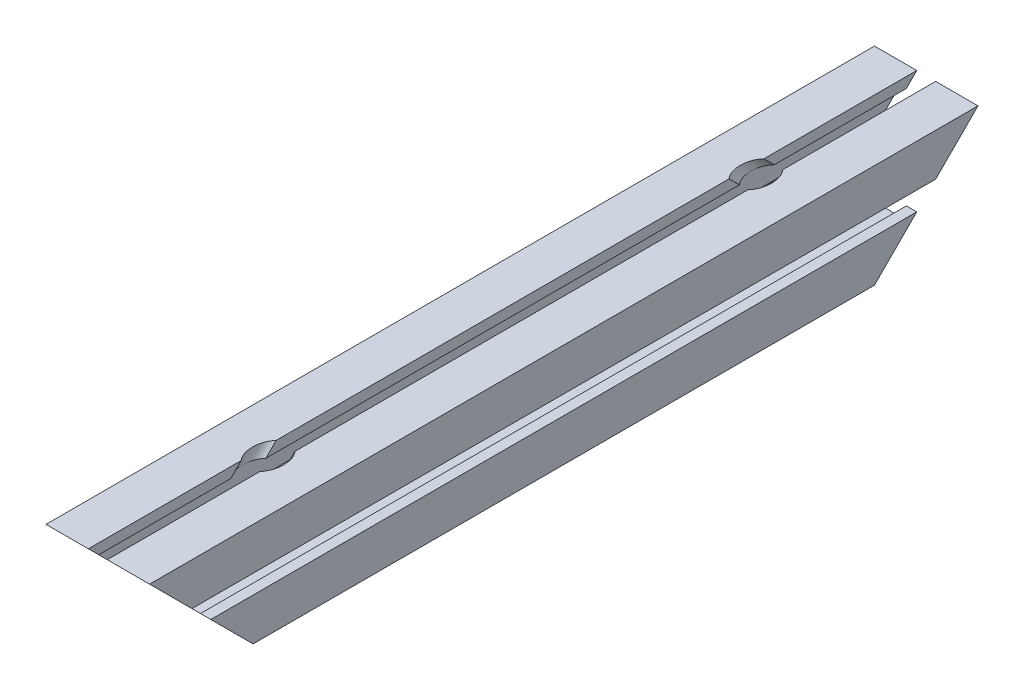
ISO-10303-21;
HEADER;
FILE_DESCRIPTION(('STEP AP214'),'2;1');
FILE_NAME('part.step','',(''),(''),'','','');
FILE_SCHEMA(('AUTOMOTIVE_DESIGN { 1 0 10303 214 1 1 1 1 }'));
ENDSEC;
DATA;
#1=APPLICATION_CONTEXT('core data for automotive mechanical design processes');
#2=APPLICATION_PROTOCOL_DEFINITION('international standard','automotive_design',2000,#1);
#3=PRODUCT_CONTEXT('',#1,'mechanical');
#4=PRODUCT('Part','Part','',(#3));
#5=PRODUCT_RELATED_PRODUCT_CATEGORY('part','',(#4));
#6=PRODUCT_DEFINITION_FORMATION('','',#4);
#7=PRODUCT_DEFINITION_CONTEXT('part definition',#1,'design');
#8=PRODUCT_DEFINITION('design','',#6,#7);
#9=PRODUCT_DEFINITION_SHAPE('','',#8);
#10=(LENGTH_UNIT() NAMED_UNIT(*) SI_UNIT(.MILLI.,.METRE.));
#11=(NAMED_UNIT(*) PLANE_ANGLE_UNIT() SI_UNIT($,.RADIAN.));
#12=(NAMED_UNIT(*) SI_UNIT($,.STERADIAN.) SOLID_ANGLE_UNIT());
#13=UNCERTAINTY_MEASURE_WITH_UNIT(LENGTH_MEASURE(1.E-05),#10,'distance_accuracy_value','');
#14=(GEOMETRIC_REPRESENTATION_CONTEXT(3) GLOBAL_UNCERTAINTY_ASSIGNED_CONTEXT((#13)) GLOBAL_UNIT_ASSIGNED_CONTEXT((#10,
#11,#12)) REPRESENTATION_CONTEXT('',''));
#15=CARTESIAN_POINT('',(0.,0.,0.));
#16=DIRECTION('',(0.,0.,1.));
#17=DIRECTION('',(1.,0.,0.));
#18=AXIS2_PLACEMENT_3D('',#15,#16,#17);
#19=CARTESIAN_POINT('',(0.,0.,-180.));
#20=DIRECTION('',(0.,0.,1.));
#21=DIRECTION('',(1.,0.,0.));
#22=AXIS2_PLACEMENT_3D('',#19,#20,#21);
#23=CYLINDRICAL_SURFACE('',#22,3.75000000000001);
#24=CARTESIAN_POINT('',(3.75000000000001,0.,120.565435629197));
#25=CARTESIAN_POINT('',(3.75000402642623,0.152668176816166,120.41276886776));
#26=CARTESIAN_POINT('',(3.74071729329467,0.300920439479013,120.255702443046));
#27=CARTESIAN_POINT('',(3.70630569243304,0.588938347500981,119.93550637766));
#28=CARTESIAN_POINT('',(3.68116527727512,0.728695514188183,119.77237093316));
#29=CARTESIAN_POINT('',(3.61664033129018,1.00105415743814,119.441376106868));
#30=CARTESIAN_POINT('',(3.57717285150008,1.133608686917,119.273494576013));
#31=CARTESIAN_POINT('',(3.48503680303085,1.39130612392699,118.93581766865));
#32=CARTESIAN_POINT('',(3.43237308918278,1.51645173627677,118.766023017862));
#33=CARTESIAN_POINT('',(3.31118773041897,1.76599146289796,118.417602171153));
#34=CARTESIAN_POINT('',(3.24200793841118,1.89003899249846,118.238956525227));
#35=CARTESIAN_POINT('',(3.08893916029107,2.13104405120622,117.883008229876));
#36=CARTESIAN_POINT('',(3.00504245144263,2.24799781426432,117.7057063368));
#37=CARTESIAN_POINT('',(2.82185689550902,2.47399801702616,117.355758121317));
#38=CARTESIAN_POINT('',(2.7226621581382,2.58308718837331,117.18309044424));
#39=CARTESIAN_POINT('',(2.50647568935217,2.79335376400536,116.84436385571));
#40=CARTESIAN_POINT('',(2.38950653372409,2.89454096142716,116.678296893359));
#41=CARTESIAN_POINT('',(2.17108299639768,3.05971452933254,116.403265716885));
#42=CARTESIAN_POINT('',(2.07482188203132,3.12603824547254,116.29160020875));
#43=CARTESIAN_POINT('',(1.86981538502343,3.25282034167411,116.076232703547));
#44=CARTESIAN_POINT('',(1.76105589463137,3.31327194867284,115.972539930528));
#45=CARTESIAN_POINT('',(1.52825622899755,3.42693783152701,115.776127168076));
#46=CARTESIAN_POINT('',(1.40407504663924,3.48007428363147,115.683526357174));
#47=CARTESIAN_POINT('',(1.14000710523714,3.57525325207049,115.516717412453));
#48=CARTESIAN_POINT('',(1.00016249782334,3.61732456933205,115.442461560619));
#49=CARTESIAN_POINT('',(0.752910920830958,3.67507459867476,115.340172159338));
#50=CARTESIAN_POINT('',(0.64947404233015,3.69489054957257,115.304951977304));
#51=CARTESIAN_POINT('',(0.437383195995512,3.72594103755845,115.249685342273));
#52=CARTESIAN_POINT('',(0.32873563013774,3.73718583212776,115.22962075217));
#53=CARTESIAN_POINT('',(0.108434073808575,3.75006218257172,115.206640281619));
#54=CARTESIAN_POINT('',(-0.00323285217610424,3.75164219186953,115.203816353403));
#55=CARTESIAN_POINT('',(-0.225311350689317,3.74487483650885,115.215898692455));
#56=CARTESIAN_POINT('',(-0.335722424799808,3.73652366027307,115.230811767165));
#57=CARTESIAN_POINT('',(-0.545199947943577,3.71156451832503,115.275284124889));
#58=CARTESIAN_POINT('',(-0.644544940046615,3.69550216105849,115.303875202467));
#59=CARTESIAN_POINT('',(-0.837553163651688,3.65659857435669,115.372923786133));
#60=CARTESIAN_POINT('',(-0.931214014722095,3.63375452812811,115.413386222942));
#61=CARTESIAN_POINT('',(-1.17248051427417,3.56544077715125,115.533942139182));
#62=CARTESIAN_POINT('',(-1.31444950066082,3.51503720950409,115.622478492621));
#63=CARTESIAN_POINT('',(-1.58123431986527,3.40341752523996,115.816925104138));
#64=CARTESIAN_POINT('',(-1.70599428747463,3.34216760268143,115.922889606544));
#65=CARTESIAN_POINT('',(-1.92700511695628,3.21920061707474,116.133543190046));
#66=CARTESIAN_POINT('',(-2.02488422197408,3.15831009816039,116.237036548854));
#67=CARTESIAN_POINT('',(-2.21011747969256,3.03158171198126,116.450309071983));
#68=CARTESIAN_POINT('',(-2.29746312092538,2.9657399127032,116.56009321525));
#69=CARTESIAN_POINT('',(-2.46301297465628,2.82976415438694,116.784291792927));
#70=CARTESIAN_POINT('',(-2.54119357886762,2.75961979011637,116.898717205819));
#71=CARTESIAN_POINT('',(-2.68916417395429,2.61563441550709,117.13064876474));
#72=CARTESIAN_POINT('',(-2.758951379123,2.54179218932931,117.248155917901));
#73=CARTESIAN_POINT('',(-2.93645302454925,2.33849710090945,117.567114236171));
#74=CARTESIAN_POINT('',(-3.03707970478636,2.20585445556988,117.770498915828));
#75=CARTESIAN_POINT('',(-3.21880342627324,1.93104368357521,118.179712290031));
#76=CARTESIAN_POINT('',(-3.29988416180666,1.78886772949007,118.385542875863));
#77=CARTESIAN_POINT('',(-3.44310034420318,1.49475222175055,118.79643637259));
#78=CARTESIAN_POINT('',(-3.50525780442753,1.34282426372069,119.001499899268));
#79=CARTESIAN_POINT('',(-3.61010994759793,1.02815480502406,119.408132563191));
#80=CARTESIAN_POINT('',(-3.65282129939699,0.865422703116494,119.609704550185));
#81=CARTESIAN_POINT('',(-3.70277208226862,0.601157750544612,119.920000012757));
#82=CARTESIAN_POINT('',(-3.71736140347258,0.503715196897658,120.031053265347));
#83=CARTESIAN_POINT('',(-3.73893462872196,0.304770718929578,120.250209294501));
#84=CARTESIAN_POINT('',(-3.74592061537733,0.203269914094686,120.358312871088));
#85=CARTESIAN_POINT('',(-3.75142455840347,-0.00373199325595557,120.570512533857));
#86=CARTESIAN_POINT('',(-3.74995698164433,-0.109225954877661,120.674615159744));
#87=CARTESIAN_POINT('',(-3.73750322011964,-0.32429420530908,120.877941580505));
#88=CARTESIAN_POINT('',(-3.72651924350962,-0.433867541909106,120.977166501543));
#89=CARTESIAN_POINT('',(-3.69730589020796,-0.632628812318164,121.14874754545));
#90=CARTESIAN_POINT('',(-3.68115390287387,-0.721107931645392,121.222278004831));
#91=CARTESIAN_POINT('',(-3.64156510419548,-0.899936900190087,121.364957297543));
#92=CARTESIAN_POINT('',(-3.61813037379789,-0.990286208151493,121.434107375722));
#93=CARTESIAN_POINT('',(-3.56333744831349,-1.17224007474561,121.567380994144));
#94=CARTESIAN_POINT('',(-3.53198274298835,-1.26384406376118,121.631506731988));
#95=CARTESIAN_POINT('',(-3.46077026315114,-1.44750346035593,121.754181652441));
#96=CARTESIAN_POINT('',(-3.42091256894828,-1.53955886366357,121.812730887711));
#97=CARTESIAN_POINT('',(-3.33182442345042,-1.72395826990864,121.924344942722));
#98=CARTESIAN_POINT('',(-3.28250387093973,-1.81629588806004,121.97734878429));
#99=CARTESIAN_POINT('',(-3.1745466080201,-1.99900214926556,122.076903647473));
#100=CARTESIAN_POINT('',(-3.11590972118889,-2.08937075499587,122.123454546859));
#101=CARTESIAN_POINT('',(-2.98940701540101,-2.26667189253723,122.210042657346));
#102=CARTESIAN_POINT('',(-2.92154356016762,-2.3536052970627,122.25008153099));
#103=CARTESIAN_POINT('',(-2.77692587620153,-2.52260697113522,122.32385571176));
#104=CARTESIAN_POINT('',(-2.70017278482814,-2.60467586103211,122.357591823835));
#105=CARTESIAN_POINT('',(-2.55049854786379,-2.75076385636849,122.414558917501));
#106=CARTESIAN_POINT('',(-2.47872459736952,-2.81564557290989,122.438606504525));
#107=CARTESIAN_POINT('',(-2.32962211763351,-2.94020378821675,122.482790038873));
#108=CARTESIAN_POINT('',(-2.25229179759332,-2.9998785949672,122.502924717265));
#109=CARTESIAN_POINT('',(-2.092670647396,-3.11332853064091,122.539638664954));
#110=CARTESIAN_POINT('',(-2.01038167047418,-3.16710584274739,122.556219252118));
#111=CARTESIAN_POINT('',(-1.84137388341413,-3.26826354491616,122.586224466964));
#112=CARTESIAN_POINT('',(-1.754653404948,-3.31564150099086,122.599647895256));
#113=CARTESIAN_POINT('',(-1.57813149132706,-3.4031787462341,122.623603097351));
#114=CARTESIAN_POINT('',(-1.48836017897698,-3.44339264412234,122.634157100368));
#115=CARTESIAN_POINT('',(-1.305706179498,-3.51672180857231,122.652835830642));
#116=CARTESIAN_POINT('',(-1.2128223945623,-3.54983453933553,122.660959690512));
#117=CARTESIAN_POINT('',(-0.930527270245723,-3.63804992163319,122.682104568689));
#118=CARTESIAN_POINT('',(-0.73729912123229,-3.6821155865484,122.691920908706));
#119=CARTESIAN_POINT('',(-0.339919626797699,-3.74012383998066,122.704689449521));
#120=CARTESIAN_POINT('',(-0.135615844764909,-3.75307612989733,122.707416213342));
#121=CARTESIAN_POINT('',(0.170198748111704,-3.74752996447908,122.706214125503));
#122=CARTESIAN_POINT('',(0.272090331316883,-3.74150781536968,122.704929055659));
#123=CARTESIAN_POINT('',(0.474995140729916,-3.72119030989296,122.700521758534));
#124=CARTESIAN_POINT('',(0.576008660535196,-3.70689783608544,122.697400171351));
#125=CARTESIAN_POINT('',(0.777513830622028,-3.6699563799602,122.68915059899));
#126=CARTESIAN_POINT('',(0.877988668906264,-3.64722063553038,122.684001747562));
#127=CARTESIAN_POINT('',(1.07656589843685,-3.59361608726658,122.67149063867));
#128=CARTESIAN_POINT('',(1.17466916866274,-3.56275034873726,122.664129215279));
#129=CARTESIAN_POINT('',(1.36785728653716,-3.49313791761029,122.646908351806));
#130=CARTESIAN_POINT('',(1.46294094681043,-3.45438816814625,122.637047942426));
#131=CARTESIAN_POINT('',(1.64930115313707,-3.36939004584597,122.614491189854));
#132=CARTESIAN_POINT('',(1.74057923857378,-3.32314474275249,122.601796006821));
#133=CARTESIAN_POINT('',(1.91771085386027,-3.22413826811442,122.573330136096));
#134=CARTESIAN_POINT('',(2.00361240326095,-3.17145303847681,122.55759422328));
#135=CARTESIAN_POINT('',(2.17037559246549,-3.05974461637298,122.522560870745));
#136=CARTESIAN_POINT('',(2.25123923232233,-3.0007239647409,122.503264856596));
#137=CARTESIAN_POINT('',(2.40734277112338,-2.87699784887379,122.460705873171));
#138=CARTESIAN_POINT('',(2.48258431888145,-2.81229406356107,122.437444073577));
#139=CARTESIAN_POINT('',(2.62693945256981,-2.67794881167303,122.386575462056));
#140=CARTESIAN_POINT('',(2.696053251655,-2.60830751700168,122.358968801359));
#141=CARTESIAN_POINT('',(2.82555906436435,-2.46730156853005,122.300090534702));
#142=CARTESIAN_POINT('',(2.88616301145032,-2.39606868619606,122.268969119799));
#143=CARTESIAN_POINT('',(3.00098041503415,-2.25060133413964,122.202187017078));
#144=CARTESIAN_POINT('',(3.05519173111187,-2.1763658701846,122.166524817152));
#145=CARTESIAN_POINT('',(3.15703463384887,-2.02580542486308,122.090613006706));
#146=CARTESIAN_POINT('',(3.20466866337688,-1.94948123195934,122.050365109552));
#147=CARTESIAN_POINT('',(3.29338908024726,-1.79554821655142,121.965334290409));
#148=CARTESIAN_POINT('',(3.33447301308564,-1.71793892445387,121.92054967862));
#149=CARTESIAN_POINT('',(3.44863474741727,-1.48317284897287,121.778881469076));
#150=CARTESIAN_POINT('',(3.51188166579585,-1.32519848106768,121.675239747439));
#151=CARTESIAN_POINT('',(3.61449213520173,-1.01249194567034,121.45272595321));
#152=CARTESIAN_POINT('',(3.65384665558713,-0.857761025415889,121.333848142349));
#153=CARTESIAN_POINT('',(3.7063330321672,-0.583995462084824,121.108424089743));
#154=CARTESIAN_POINT('',(3.72307852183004,-0.463876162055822,121.00398312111));
#155=CARTESIAN_POINT('',(3.74490640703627,-0.228367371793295,120.788973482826));
#156=CARTESIAN_POINT('',(3.74999702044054,-0.112974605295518,120.67840918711));
#157=CARTESIAN_POINT('',(3.75000000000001,0.,120.565435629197));
#158=B_SPLINE_CURVE_WITH_KNOTS('',3,(#24,#25,#26,#27,#28,#29,#30,#31,#32,#33,#34,#35,#36,#37,
#38,#39,#40,#41,#42,#43,#44,#45,#46,#47,#48,#49,#50,#51,#52,#53,#54,#55,#56,#57,#58,#59,#60,#61,
#62,#63,#64,#65,#66,#67,#68,#69,#70,#71,#72,#73,#74,#75,#76,#77,#78,#79,#80,#81,#82,#83,#84,#85,
#86,#87,#88,#89,#90,#91,#92,#93,#94,#95,#96,#97,#98,#99,#100,#101,#102,#103,#104,#105,#106,#107,
#108,#109,#110,#111,#112,#113,#114,#115,#116,#117,#118,#119,#120,#121,#122,#123,#124,#125,#126,
#127,#128,#129,#130,#131,#132,#133,#134,#135,#136,#137,#138,#139,#140,#141,#142,#143,#144,#145,
#146,#147,#148,#149,#150,#151,#152,#153,#154,#155,#156,#157),.UNSPECIFIED.,.T.,.F.,(4,2,2,2,2,2,
2,2,2,2,2,2,2,2,2,2,2,2,2,2,2,2,2,2,2,2,2,2,2,2,2,2,2,2,2,2,2,2,2,2,2,2,2,2,2,2,2,2,2,2,2,2,2,2,
2,2,2,2,2,2,2,2,2,2,2,2,4),(0.,0.647509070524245,1.29565413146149,1.94761320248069,
2.59933277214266,3.28344845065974,3.96792420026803,4.64834584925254,5.32791038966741,
5.81229024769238,6.29722232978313,6.78696957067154,7.27542916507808,7.60732481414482,
7.93882264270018,8.27208696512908,8.60547923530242,8.91814430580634,9.23093942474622,
9.75214469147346,10.2750039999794,10.7390858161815,11.203540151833,11.669165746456,
12.134945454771,12.9223672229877,13.7104436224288,14.4975997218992,15.2840798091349,
15.7292353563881,16.1742689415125,16.6185411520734,17.0627103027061,17.4109420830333,
17.759074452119,18.107053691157,18.4550296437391,18.8064999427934,19.1579768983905,
19.5093639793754,19.8607061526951,20.1594378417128,20.4582662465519,20.7569836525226,
21.0558143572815,21.3522594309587,21.648810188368,22.2413355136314,22.852483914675,
23.1584211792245,23.4642518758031,23.773316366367,24.0822644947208,24.3913326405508,
24.7002745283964,25.0058725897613,25.3113485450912,25.6167345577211,25.9221099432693,
26.2174533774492,26.5128954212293,26.8082274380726,27.103669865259,27.6988654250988,
28.2942858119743,28.7737813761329,29.2529387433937),.UNSPECIFIED.);
#159=CARTESIAN_POINT('',(3.75000000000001,0.,120.565435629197));
#160=VERTEX_POINT('',#159);
#161=EDGE_CURVE('E454',#160,#160,#158,.T.);
#162=ORIENTED_EDGE('',*,*,#161,.T.);
#163=EDGE_LOOP('',(#162));
#164=FACE_BOUND('',#163,.T.);
#165=CARTESIAN_POINT('',(3.75000000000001,0.,-120.565435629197));
#166=CARTESIAN_POINT('',(3.75000402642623,0.152668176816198,-120.41276886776));
#167=CARTESIAN_POINT('',(3.74071729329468,0.300920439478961,-120.255702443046));
#168=CARTESIAN_POINT('',(3.70630569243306,0.588938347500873,-119.93550637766));
#169=CARTESIAN_POINT('',(3.68116527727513,0.728695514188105,-119.77237093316));
#170=CARTESIAN_POINT('',(3.61664033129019,1.0010541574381,-119.441376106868));
#171=CARTESIAN_POINT('',(3.57717285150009,1.13360868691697,-119.273494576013));
#172=CARTESIAN_POINT('',(3.48503680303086,1.39130612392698,-118.93581766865));
#173=CARTESIAN_POINT('',(3.43237308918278,1.51645173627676,-118.766023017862));
#174=CARTESIAN_POINT('',(3.31118773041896,1.76599146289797,-118.417602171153));
#175=CARTESIAN_POINT('',(3.24200793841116,1.89003899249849,-118.238956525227));
#176=CARTESIAN_POINT('',(3.08893916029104,2.13104405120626,-117.883008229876));
#177=CARTESIAN_POINT('',(3.00504245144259,2.24799781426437,-117.7057063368));
#178=CARTESIAN_POINT('',(2.82185689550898,2.4739980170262,-117.355758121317));
#179=CARTESIAN_POINT('',(2.72266215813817,2.58308718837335,-117.18309044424));
#180=CARTESIAN_POINT('',(2.50647568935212,2.7933537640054,-116.84436385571));
#181=CARTESIAN_POINT('',(2.38950653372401,2.89454096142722,-116.678296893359));
#182=CARTESIAN_POINT('',(2.17108299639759,3.05971452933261,-116.403265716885));
#183=CARTESIAN_POINT('',(2.07482188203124,3.1260382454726,-116.29160020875));
#184=CARTESIAN_POINT('',(1.86981538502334,3.25282034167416,-116.076232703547));
#185=CARTESIAN_POINT('',(1.76105589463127,3.3132719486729,-115.972539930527));
#186=CARTESIAN_POINT('',(1.52825622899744,3.42693783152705,-115.776127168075));
#187=CARTESIAN_POINT('',(1.40407504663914,3.48007428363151,-115.683526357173));
#188=CARTESIAN_POINT('',(1.14000710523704,3.57525325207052,-115.516717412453));
#189=CARTESIAN_POINT('',(1.00016249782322,3.61732456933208,-115.442461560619));
#190=CARTESIAN_POINT('',(0.752910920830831,3.67507459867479,-115.340172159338));
#191=CARTESIAN_POINT('',(0.649474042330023,3.69489054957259,-115.304951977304));
#192=CARTESIAN_POINT('',(0.437383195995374,3.72594103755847,-115.249685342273));
#193=CARTESIAN_POINT('',(0.328735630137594,3.73718583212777,-115.22962075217));
#194=CARTESIAN_POINT('',(0.108434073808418,3.75006218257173,-115.206640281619));
#195=CARTESIAN_POINT('',(-0.00323285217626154,3.75164219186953,-115.203816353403));
#196=CARTESIAN_POINT('',(-0.225311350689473,3.74487483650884,-115.215898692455));
#197=CARTESIAN_POINT('',(-0.335722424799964,3.73652366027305,-115.230811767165));
#198=CARTESIAN_POINT('',(-0.545199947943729,3.71156451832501,-115.275284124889));
#199=CARTESIAN_POINT('',(-0.644544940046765,3.69550216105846,-115.303875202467));
#200=CARTESIAN_POINT('',(-0.837553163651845,3.65659857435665,-115.372923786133));
#201=CARTESIAN_POINT('',(-0.931214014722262,3.63375452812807,-115.413386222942));
#202=CARTESIAN_POINT('',(-1.17248051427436,3.56544077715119,-115.533942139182));
#203=CARTESIAN_POINT('',(-1.31444950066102,3.51503720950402,-115.622478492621));
#204=CARTESIAN_POINT('',(-1.58123431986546,3.40341752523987,-115.816925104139));
#205=CARTESIAN_POINT('',(-1.70599428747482,3.34216760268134,-115.922889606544));
#206=CARTESIAN_POINT('',(-1.92700511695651,3.21920061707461,-116.133543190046));
#207=CARTESIAN_POINT('',(-2.02488422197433,3.15831009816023,-116.237036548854));
#208=CARTESIAN_POINT('',(-2.21011747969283,3.03158171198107,-116.450309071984));
#209=CARTESIAN_POINT('',(-2.29746312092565,2.96573991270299,-116.560093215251));
#210=CARTESIAN_POINT('',(-2.46301297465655,2.8297641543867,-116.784291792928));
#211=CARTESIAN_POINT('',(-2.54119357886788,2.75961979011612,-116.898717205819));
#212=CARTESIAN_POINT('',(-2.68916417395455,2.61563441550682,-117.13064876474));
#213=CARTESIAN_POINT('',(-2.75895137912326,2.54179218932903,-117.248155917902));
#214=CARTESIAN_POINT('',(-2.93645302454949,2.33849710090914,-117.567114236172));
#215=CARTESIAN_POINT('',(-3.0370797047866,2.20585445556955,-117.770498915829));
#216=CARTESIAN_POINT('',(-3.21880342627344,1.93104368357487,-118.179712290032));
#217=CARTESIAN_POINT('',(-3.29988416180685,1.78886772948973,-118.385542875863));
#218=CARTESIAN_POINT('',(-3.44310034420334,1.49475222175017,-118.796436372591));
#219=CARTESIAN_POINT('',(-3.50525780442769,1.34282426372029,-119.001499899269));
#220=CARTESIAN_POINT('',(-3.61010994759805,1.02815480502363,-119.408132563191));
#221=CARTESIAN_POINT('',(-3.65282129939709,0.865422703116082,-119.609704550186));
#222=CARTESIAN_POINT('',(-3.70277208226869,0.60115775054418,-119.920000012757));
#223=CARTESIAN_POINT('',(-3.71736140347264,0.503715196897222,-120.031053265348));
#224=CARTESIAN_POINT('',(-3.738934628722,0.304770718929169,-120.250209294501));
#225=CARTESIAN_POINT('',(-3.74592061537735,0.203269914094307,-120.358312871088));
#226=CARTESIAN_POINT('',(-3.75142455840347,-0.00373199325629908,-120.570512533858));
#227=CARTESIAN_POINT('',(-3.74995698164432,-0.109225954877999,-120.674615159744));
#228=CARTESIAN_POINT('',(-3.73750322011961,-0.324294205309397,-120.877941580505));
#229=CARTESIAN_POINT('',(-3.72651924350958,-0.433867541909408,-120.977166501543));
#230=CARTESIAN_POINT('',(-3.69730589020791,-0.632628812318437,-121.14874754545));
#231=CARTESIAN_POINT('',(-3.68115390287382,-0.721107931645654,-121.222278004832));
#232=CARTESIAN_POINT('',(-3.64156510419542,-0.899936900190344,-121.364957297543));
#233=CARTESIAN_POINT('',(-3.61813037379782,-0.990286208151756,-121.434107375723));
#234=CARTESIAN_POINT('',(-3.5633374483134,-1.17224007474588,-121.567380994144));
#235=CARTESIAN_POINT('',(-3.53198274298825,-1.26384406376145,-121.631506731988));
#236=CARTESIAN_POINT('',(-3.46077026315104,-1.44750346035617,-121.754181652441));
#237=CARTESIAN_POINT('',(-3.42091256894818,-1.53955886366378,-121.812730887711));
#238=CARTESIAN_POINT('',(-3.33182442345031,-1.72395826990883,-121.924344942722));
#239=CARTESIAN_POINT('',(-3.28250387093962,-1.81629588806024,-121.97734878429));
#240=CARTESIAN_POINT('',(-3.17454660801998,-1.99900214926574,-122.076903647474));
#241=CARTESIAN_POINT('',(-3.11590972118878,-2.08937075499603,-122.123454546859));
#242=CARTESIAN_POINT('',(-2.98940701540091,-2.26667189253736,-122.210042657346));
#243=CARTESIAN_POINT('',(-2.92154356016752,-2.35360529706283,-122.25008153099));
#244=CARTESIAN_POINT('',(-2.77692587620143,-2.52260697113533,-122.32385571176));
#245=CARTESIAN_POINT('',(-2.70017278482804,-2.60467586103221,-122.357591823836));
#246=CARTESIAN_POINT('',(-2.55049854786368,-2.75076385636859,-122.414558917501));
#247=CARTESIAN_POINT('',(-2.47872459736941,-2.81564557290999,-122.438606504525));
#248=CARTESIAN_POINT('',(-2.3296221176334,-2.94020378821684,-122.482790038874));
#249=CARTESIAN_POINT('',(-2.25229179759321,-2.99987859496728,-122.502924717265));
#250=CARTESIAN_POINT('',(-2.0926706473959,-3.11332853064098,-122.539638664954));
#251=CARTESIAN_POINT('',(-2.01038167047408,-3.16710584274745,-122.556219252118));
#252=CARTESIAN_POINT('',(-1.84137388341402,-3.26826354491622,-122.586224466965));
#253=CARTESIAN_POINT('',(-1.75465340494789,-3.31564150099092,-122.599647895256));
#254=CARTESIAN_POINT('',(-1.57813149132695,-3.40317874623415,-122.623603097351));
#255=CARTESIAN_POINT('',(-1.48836017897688,-3.44339264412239,-122.634157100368));
#256=CARTESIAN_POINT('',(-1.30570617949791,-3.51672180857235,-122.652835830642));
#257=CARTESIAN_POINT('',(-1.2128223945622,-3.54983453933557,-122.660959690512));
#258=CARTESIAN_POINT('',(-0.930527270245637,-3.63804992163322,-122.682104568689));
#259=CARTESIAN_POINT('',(-0.737299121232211,-3.68211558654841,-122.691920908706));
#260=CARTESIAN_POINT('',(-0.339919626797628,-3.74012383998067,-122.704689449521));
#261=CARTESIAN_POINT('',(-0.135615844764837,-3.75307612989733,-122.707416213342));
#262=CARTESIAN_POINT('',(0.170198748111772,-3.74752996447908,-122.706214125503));
#263=CARTESIAN_POINT('',(0.27209033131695,-3.74150781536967,-122.704929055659));
#264=CARTESIAN_POINT('',(0.474995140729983,-3.72119030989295,-122.700521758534));
#265=CARTESIAN_POINT('',(0.576008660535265,-3.70689783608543,-122.697400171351));
#266=CARTESIAN_POINT('',(0.777513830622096,-3.66995637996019,-122.68915059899));
#267=CARTESIAN_POINT('',(0.877988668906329,-3.64722063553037,-122.684001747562));
#268=CARTESIAN_POINT('',(1.07656589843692,-3.59361608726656,-122.67149063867));
#269=CARTESIAN_POINT('',(1.17466916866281,-3.56275034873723,-122.66412921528));
#270=CARTESIAN_POINT('',(1.36785728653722,-3.49313791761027,-122.646908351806));
#271=CARTESIAN_POINT('',(1.46294094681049,-3.45438816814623,-122.637047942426));
#272=CARTESIAN_POINT('',(1.64930115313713,-3.36939004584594,-122.614491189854));
#273=CARTESIAN_POINT('',(1.74057923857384,-3.32314474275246,-122.601796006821));
#274=CARTESIAN_POINT('',(1.91771085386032,-3.22413826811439,-122.573330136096));
#275=CARTESIAN_POINT('',(2.00361240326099,-3.17145303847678,-122.55759422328));
#276=CARTESIAN_POINT('',(2.17037559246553,-3.05974461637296,-122.522560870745));
#277=CARTESIAN_POINT('',(2.25123923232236,-3.00072396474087,-122.503264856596));
#278=CARTESIAN_POINT('',(2.40734277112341,-2.87699784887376,-122.460705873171));
#279=CARTESIAN_POINT('',(2.48258431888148,-2.81229406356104,-122.437444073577));
#280=CARTESIAN_POINT('',(2.62693945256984,-2.677948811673,-122.386575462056));
#281=CARTESIAN_POINT('',(2.69605325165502,-2.60830751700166,-122.358968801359));
#282=CARTESIAN_POINT('',(2.82555906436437,-2.46730156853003,-122.300090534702));
#283=CARTESIAN_POINT('',(2.88616301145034,-2.39606868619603,-122.268969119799));
#284=CARTESIAN_POINT('',(3.00098041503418,-2.2506013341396,-122.202187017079));
#285=CARTESIAN_POINT('',(3.0551917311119,-2.17636587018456,-122.166524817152));
#286=CARTESIAN_POINT('',(3.1570346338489,-2.02580542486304,-122.090613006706));
#287=CARTESIAN_POINT('',(3.2046686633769,-1.94948123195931,-122.050365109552));
#288=CARTESIAN_POINT('',(3.29338908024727,-1.7955482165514,-121.965334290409));
#289=CARTESIAN_POINT('',(3.33447301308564,-1.71793892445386,-121.92054967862));
#290=CARTESIAN_POINT('',(3.44863474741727,-1.48317284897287,-121.778881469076));
#291=CARTESIAN_POINT('',(3.51188166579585,-1.32519848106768,-121.675239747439));
#292=CARTESIAN_POINT('',(3.61449213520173,-1.01249194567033,-121.45272595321));
#293=CARTESIAN_POINT('',(3.65384665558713,-0.857761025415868,-121.333848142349));
#294=CARTESIAN_POINT('',(3.7063330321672,-0.583995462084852,-121.108424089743));
#295=CARTESIAN_POINT('',(3.72307852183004,-0.463876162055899,-121.00398312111));
#296=CARTESIAN_POINT('',(3.74490640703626,-0.228367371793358,-120.788973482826));
#297=CARTESIAN_POINT('',(3.74999702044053,-0.112974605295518,-120.678409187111));
#298=CARTESIAN_POINT('',(3.75000000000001,0.,-120.565435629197));
#299=B_SPLINE_CURVE_WITH_KNOTS('',3,(#165,#166,#167,#168,#169,#170,#171,#172,#173,#174,#175,
#176,#177,#178,#179,#180,#181,#182,#183,#184,#185,#186,#187,#188,#189,#190,#191,#192,#193,#194,
#195,#196,#197,#198,#199,#200,#201,#202,#203,#204,#205,#206,#207,#208,#209,#210,#211,#212,#213,
#214,#215,#216,#217,#218,#219,#220,#221,#222,#223,#224,#225,#226,#227,#228,#229,#230,#231,#232,
#233,#234,#235,#236,#237,#238,#239,#240,#241,#242,#243,#244,#245,#246,#247,#248,#249,#250,#251,
#252,#253,#254,#255,#256,#257,#258,#259,#260,#261,#262,#263,#264,#265,#266,#267,#268,#269,#270,
#271,#272,#273,#274,#275,#276,#277,#278,#279,#280,#281,#282,#283,#284,#285,#286,#287,#288,#289,
#290,#291,#292,#293,#294,#295,#296,#297,#298),.UNSPECIFIED.,.T.,.F.,(4,2,2,2,2,2,2,2,2,2,2,2,2,
2,2,2,2,2,2,2,2,2,2,2,2,2,2,2,2,2,2,2,2,2,2,2,2,2,2,2,2,2,2,2,2,2,2,2,2,2,2,2,2,2,2,2,2,2,2,2,2,
2,2,2,2,2,4),(0.,0.647509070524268,1.29565413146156,1.94761320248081,2.59933277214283,
3.28344845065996,3.96792420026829,4.64834584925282,5.32791038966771,5.81229024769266,
6.29722232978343,6.78696957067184,7.27542916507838,7.60732481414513,7.93882264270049,
8.2720869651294,8.60547923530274,8.91814430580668,9.23093942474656,9.75214469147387,
10.2750039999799,10.7390858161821,11.2035401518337,11.6691657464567,12.1349454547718,
12.9223672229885,13.7104436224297,14.4975997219,15.2840798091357,15.7292353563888,
16.1742689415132,16.618541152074,17.0627103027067,17.4109420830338,17.7590744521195,
18.1070536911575,18.4550296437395,18.8064999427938,19.1579768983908,19.5093639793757,
19.8607061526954,20.1594378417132,20.4582662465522,20.7569836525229,21.0558143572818,
21.3522594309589,21.6488101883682,22.2413355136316,22.8524839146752,23.1584211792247,
23.4642518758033,23.7733163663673,24.082264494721,24.391332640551,24.7002745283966,
25.0058725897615,25.3113485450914,25.6167345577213,25.9221099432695,26.2174533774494,
26.5128954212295,26.8082274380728,27.1036698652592,27.6988654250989,28.2942858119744,
28.773781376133,29.2529387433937),.UNSPECIFIED.);
#300=CARTESIAN_POINT('',(3.75000000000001,0.,-120.565435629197));
#301=VERTEX_POINT('',#300);
#302=EDGE_CURVE('E417',#301,#301,#299,.T.);
#303=ORIENTED_EDGE('',*,*,#302,.F.);
#304=EDGE_LOOP('',(#303));
#305=FACE_BOUND('',#304,.T.);
#306=ADVANCED_FACE('F30',(#164,#305),#23,.F.);
#307=CARTESIAN_POINT('',(4.50000000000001,7.2,-180.));
#308=DIRECTION('',(0.,1.,0.));
#309=DIRECTION('',(-1.,0.,0.));
#310=AXIS2_PLACEMENT_3D('',#307,#308,#309);
#311=PLANE('',#310);
#312=DIRECTION('',(0.,0.,1.));
#313=VECTOR('',#312,1.);
#314=CARTESIAN_POINT('',(4.50000000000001,7.2,-180.));
#315=LINE('',#314,#313);
#316=CARTESIAN_POINT('',(4.50000000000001,7.2,-114.187564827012));
#317=VERTEX_POINT('',#316);
#318=CARTESIAN_POINT('',(4.50000000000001,7.2,114.187564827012));
#319=VERTEX_POINT('',#318);
#320=EDGE_CURVE('E797',#317,#319,#315,.T.);
#321=ORIENTED_EDGE('',*,*,#320,.F.);
#322=CARTESIAN_POINT('',(0.,7.20000000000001,-121.302689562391));
#323=DIRECTION('',(0.,1.,0.));
#324=DIRECTION('',(0.,0.,-1.));
#325=AXIS2_PLACEMENT_3D('',#322,#323,#324);
#326=ELLIPSE('',#325,9.54594154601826,6.75);
#327=CARTESIAN_POINT('',(-4.49999999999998,7.20000000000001,-114.187564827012));
#328=VERTEX_POINT('',#327);
#329=EDGE_CURVE('E915',#317,#328,#326,.F.);
#330=ORIENTED_EDGE('',*,*,#329,.T.);
#331=DIRECTION('',(0.,0.,1.));
#332=VECTOR('',#331,1.);
#333=CARTESIAN_POINT('',(-4.49999999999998,7.20000000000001,-180.));
#334=LINE('',#333,#332);
#335=CARTESIAN_POINT('',(-4.49999999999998,7.20000000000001,114.187564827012));
#336=VERTEX_POINT('',#335);
#337=EDGE_CURVE('E792',#328,#336,#334,.T.);
#338=ORIENTED_EDGE('',*,*,#337,.T.);
#339=CARTESIAN_POINT('',(0.,7.20000000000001,121.302689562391));
#340=DIRECTION('',(0.,1.,0.));
#341=DIRECTION('',(0.,0.,1.));
#342=AXIS2_PLACEMENT_3D('',#339,#340,#341);
#343=ELLIPSE('',#342,9.54594154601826,6.75);
#344=EDGE_CURVE('E894',#319,#336,#343,.T.);
#345=ORIENTED_EDGE('',*,*,#344,.F.);
#346=EDGE_LOOP('',(#321,#330,#338,#345));
#347=FACE_BOUND('',#346,.T.);
#348=ADVANCED_FACE('F914',(#347),#311,.T.);
#349=CARTESIAN_POINT('',(-4.49999999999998,7.20000000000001,-164.7));
#350=VERTEX_POINT('',#349);
#351=CARTESIAN_POINT('',(-4.49999999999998,7.20000000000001,-128.41781429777));
#352=VERTEX_POINT('',#351);
#353=EDGE_CURVE('E789',#350,#352,#334,.T.);
#354=ORIENTED_EDGE('',*,*,#353,.T.);
#355=CARTESIAN_POINT('',(4.50000000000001,7.2,-128.41781429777));
#356=VERTEX_POINT('',#355);
#357=EDGE_CURVE('E406',#352,#356,#326,.F.);
#358=ORIENTED_EDGE('',*,*,#357,.T.);
#359=CARTESIAN_POINT('',(4.50000000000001,7.20000000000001,-164.7));
#360=VERTEX_POINT('',#359);
#361=EDGE_CURVE('E794',#360,#356,#315,.T.);
#362=ORIENTED_EDGE('',*,*,#361,.F.);
#363=DIRECTION('',(-1.,0.,0.));
#364=VECTOR('',#363,1.);
#365=CARTESIAN_POINT('',(4.49999999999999,7.2,-164.7));
#366=LINE('',#365,#364);
#367=EDGE_CURVE('E594',#360,#350,#366,.T.);
#368=ORIENTED_EDGE('',*,*,#367,.T.);
#369=EDGE_LOOP('',(#354,#358,#362,#368));
#370=FACE_BOUND('',#369,.T.);
#371=ADVANCED_FACE('F924',(#370),#311,.T.);
#372=CARTESIAN_POINT('',(4.10000000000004,22.5,-180.));
#373=DIRECTION('',(-1.,0.,0.));
#374=DIRECTION('',(0.,-1.,0.));
#375=AXIS2_PLACEMENT_3D('',#372,#373,#374);
#376=PLANE('',#375);
#377=DIRECTION('',(0.,0.,1.));
#378=VECTOR('',#377,1.);
#379=CARTESIAN_POINT('',(4.10000000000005,18.,-180.));
#380=LINE('',#379,#378);
#381=CARTESIAN_POINT('',(4.10000000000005,18.,-175.5));
#382=VERTEX_POINT('',#381);
#383=CARTESIAN_POINT('',(4.09999999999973,18.,-118.085894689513));
#384=VERTEX_POINT('',#383);
#385=EDGE_CURVE('E803',#382,#384,#380,.T.);
#386=ORIENTED_EDGE('',*,*,#385,.T.);
#387=DIRECTION('',(0.,-0.707106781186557,-0.707106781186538));
#388=VECTOR('',#387,1.);
#389=CARTESIAN_POINT('',(4.09999999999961,169.292947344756,33.2070526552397));
#390=LINE('',#389,#388);
#391=CARTESIAN_POINT('',(4.10000000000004,22.5,-113.585894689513));
#392=VERTEX_POINT('',#391);
#393=EDGE_CURVE('E951',#384,#392,#390,.F.);
#394=ORIENTED_EDGE('',*,*,#393,.T.);
#395=DIRECTION('',(0.,0.,1.));
#396=VECTOR('',#395,1.);
#397=CARTESIAN_POINT('',(4.10000000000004,22.5,-180.));
#398=LINE('',#397,#396);
#399=CARTESIAN_POINT('',(4.10000000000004,22.5,-180.));
#400=VERTEX_POINT('',#399);
#401=EDGE_CURVE('E808',#400,#392,#398,.T.);
#402=ORIENTED_EDGE('',*,*,#401,.F.);
#403=DIRECTION('',(0.,-0.707106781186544,0.707106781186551));
#404=VECTOR('',#403,1.);
#405=CARTESIAN_POINT('',(4.10000000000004,22.5,-180.));
#406=LINE('',#405,#404);
#407=EDGE_CURVE('E582',#400,#382,#406,.T.);
#408=ORIENTED_EDGE('',*,*,#407,.T.);
#409=EDGE_LOOP('',(#386,#394,#402,#408));
#410=FACE_BOUND('',#409,.T.);
#411=ADVANCED_FACE('F949',(#410),#376,.T.);
#412=CARTESIAN_POINT('',(4.10000000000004,22.5,-98.41948443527));
#413=VERTEX_POINT('',#412);
#414=CARTESIAN_POINT('',(4.10000000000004,22.5,98.4194844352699));
#415=VERTEX_POINT('',#414);
#416=EDGE_CURVE('E811',#413,#415,#398,.T.);
#417=ORIENTED_EDGE('',*,*,#416,.F.);
#418=DIRECTION('',(0.,-0.707106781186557,-0.707106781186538));
#419=VECTOR('',#418,1.);
#420=CARTESIAN_POINT('',(4.09999999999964,161.709742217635,40.7902577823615));
#421=LINE('',#420,#419);
#422=CARTESIAN_POINT('',(4.09999999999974,18.,-102.91948443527));
#423=VERTEX_POINT('',#422);
#424=EDGE_CURVE('E53',#413,#423,#421,.T.);
#425=ORIENTED_EDGE('',*,*,#424,.T.);
#426=CARTESIAN_POINT('',(4.10000000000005,18.,102.91948443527));
#427=VERTEX_POINT('',#426);
#428=EDGE_CURVE('E806',#423,#427,#380,.T.);
#429=ORIENTED_EDGE('',*,*,#428,.T.);
#430=DIRECTION('',(0.,-0.707106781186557,0.707106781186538));
#431=VECTOR('',#430,1.);
#432=CARTESIAN_POINT('',(4.09999999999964,161.709742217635,-40.7902577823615));
#433=LINE('',#432,#431);
#434=EDGE_CURVE('E866',#415,#427,#433,.T.);
#435=ORIENTED_EDGE('',*,*,#434,.F.);
#436=EDGE_LOOP('',(#417,#425,#429,#435));
#437=FACE_BOUND('',#436,.T.);
#438=ADVANCED_FACE('F874',(#437),#376,.T.);
#439=CARTESIAN_POINT('',(-4.09999999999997,18.,-180.));
#440=DIRECTION('',(1.,0.,0.));
#441=DIRECTION('',(0.,1.,0.));
#442=AXIS2_PLACEMENT_3D('',#439,#440,#441);
#443=PLANE('',#442);
#444=DIRECTION('',(0.,0.,1.));
#445=VECTOR('',#444,1.);
#446=CARTESIAN_POINT('',(-4.09999999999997,18.,-180.));
#447=LINE('',#446,#445);
#448=CARTESIAN_POINT('',(-4.10000000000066,18.,-102.919484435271));
#449=VERTEX_POINT('',#448);
#450=CARTESIAN_POINT('',(-4.10000000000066,18.,102.919484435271));
#451=VERTEX_POINT('',#450);
#452=EDGE_CURVE('E783',#449,#451,#447,.T.);
#453=ORIENTED_EDGE('',*,*,#452,.F.);
#454=DIRECTION('',(0.,-0.707106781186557,-0.707106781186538));
#455=VECTOR('',#454,1.);
#456=CARTESIAN_POINT('',(-4.10000000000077,161.709742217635,40.790257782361));
#457=LINE('',#456,#455);
#458=CARTESIAN_POINT('',(-4.1,22.4999999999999,-98.41948443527));
#459=VERTEX_POINT('',#458);
#460=EDGE_CURVE('E1124',#449,#459,#457,.F.);
#461=ORIENTED_EDGE('',*,*,#460,.T.);
#462=DIRECTION('',(0.,0.,1.));
#463=VECTOR('',#462,1.);
#464=CARTESIAN_POINT('',(-4.1,22.4999999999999,-180.));
#465=LINE('',#464,#463);
#466=CARTESIAN_POINT('',(-4.1,22.4999999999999,98.4194844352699));
#467=VERTEX_POINT('',#466);
#468=EDGE_CURVE('E778',#459,#467,#465,.T.);
#469=ORIENTED_EDGE('',*,*,#468,.T.);
#470=DIRECTION('',(0.,-0.707106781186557,0.707106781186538));
#471=VECTOR('',#470,1.);
#472=CARTESIAN_POINT('',(-4.10000000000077,161.709742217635,-40.790257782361));
#473=LINE('',#472,#471);
#474=EDGE_CURVE('E879',#451,#467,#473,.F.);
#475=ORIENTED_EDGE('',*,*,#474,.F.);
#476=EDGE_LOOP('',(#453,#461,#469,#475));
#477=FACE_BOUND('',#476,.T.);
#478=ADVANCED_FACE('F1123',(#477),#443,.T.);
#479=CARTESIAN_POINT('',(-4.1,22.5,-180.));
#480=VERTEX_POINT('',#479);
#481=CARTESIAN_POINT('',(-4.1,22.4999999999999,-113.585894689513));
#482=VERTEX_POINT('',#481);
#483=EDGE_CURVE('E775',#480,#482,#465,.T.);
#484=ORIENTED_EDGE('',*,*,#483,.T.);
#485=DIRECTION('',(0.,-0.707106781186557,-0.707106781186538));
#486=VECTOR('',#485,1.);
#487=CARTESIAN_POINT('',(-4.10000000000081,169.292947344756,33.2070526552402));
#488=LINE('',#487,#486);
#489=CARTESIAN_POINT('',(-4.1000000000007,18.,-118.085894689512));
#490=VERTEX_POINT('',#489);
#491=EDGE_CURVE('E45',#482,#490,#488,.T.);
#492=ORIENTED_EDGE('',*,*,#491,.T.);
#493=CARTESIAN_POINT('',(-4.09999999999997,18.,-175.5));
#494=VERTEX_POINT('',#493);
#495=EDGE_CURVE('E780',#494,#490,#447,.T.);
#496=ORIENTED_EDGE('',*,*,#495,.F.);
#497=DIRECTION('',(0.,0.707106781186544,-0.707106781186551));
#498=VECTOR('',#497,1.);
#499=CARTESIAN_POINT('',(-4.09999999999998,20.25,-177.75));
#500=LINE('',#499,#498);
#501=EDGE_CURVE('E606',#494,#480,#500,.T.);
#502=ORIENTED_EDGE('',*,*,#501,.T.);
#503=EDGE_LOOP('',(#484,#492,#496,#502));
#504=FACE_BOUND('',#503,.T.);
#505=ADVANCED_FACE('F1102',(#504),#443,.T.);
#506=CARTESIAN_POINT('',(-6.8,18.,-180.));
#507=DIRECTION('',(0.,-1.,0.));
#508=DIRECTION('',(1.,0.,0.));
#509=AXIS2_PLACEMENT_3D('',#506,#507,#508);
#510=PLANE('',#509);
#511=ORIENTED_EDGE('',*,*,#495,.T.);
#512=CARTESIAN_POINT('',(0.,18.0000000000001,-110.502689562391));
#513=DIRECTION('',(0.,-1.,0.));
#514=DIRECTION('',(0.,0.,-1.));
#515=AXIS2_PLACEMENT_3D('',#512,#513,#514);
#516=ELLIPSE('',#515,9.54594154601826,6.75);
#517=EDGE_CURVE('E1106',#490,#449,#516,.F.);
#518=ORIENTED_EDGE('',*,*,#517,.T.);
#519=ORIENTED_EDGE('',*,*,#452,.T.);
#520=CARTESIAN_POINT('',(0.,18.0000000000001,110.502689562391));
#521=DIRECTION('',(0.,-1.,0.));
#522=DIRECTION('',(0.,0.,1.));
#523=AXIS2_PLACEMENT_3D('',#520,#521,#522);
#524=ELLIPSE('',#523,9.54594154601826,6.75);
#525=CARTESIAN_POINT('',(-4.1000000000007,18.,118.085894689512));
#526=VERTEX_POINT('',#525);
#527=EDGE_CURVE('E888',#526,#451,#524,.T.);
#528=ORIENTED_EDGE('',*,*,#527,.F.);
#529=CARTESIAN_POINT('',(-4.09999999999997,18.,175.5));
#530=VERTEX_POINT('',#529);
#531=EDGE_CURVE('E784',#526,#530,#447,.T.);
#532=ORIENTED_EDGE('',*,*,#531,.T.);
#533=DIRECTION('',(-1.,0.,0.));
#534=VECTOR('',#533,1.);
#535=CARTESIAN_POINT('',(-6.80000000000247,18.,175.5));
#536=LINE('',#535,#534);
#537=CARTESIAN_POINT('',(-6.8,18.,175.5));
#538=VERTEX_POINT('',#537);
#539=EDGE_CURVE('E738',#530,#538,#536,.T.);
#540=ORIENTED_EDGE('',*,*,#539,.T.);
#541=DIRECTION('',(0.,0.,1.));
#542=VECTOR('',#541,1.);
#543=CARTESIAN_POINT('',(-6.8,18.,-180.));
#544=LINE('',#543,#542);
#545=CARTESIAN_POINT('',(-6.8,18.,-175.5));
#546=VERTEX_POINT('',#545);
#547=EDGE_CURVE('E785',#546,#538,#544,.T.);
#548=ORIENTED_EDGE('',*,*,#547,.F.);
#549=DIRECTION('',(1.,0.,0.));
#550=VECTOR('',#549,1.);
#551=CARTESIAN_POINT('',(-6.79999999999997,18.,-175.5));
#552=LINE('',#551,#550);
#553=EDGE_CURVE('E603',#546,#494,#552,.T.);
#554=ORIENTED_EDGE('',*,*,#553,.T.);
#555=EDGE_LOOP('',(#511,#518,#519,#528,#532,#540,#548,#554));
#556=FACE_BOUND('',#555,.T.);
#557=ADVANCED_FACE('F1105',(#556),#510,.T.);
#558=CARTESIAN_POINT('',(4.10000000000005,18.,-180.));
#559=DIRECTION('',(0.,-1.,0.));
#560=DIRECTION('',(1.,0.,0.));
#561=AXIS2_PLACEMENT_3D('',#558,#559,#560);
#562=PLANE('',#561);
#563=ORIENTED_EDGE('',*,*,#428,.F.);
#564=CARTESIAN_POINT('',(0.,18.,-110.502689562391));
#565=DIRECTION('',(0.,-1.,0.));
#566=DIRECTION('',(0.,0.,-1.));
#567=AXIS2_PLACEMENT_3D('',#564,#565,#566);
#568=ELLIPSE('',#567,9.54594154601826,6.75);
#569=EDGE_CURVE('E1443',#423,#384,#568,.F.);
#570=ORIENTED_EDGE('',*,*,#569,.T.);
#571=ORIENTED_EDGE('',*,*,#385,.F.);
#572=DIRECTION('',(1.,0.,0.));
#573=VECTOR('',#572,1.);
#574=CARTESIAN_POINT('',(4.10000000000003,18.,-175.5));
#575=LINE('',#574,#573);
#576=CARTESIAN_POINT('',(6.80000000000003,18.,-175.5));
#577=VERTEX_POINT('',#576);
#578=EDGE_CURVE('E585',#382,#577,#575,.T.);
#579=ORIENTED_EDGE('',*,*,#578,.T.);
#580=DIRECTION('',(0.,0.,1.));
#581=VECTOR('',#580,1.);
#582=CARTESIAN_POINT('',(6.80000000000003,18.,-180.));
#583=LINE('',#582,#581);
#584=CARTESIAN_POINT('',(6.80000000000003,18.,175.5));
#585=VERTEX_POINT('',#584);
#586=EDGE_CURVE('E801',#577,#585,#583,.T.);
#587=ORIENTED_EDGE('',*,*,#586,.T.);
#588=DIRECTION('',(-1.,0.,0.));
#589=VECTOR('',#588,1.);
#590=CARTESIAN_POINT('',(4.10000000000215,18.,175.5));
#591=LINE('',#590,#589);
#592=CARTESIAN_POINT('',(4.10000000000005,18.,175.5));
#593=VERTEX_POINT('',#592);
#594=EDGE_CURVE('E720',#585,#593,#591,.T.);
#595=ORIENTED_EDGE('',*,*,#594,.T.);
#596=CARTESIAN_POINT('',(4.09999999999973,18.,118.085894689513));
#597=VERTEX_POINT('',#596);
#598=EDGE_CURVE('E807',#597,#593,#380,.T.);
#599=ORIENTED_EDGE('',*,*,#598,.F.);
#600=CARTESIAN_POINT('',(0.,18.,110.502689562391));
#601=DIRECTION('',(0.,-1.,0.));
#602=DIRECTION('',(0.,0.,1.));
#603=AXIS2_PLACEMENT_3D('',#600,#601,#602);
#604=ELLIPSE('',#603,9.54594154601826,6.75);
#605=EDGE_CURVE('E877',#427,#597,#604,.T.);
#606=ORIENTED_EDGE('',*,*,#605,.F.);
#607=EDGE_LOOP('',(#563,#570,#571,#579,#587,#595,#599,#606));
#608=FACE_BOUND('',#607,.T.);
#609=ADVANCED_FACE('F944',(#608),#562,.T.);
#610=CARTESIAN_POINT('',(-4.1,22.4999999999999,-180.));
#611=DIRECTION('',(0.,1.,0.));
#612=DIRECTION('',(-1.,0.,0.));
#613=AXIS2_PLACEMENT_3D('',#610,#611,#612);
#614=PLANE('',#613);
#615=ORIENTED_EDGE('',*,*,#468,.F.);
#616=CARTESIAN_POINT('',(0.,22.5,-106.002689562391));
#617=DIRECTION('',(0.,1.,0.));
#618=DIRECTION('',(0.,0.,-1.));
#619=AXIS2_PLACEMENT_3D('',#616,#617,#618);
#620=ELLIPSE('',#619,9.54594154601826,6.75);
#621=EDGE_CURVE('E1441',#459,#482,#620,.F.);
#622=ORIENTED_EDGE('',*,*,#621,.T.);
#623=ORIENTED_EDGE('',*,*,#483,.F.);
#624=DIRECTION('',(-1.,0.,0.));
#625=VECTOR('',#624,1.);
#626=CARTESIAN_POINT('',(-4.1,22.4999999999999,-180.));
#627=LINE('',#626,#625);
#628=CARTESIAN_POINT('',(-22.5000000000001,22.5,-180.));
#629=VERTEX_POINT('',#628);
#630=EDGE_CURVE('E752',#480,#629,#627,.T.);
#631=ORIENTED_EDGE('',*,*,#630,.T.);
#632=DIRECTION('',(0.,0.,1.));
#633=VECTOR('',#632,1.);
#634=CARTESIAN_POINT('',(-22.5,22.4999999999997,-180.));
#635=LINE('',#634,#633);
#636=CARTESIAN_POINT('',(-22.5000000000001,22.5,180.));
#637=VERTEX_POINT('',#636);
#638=EDGE_CURVE('E772',#629,#637,#635,.T.);
#639=ORIENTED_EDGE('',*,*,#638,.T.);
#640=DIRECTION('',(-1.,0.,0.));
#641=VECTOR('',#640,1.);
#642=CARTESIAN_POINT('',(-4.1,22.4999999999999,180.));
#643=LINE('',#642,#641);
#644=CARTESIAN_POINT('',(-4.09999999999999,22.5,180.));
#645=VERTEX_POINT('',#644);
#646=EDGE_CURVE('E747',#645,#637,#643,.T.);
#647=ORIENTED_EDGE('',*,*,#646,.F.);
#648=CARTESIAN_POINT('',(-4.1,22.4999999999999,113.585894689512));
#649=VERTEX_POINT('',#648);
#650=EDGE_CURVE('E779',#649,#645,#465,.T.);
#651=ORIENTED_EDGE('',*,*,#650,.F.);
#652=CARTESIAN_POINT('',(0.,22.5,106.002689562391));
#653=DIRECTION('',(0.,1.,0.));
#654=DIRECTION('',(0.,0.,1.));
#655=AXIS2_PLACEMENT_3D('',#652,#653,#654);
#656=ELLIPSE('',#655,9.54594154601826,6.75);
#657=EDGE_CURVE('E876',#467,#649,#656,.T.);
#658=ORIENTED_EDGE('',*,*,#657,.F.);
#659=EDGE_LOOP('',(#615,#622,#623,#631,#639,#647,#651,#658));
#660=FACE_BOUND('',#659,.T.);
#661=ADVANCED_FACE('F1097',(#660),#614,.T.);
#662=CARTESIAN_POINT('',(22.5,22.5,-180.));
#663=DIRECTION('',(0.,1.,0.));
#664=DIRECTION('',(-1.,0.,0.));
#665=AXIS2_PLACEMENT_3D('',#662,#663,#664);
#666=PLANE('',#665);
#667=ORIENTED_EDGE('',*,*,#401,.T.);
#668=CARTESIAN_POINT('',(0.,22.5,-106.002689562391));
#669=DIRECTION('',(0.,1.,0.));
#670=DIRECTION('',(0.,0.,-1.));
#671=AXIS2_PLACEMENT_3D('',#668,#669,#670);
#672=ELLIPSE('',#671,9.54594154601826,6.75);
#673=EDGE_CURVE('E920',#392,#413,#672,.F.);
#674=ORIENTED_EDGE('',*,*,#673,.T.);
#675=ORIENTED_EDGE('',*,*,#416,.T.);
#676=CARTESIAN_POINT('',(0.,22.5,106.002689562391));
#677=DIRECTION('',(0.,1.,0.));
#678=DIRECTION('',(0.,0.,1.));
#679=AXIS2_PLACEMENT_3D('',#676,#677,#678);
#680=ELLIPSE('',#679,9.54594154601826,6.75);
#681=CARTESIAN_POINT('',(4.10000000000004,22.5,113.585894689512));
#682=VERTEX_POINT('',#681);
#683=EDGE_CURVE('E38',#682,#415,#680,.T.);
#684=ORIENTED_EDGE('',*,*,#683,.F.);
#685=CARTESIAN_POINT('',(4.10000000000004,22.5,180.));
#686=VERTEX_POINT('',#685);
#687=EDGE_CURVE('E812',#682,#686,#398,.T.);
#688=ORIENTED_EDGE('',*,*,#687,.T.);
#689=DIRECTION('',(-1.,0.,0.));
#690=VECTOR('',#689,1.);
#691=CARTESIAN_POINT('',(22.5,22.5,180.));
#692=LINE('',#691,#690);
#693=CARTESIAN_POINT('',(22.5,22.5,180.));
#694=VERTEX_POINT('',#693);
#695=EDGE_CURVE('E744',#694,#686,#692,.T.);
#696=ORIENTED_EDGE('',*,*,#695,.F.);
#697=DIRECTION('',(0.,0.,1.));
#698=VECTOR('',#697,1.);
#699=CARTESIAN_POINT('',(22.5,22.5,-180.));
#700=LINE('',#699,#698);
#701=CARTESIAN_POINT('',(22.5,22.5,-180.));
#702=VERTEX_POINT('',#701);
#703=EDGE_CURVE('E813',#702,#694,#700,.T.);
#704=ORIENTED_EDGE('',*,*,#703,.F.);
#705=DIRECTION('',(-1.,0.,0.));
#706=VECTOR('',#705,1.);
#707=CARTESIAN_POINT('',(22.5,22.5,-180.));
#708=LINE('',#707,#706);
#709=EDGE_CURVE('E749',#702,#400,#708,.T.);
#710=ORIENTED_EDGE('',*,*,#709,.T.);
#711=EDGE_LOOP('',(#667,#674,#675,#684,#688,#696,#704,#710));
#712=FACE_BOUND('',#711,.T.);
#713=ADVANCED_FACE('F953',(#712),#666,.T.);
#714=CARTESIAN_POINT('',(-4.49999999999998,7.20000000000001,-180.));
#715=DIRECTION('',(0.70710678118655,0.707106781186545,0.));
#716=DIRECTION('',(-0.707106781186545,0.70710678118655,0.));
#717=AXIS2_PLACEMENT_3D('',#714,#715,#716);
#718=PLANE('',#717);
#719=ORIENTED_EDGE('',*,*,#337,.F.);
#720=CARTESIAN_POINT('',(0.,2.70000000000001,-125.802689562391));
#721=DIRECTION('',(0.70710678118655,0.707106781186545,0.));
#722=DIRECTION('',(0.40824829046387,-0.408248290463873,-0.816496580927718));
#723=AXIS2_PLACEMENT_3D('',#720,#721,#722);
#724=ELLIPSE('',#723,13.4999999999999,6.75);
#725=EDGE_CURVE('E918',#328,#352,#724,.F.);
#726=ORIENTED_EDGE('',*,*,#725,.T.);
#727=ORIENTED_EDGE('',*,*,#353,.F.);
#728=DIRECTION('',(-0.577350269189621,0.577350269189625,-0.577350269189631));
#729=VECTOR('',#728,1.);
#730=CARTESIAN_POINT('',(-9.60000000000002,12.3000000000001,-169.8));
#731=LINE('',#730,#729);
#732=CARTESIAN_POINT('',(-6.79999999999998,9.50000000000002,-167.));
#733=VERTEX_POINT('',#732);
#734=EDGE_CURVE('E597',#350,#733,#731,.T.);
#735=ORIENTED_EDGE('',*,*,#734,.T.);
#736=DIRECTION('',(0.,0.,1.));
#737=VECTOR('',#736,1.);
#738=CARTESIAN_POINT('',(-6.79999999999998,9.50000000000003,-180.));
#739=LINE('',#738,#737);
#740=CARTESIAN_POINT('',(-6.79999999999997,9.50000000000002,167.));
#741=VERTEX_POINT('',#740);
#742=EDGE_CURVE('E787',#733,#741,#739,.T.);
#743=ORIENTED_EDGE('',*,*,#742,.T.);
#744=DIRECTION('',(0.577350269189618,-0.577350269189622,-0.577350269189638));
#745=VECTOR('',#744,1.);
#746=CARTESIAN_POINT('',(110.400000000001,-107.700000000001,49.799999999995));
#747=LINE('',#746,#745);
#748=CARTESIAN_POINT('',(-4.49999999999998,7.20000000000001,164.7));
#749=VERTEX_POINT('',#748);
#750=EDGE_CURVE('E732',#741,#749,#747,.T.);
#751=ORIENTED_EDGE('',*,*,#750,.T.);
#752=CARTESIAN_POINT('',(-4.49999999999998,7.20000000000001,128.417814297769));
#753=VERTEX_POINT('',#752);
#754=EDGE_CURVE('E793',#753,#749,#334,.T.);
#755=ORIENTED_EDGE('',*,*,#754,.F.);
#756=CARTESIAN_POINT('',(0.,2.70000000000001,125.802689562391));
#757=DIRECTION('',(0.70710678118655,0.707106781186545,0.));
#758=DIRECTION('',(0.40824829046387,-0.408248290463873,0.816496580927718));
#759=AXIS2_PLACEMENT_3D('',#756,#757,#758);
#760=ELLIPSE('',#759,13.4999999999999,6.75);
#761=EDGE_CURVE('E461',#336,#753,#760,.T.);
#762=ORIENTED_EDGE('',*,*,#761,.F.);
#763=EDGE_LOOP('',(#719,#726,#727,#735,#743,#751,#755,#762));
#764=FACE_BOUND('',#763,.T.);
#765=ADVANCED_FACE('F909',(#764),#718,.T.);
#766=CARTESIAN_POINT('',(6.80000000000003,9.5,-180.));
#767=DIRECTION('',(-0.707106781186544,0.707106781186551,0.));
#768=DIRECTION('',(-0.707106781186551,-0.707106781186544,0.));
#769=AXIS2_PLACEMENT_3D('',#766,#767,#768);
#770=PLANE('',#769);
#771=ORIENTED_EDGE('',*,*,#361,.T.);
#772=CARTESIAN_POINT('',(0.,2.70000000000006,-125.802689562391));
#773=DIRECTION('',(-0.707106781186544,0.707106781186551,0.));
#774=DIRECTION('',(-0.408248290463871,-0.408248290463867,-0.81649658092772));
#775=AXIS2_PLACEMENT_3D('',#772,#773,#774);
#776=ELLIPSE('',#775,13.4999999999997,6.75);
#777=EDGE_CURVE('E11',#356,#317,#776,.F.);
#778=ORIENTED_EDGE('',*,*,#777,.T.);
#779=ORIENTED_EDGE('',*,*,#320,.T.);
#780=CARTESIAN_POINT('',(0.,2.70000000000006,125.802689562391));
#781=DIRECTION('',(-0.707106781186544,0.707106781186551,0.));
#782=DIRECTION('',(-0.408248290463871,-0.408248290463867,0.81649658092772));
#783=AXIS2_PLACEMENT_3D('',#780,#781,#782);
#784=ELLIPSE('',#783,13.4999999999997,6.75);
#785=CARTESIAN_POINT('',(4.50000000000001,7.2,128.417814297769));
#786=VERTEX_POINT('',#785);
#787=EDGE_CURVE('E891',#786,#319,#784,.T.);
#788=ORIENTED_EDGE('',*,*,#787,.F.);
#789=CARTESIAN_POINT('',(4.5,7.20000000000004,164.7));
#790=VERTEX_POINT('',#789);
#791=EDGE_CURVE('E798',#786,#790,#315,.T.);
#792=ORIENTED_EDGE('',*,*,#791,.T.);
#793=DIRECTION('',(0.577350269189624,0.577350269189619,0.577350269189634));
#794=VECTOR('',#793,1.);
#795=CARTESIAN_POINT('',(-108.866666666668,-106.166666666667,51.3333333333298));
#796=LINE('',#795,#794);
#797=CARTESIAN_POINT('',(6.80000000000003,9.50000000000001,167.));
#798=VERTEX_POINT('',#797);
#799=EDGE_CURVE('E726',#790,#798,#796,.T.);
#800=ORIENTED_EDGE('',*,*,#799,.T.);
#801=DIRECTION('',(0.,0.,1.));
#802=VECTOR('',#801,1.);
#803=CARTESIAN_POINT('',(6.80000000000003,9.5,-180.));
#804=LINE('',#803,#802);
#805=CARTESIAN_POINT('',(6.80000000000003,9.5,-167.));
#806=VERTEX_POINT('',#805);
#807=EDGE_CURVE('E799',#806,#798,#804,.T.);
#808=ORIENTED_EDGE('',*,*,#807,.F.);
#809=DIRECTION('',(-0.577350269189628,-0.577350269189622,0.577350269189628));
#810=VECTOR('',#809,1.);
#811=CARTESIAN_POINT('',(11.1333333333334,13.8333333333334,-171.333333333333));
#812=LINE('',#811,#810);
#813=EDGE_CURVE('E591',#806,#360,#812,.T.);
#814=ORIENTED_EDGE('',*,*,#813,.T.);
#815=EDGE_LOOP('',(#771,#778,#779,#788,#792,#800,#808,#814));
#816=FACE_BOUND('',#815,.T.);
#817=ADVANCED_FACE('F931',(#816),#770,.T.);
#818=CARTESIAN_POINT('',(0.,0.,-157.5));
#819=DIRECTION('',(0.,-0.707106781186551,-0.707106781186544));
#820=DIRECTION('',(0.,-0.707106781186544,0.707106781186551));
#821=AXIS2_PLACEMENT_3D('',#818,#819,#820);
#822=ELLIPSE('',#821,5.30330085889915,3.75000000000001);
#823=CARTESIAN_POINT('',(0.,-3.75000000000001,-153.75));
#824=VERTEX_POINT('',#823);
#825=EDGE_CURVE('E492',#824,#824,#822,.F.);
#826=ORIENTED_EDGE('',*,*,#825,.F.);
#827=EDGE_LOOP('',(#826));
#828=FACE_BOUND('',#827,.T.);
#829=CARTESIAN_POINT('',(3.75000000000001,0.,-131.331116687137));
#830=CARTESIAN_POINT('',(3.75000952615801,-0.111979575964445,-131.443078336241));
#831=CARTESIAN_POINT('',(3.74505225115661,-0.217324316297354,-131.561647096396));
#832=CARTESIAN_POINT('',(3.72799973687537,-0.417887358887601,-131.806682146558));
#833=CARTESIAN_POINT('',(3.7158899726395,-0.513084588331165,-131.93316403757));
#834=CARTESIAN_POINT('',(3.68588004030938,-0.696791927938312,-132.192049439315));
#835=CARTESIAN_POINT('',(3.667924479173,-0.78522765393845,-132.324498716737));
#836=CARTESIAN_POINT('',(3.62708192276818,-0.956289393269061,-132.592143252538));
#837=CARTESIAN_POINT('',(3.60419920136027,-1.03892035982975,-132.727336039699));
#838=CARTESIAN_POINT('',(3.55061194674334,-1.21025648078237,-133.01701406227));
#839=CARTESIAN_POINT('',(3.51927863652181,-1.29836571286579,-133.171733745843));
#840=CARTESIAN_POINT('',(3.45093575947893,-1.470408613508,-133.482261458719));
#841=CARTESIAN_POINT('',(3.41392513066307,-1.55434149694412,-133.63806968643));
#842=CARTESIAN_POINT('',(3.33405264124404,-1.71900480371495,-133.950210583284));
#843=CARTESIAN_POINT('',(3.29118155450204,-1.79972991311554,-134.106543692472));
#844=CARTESIAN_POINT('',(3.19931859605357,-1.95838235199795,-134.418829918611));
#845=CARTESIAN_POINT('',(3.15032684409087,-2.03630973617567,-134.574783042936));
#846=CARTESIAN_POINT('',(3.04604606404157,-2.18920361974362,-134.884713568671));
#847=CARTESIAN_POINT('',(2.99079855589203,-2.26418565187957,-135.038697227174));
#848=CARTESIAN_POINT('',(2.8730512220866,-2.41184533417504,-135.345041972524));
#849=CARTESIAN_POINT('',(2.81055011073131,-2.48452257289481,-135.497402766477));
#850=CARTESIAN_POINT('',(2.67749424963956,-2.62736251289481,-135.799335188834));
#851=CARTESIAN_POINT('',(2.60695666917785,-2.6975301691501,-135.948911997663));
#852=CARTESIAN_POINT('',(2.45648059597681,-2.83524518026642,-136.244459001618));
#853=CARTESIAN_POINT('',(2.37654664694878,-2.90279378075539,-136.390430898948));
#854=CARTESIAN_POINT('',(2.23433611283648,-3.012533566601,-136.628883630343));
#855=CARTESIAN_POINT('',(2.17518061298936,-3.0556023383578,-136.722821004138));
#856=CARTESIAN_POINT('',(2.05128085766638,-3.14012388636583,-136.907764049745));
#857=CARTESIAN_POINT('',(1.98653495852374,-3.18157618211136,-136.998768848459));
#858=CARTESIAN_POINT('',(1.85085561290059,-3.2623693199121,-137.176639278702));
#859=CARTESIAN_POINT('',(1.77993884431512,-3.3017154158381,-137.263515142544));
#860=CARTESIAN_POINT('',(1.63087680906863,-3.37783072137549,-137.43198109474));
#861=CARTESIAN_POINT('',(1.55273682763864,-3.41460178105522,-137.51357497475));
#862=CARTESIAN_POINT('',(1.38394119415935,-3.48655346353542,-137.673557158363));
#863=CARTESIAN_POINT('',(1.29285199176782,-3.5215590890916,-137.751573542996));
#864=CARTESIAN_POINT('',(1.10027372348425,-3.5863906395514,-137.896307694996));
#865=CARTESIAN_POINT('',(0.998791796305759,-3.61622008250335,-137.963033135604));
#866=CARTESIAN_POINT('',(0.805112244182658,-3.66364027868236,-138.069236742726));
#867=CARTESIAN_POINT('',(0.714764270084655,-3.68247790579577,-138.111479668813));
#868=CARTESIAN_POINT('',(0.527715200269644,-3.71388909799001,-138.181964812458));
#869=CARTESIAN_POINT('',(0.431023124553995,-3.72647134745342,-138.210226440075));
#870=CARTESIAN_POINT('',(0.232414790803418,-3.74412772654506,-138.249895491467));
#871=CARTESIAN_POINT('',(0.130455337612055,-3.74912403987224,-138.261128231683));
#872=CARTESIAN_POINT('',(-0.0738481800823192,-3.75066233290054,-138.26458597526));
#873=CARTESIAN_POINT('',(-0.176192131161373,-3.74720663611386,-138.256816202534));
#874=CARTESIAN_POINT('',(-0.362166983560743,-3.73346046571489,-138.225927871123));
#875=CARTESIAN_POINT('',(-0.446312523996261,-3.72426607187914,-138.205270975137));
#876=CARTESIAN_POINT('',(-0.610316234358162,-3.70092993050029,-138.152880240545));
#877=CARTESIAN_POINT('',(-0.69017242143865,-3.68678591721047,-138.121141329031));
#878=CARTESIAN_POINT('',(-0.89031615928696,-3.64494172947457,-138.027333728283));
#879=CARTESIAN_POINT('',(-1.00672412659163,-3.61416324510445,-137.958410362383));
#880=CARTESIAN_POINT('',(-1.22664077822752,-3.54559105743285,-137.805178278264));
#881=CARTESIAN_POINT('',(-1.33010910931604,-3.50777628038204,-137.720823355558));
#882=CARTESIAN_POINT('',(-1.51685546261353,-3.43087517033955,-137.549714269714));
#883=CARTESIAN_POINT('',(-1.60110885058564,-3.3921930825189,-137.463823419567));
#884=CARTESIAN_POINT('',(-1.76133523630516,-3.31183330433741,-137.285869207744));
#885=CARTESIAN_POINT('',(-1.8373008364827,-3.27015299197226,-137.193800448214));
#886=CARTESIAN_POINT('',(-1.98220277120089,-3.18441068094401,-137.004986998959));
#887=CARTESIAN_POINT('',(-2.05112137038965,-3.14034308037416,-136.908231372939));
#888=CARTESIAN_POINT('',(-2.1826554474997,-3.05038659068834,-136.711421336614));
#889=CARTESIAN_POINT('',(-2.24527282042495,-3.00449825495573,-136.611367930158));
#890=CARTESIAN_POINT('',(-2.37197725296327,-2.90575386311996,-136.396940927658));
#891=CARTESIAN_POINT('',(-2.43538696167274,-2.85270850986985,-136.282256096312));
#892=CARTESIAN_POINT('',(-2.55622178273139,-2.74495548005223,-136.050518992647));
#893=CARTESIAN_POINT('',(-2.61364544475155,-2.69024740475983,-135.93346615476));
#894=CARTESIAN_POINT('',(-2.72321911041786,-2.5792759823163,-135.697490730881));
#895=CARTESIAN_POINT('',(-2.77536401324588,-2.52301119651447,-135.578566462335));
#896=CARTESIAN_POINT('',(-2.87485012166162,-2.40903505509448,-135.339402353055));
#897=CARTESIAN_POINT('',(-2.92219077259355,-2.35132353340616,-135.219162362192));
#898=CARTESIAN_POINT('',(-3.05766936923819,-2.17601483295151,-134.857006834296));
#899=CARTESIAN_POINT('',(-3.13925611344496,-2.05625160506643,-134.613673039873));
#900=CARTESIAN_POINT('',(-3.28724574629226,-1.8102809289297,-134.125903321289));
#901=CARTESIAN_POINT('',(-3.35365863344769,-1.68407779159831,-133.88146823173));
#902=CARTESIAN_POINT('',(-3.44377447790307,-1.48606028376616,-133.511696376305));
#903=CARTESIAN_POINT('',(-3.47260831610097,-1.41743248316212,-133.385884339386));
#904=CARTESIAN_POINT('',(-3.52655564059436,-1.27732240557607,-133.135056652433));
#905=CARTESIAN_POINT('',(-3.55166941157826,-1.20584034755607,-133.010040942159));
#906=CARTESIAN_POINT('',(-3.59810038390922,-1.05928478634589,-132.761354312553));
#907=CARTESIAN_POINT('',(-3.61941637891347,-0.984210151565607,-132.637683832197));
#908=CARTESIAN_POINT('',(-3.65798034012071,-0.829486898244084,-132.39259142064));
#909=CARTESIAN_POINT('',(-3.67522915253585,-0.749839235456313,-132.271169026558));
#910=CARTESIAN_POINT('',(-3.70102281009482,-0.607158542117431,-132.064644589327));
#911=CARTESIAN_POINT('',(-3.71065772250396,-0.545547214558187,-131.978700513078));
#912=CARTESIAN_POINT('',(-3.72713319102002,-0.418437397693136,-131.809471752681));
#913=CARTESIAN_POINT('',(-3.73397455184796,-0.352940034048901,-131.726186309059));
#914=CARTESIAN_POINT('',(-3.74431549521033,-0.217303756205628,-131.563485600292));
#915=CARTESIAN_POINT('',(-3.74782144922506,-0.14717396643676,-131.484063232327));
#916=CARTESIAN_POINT('',(-3.75070886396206,-0.00129538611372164,-131.330534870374));
#917=CARTESIAN_POINT('',(-3.75009349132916,0.0744490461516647,-131.256424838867));
#918=CARTESIAN_POINT('',(-3.74292232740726,0.249606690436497,-131.100236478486));
#919=CARTESIAN_POINT('',(-3.73510615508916,0.350588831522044,-131.019920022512));
#920=CARTESIAN_POINT('',(-3.70916966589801,0.561966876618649,-130.875102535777));
#921=CARTESIAN_POINT('',(-3.69107760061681,0.672336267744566,-130.810558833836));
#922=CARTESIAN_POINT('',(-3.64213992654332,0.900533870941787,-130.700423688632));
#923=CARTESIAN_POINT('',(-3.61121133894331,1.01840630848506,-130.654959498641));
#924=CARTESIAN_POINT('',(-3.53566327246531,1.25583715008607,-130.58343103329));
#925=CARTESIAN_POINT('',(-3.4910141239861,1.37539866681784,-130.557409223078));
#926=CARTESIAN_POINT('',(-3.40824763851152,1.56611675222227,-130.528028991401));
#927=CARTESIAN_POINT('',(-3.3741178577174,1.63836791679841,-130.519813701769));
#928=CARTESIAN_POINT('',(-3.30112191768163,1.78086795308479,-130.508261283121));
#929=CARTESIAN_POINT('',(-3.26225447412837,1.85111627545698,-130.504925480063));
#930=CARTESIAN_POINT('',(-3.17999103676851,1.9891275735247,-130.502081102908));
#931=CARTESIAN_POINT('',(-3.136587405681,2.05688608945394,-130.502579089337));
#932=CARTESIAN_POINT('',(-3.04555320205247,2.18942260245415,-130.50647770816));
#933=CARTESIAN_POINT('',(-2.99792160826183,2.25419987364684,-130.509879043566));
#934=CARTESIAN_POINT('',(-2.88404228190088,2.39908498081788,-130.520107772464));
#935=CARTESIAN_POINT('',(-2.81644509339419,2.47808493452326,-130.527649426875));
#936=CARTESIAN_POINT('',(-2.67505563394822,2.6300869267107,-130.544896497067));
#937=CARTESIAN_POINT('',(-2.60126189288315,2.70308753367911,-130.554602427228));
#938=CARTESIAN_POINT('',(-2.44799784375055,2.84262938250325,-130.575114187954));
#939=CARTESIAN_POINT('',(-2.36852975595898,2.90917312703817,-130.585919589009));
#940=CARTESIAN_POINT('',(-2.20435709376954,3.03546360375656,-130.607809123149));
#941=CARTESIAN_POINT('',(-2.11965067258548,3.09520791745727,-130.618893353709));
#942=CARTESIAN_POINT('',(-1.94504136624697,3.20782936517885,-130.640747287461));
#943=CARTESIAN_POINT('',(-1.85511108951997,3.26066447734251,-130.651514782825));
#944=CARTESIAN_POINT('',(-1.6710468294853,3.35871693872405,-130.672143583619));
#945=CARTESIAN_POINT('',(-1.57691136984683,3.40393158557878,-130.682004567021));
#946=CARTESIAN_POINT('',(-1.38513562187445,3.48637157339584,-130.700393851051));
#947=CARTESIAN_POINT('',(-1.28749718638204,3.52360106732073,-130.708922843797));
#948=CARTESIAN_POINT('',(-1.08929897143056,3.58982567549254,-130.724332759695));
#949=CARTESIAN_POINT('',(-0.988738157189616,3.61881783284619,-130.731213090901));
#950=CARTESIAN_POINT('',(-0.785079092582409,3.66840197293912,-130.743099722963));
#951=CARTESIAN_POINT('',(-0.681973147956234,3.68896398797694,-130.748099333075));
#952=CARTESIAN_POINT('',(-0.474280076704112,3.72137193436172,-130.756022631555));
#953=CARTESIAN_POINT('',(-0.369692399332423,3.73321453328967,-130.758945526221));
#954=CARTESIAN_POINT('',(-0.159899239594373,3.74806428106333,-130.762615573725));
#955=CARTESIAN_POINT('',(-0.05469404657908,3.75107528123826,-130.763363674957));
#956=CARTESIAN_POINT('',(0.155637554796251,3.74824538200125,-130.76266237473));
#957=CARTESIAN_POINT('',(0.26076390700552,3.74240052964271,-130.761211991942));
#958=CARTESIAN_POINT('',(0.467505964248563,3.72215771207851,-130.75622191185));
#959=CARTESIAN_POINT('',(0.569144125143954,3.70797520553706,-130.752734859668));
#960=CARTESIAN_POINT('',(0.770835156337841,3.67135101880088,-130.743823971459));
#961=CARTESIAN_POINT('',(0.870888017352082,3.64890929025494,-130.738400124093));
#962=CARTESIAN_POINT('',(1.06871058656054,3.59594800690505,-130.725792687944));
#963=CARTESIAN_POINT('',(1.16648043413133,3.56542894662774,-130.718609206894));
#964=CARTESIAN_POINT('',(1.35905532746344,3.49655867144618,-130.702732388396));
#965=CARTESIAN_POINT('',(1.4538613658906,3.45821011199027,-130.694039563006));
#966=CARTESIAN_POINT('',(1.64081399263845,3.37355286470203,-130.675378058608));
#967=CARTESIAN_POINT('',(1.73292677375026,3.32717203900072,-130.665398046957));
#968=CARTESIAN_POINT('',(1.91292325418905,3.22704626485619,-130.644655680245));
#969=CARTESIAN_POINT('',(2.0008083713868,3.17330380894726,-130.63389359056));
#970=CARTESIAN_POINT('',(2.17199218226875,3.05868909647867,-130.612098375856));
#971=CARTESIAN_POINT('',(2.2552824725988,2.99780437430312,-130.601064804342));
#972=CARTESIAN_POINT('',(2.41656952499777,2.86937543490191,-130.579424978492));
#973=CARTESIAN_POINT('',(2.49456819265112,2.80183363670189,-130.568818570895));
#974=CARTESIAN_POINT('',(2.64714595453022,2.65827494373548,-130.548576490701));
#975=CARTESIAN_POINT('',(2.72154508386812,2.58206074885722,-130.53898090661));
#976=CARTESIAN_POINT('',(2.86368571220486,2.42345590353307,-130.52236013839));
#977=CARTESIAN_POINT('',(2.93143056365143,2.34106840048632,-130.515333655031));
#978=CARTESIAN_POINT('',(3.05964893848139,2.17080110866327,-130.505422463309));
#979=CARTESIAN_POINT('',(3.12013630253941,2.08293227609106,-130.50252975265));
#980=CARTESIAN_POINT('',(3.23336460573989,1.90241917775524,-130.502862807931));
#981=CARTESIAN_POINT('',(3.28611189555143,1.8097789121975,-130.506083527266));
#982=CARTESIAN_POINT('',(3.39280073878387,1.60233787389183,-130.522546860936));
#983=CARTESIAN_POINT('',(3.44496862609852,1.48673904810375,-130.537621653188));
#984=CARTESIAN_POINT('',(3.53632717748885,1.25397421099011,-130.584377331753));
#985=CARTESIAN_POINT('',(3.57555247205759,1.13681326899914,-130.616013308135));
#986=CARTESIAN_POINT('',(3.64116346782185,0.905002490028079,-130.698772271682));
#987=CARTESIAN_POINT('',(3.6674803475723,0.790369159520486,-130.74999717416));
#988=CARTESIAN_POINT('',(3.70833514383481,0.568801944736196,-130.870714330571));
#989=CARTESIAN_POINT('',(3.72285547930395,0.461879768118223,-130.940233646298));
#990=CARTESIAN_POINT('',(3.73883900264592,0.296131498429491,-131.064428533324));
#991=CARTESIAN_POINT('',(3.7431564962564,0.234302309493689,-131.114897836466));
#992=CARTESIAN_POINT('',(3.74873167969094,0.114426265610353,-131.220064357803));
#993=CARTESIAN_POINT('',(3.74999520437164,0.0563724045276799,-131.274753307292));
#994=CARTESIAN_POINT('',(3.75000000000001,0.,-131.331116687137));
#995=B_SPLINE_CURVE_WITH_KNOTS('',3,(#829,#830,#831,#832,#833,#834,#835,#836,#837,#838,#839,
#840,#841,#842,#843,#844,#845,#846,#847,#848,#849,#850,#851,#852,#853,#854,#855,#856,#857,#858,
#859,#860,#861,#862,#863,#864,#865,#866,#867,#868,#869,#870,#871,#872,#873,#874,#875,#876,#877,
#878,#879,#880,#881,#882,#883,#884,#885,#886,#887,#888,#889,#890,#891,#892,#893,#894,#895,#896,
#897,#898,#899,#900,#901,#902,#903,#904,#905,#906,#907,#908,#909,#910,#911,#912,#913,#914,#915,
#916,#917,#918,#919,#920,#921,#922,#923,#924,#925,#926,#927,#928,#929,#930,#931,#932,#933,#934,
#935,#936,#937,#938,#939,#940,#941,#942,#943,#944,#945,#946,#947,#948,#949,#950,#951,#952,#953,
#954,#955,#956,#957,#958,#959,#960,#961,#962,#963,#964,#965,#966,#967,#968,#969,#970,#971,#972,
#973,#974,#975,#976,#977,#978,#979,#980,#981,#982,#983,#984,#985,#986,#987,#988,#989,#990,#991,
#992,#993,#994),.UNSPECIFIED.,.T.,.F.,(4,2,2,2,2,2,2,2,2,2,2,2,2,2,2,2,2,2,2,2,2,2,2,2,2,2,2,2,
2,2,2,2,2,2,2,2,2,2,2,2,2,2,2,2,2,2,2,2,2,2,2,2,2,2,2,2,2,2,2,2,2,2,2,2,2,2,2,2,2,2,2,2,2,2,2,2,
2,2,2,2,2,2,4),(0.,0.47491553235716,0.950798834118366,1.43132951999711,1.91144505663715,
2.45363481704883,2.99592612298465,3.53908120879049,4.08222567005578,4.62195597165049,
5.16178208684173,5.70047580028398,6.2389100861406,6.59598722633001,6.95316971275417,
7.30941517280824,7.66540200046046,8.03942681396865,8.41319641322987,8.71658970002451,
9.01956059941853,9.32561885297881,9.63159297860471,9.89193890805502,10.1524041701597,
10.5662342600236,10.981324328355,11.3599121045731,11.7388350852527,12.1186893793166,
12.4984290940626,12.9223711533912,13.3464156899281,13.7708661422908,14.1953655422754,
15.044426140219,15.8929256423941,16.3314172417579,16.7698752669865,17.2084723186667,
17.6469780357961,17.9654227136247,18.2837755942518,18.6015191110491,18.9190185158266,
19.3054313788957,19.6907869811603,20.0786734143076,20.4674045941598,20.7081018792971,
20.948864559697,21.1900393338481,21.431272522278,21.7435973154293,22.0559964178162,
22.3682739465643,22.6806622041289,22.9948698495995,23.3091886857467,23.6233436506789,
23.9376112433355,24.2529865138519,24.5684822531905,24.8838403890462,25.1993393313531,
25.5070229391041,25.8147083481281,26.1223749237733,26.4299373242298,26.7404206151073,
27.0507990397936,27.3617274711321,27.6725433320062,27.9929568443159,28.3132080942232,
28.6328385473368,28.9522052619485,29.3338621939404,29.7144894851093,30.0971246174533,
30.4803289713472,30.7198674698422,30.9589479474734),.UNSPECIFIED.);
#996=CARTESIAN_POINT('',(3.75000000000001,0.,-131.331116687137));
#997=VERTEX_POINT('',#996);
#998=EDGE_CURVE('E410',#997,#997,#995,.T.);
#999=ORIENTED_EDGE('',*,*,#998,.F.);
#1000=EDGE_LOOP('',(#999));
#1001=FACE_BOUND('',#1000,.T.);
#1002=ADVANCED_FACE('F1141',(#828,#1001),#23,.F.);
#1003=CARTESIAN_POINT('',(3.75000000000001,0.,-125.674262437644));
#1004=CARTESIAN_POINT('',(3.75000952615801,0.111979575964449,-125.56230078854));
#1005=CARTESIAN_POINT('',(3.74505225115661,0.21732431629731,-125.443732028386));
#1006=CARTESIAN_POINT('',(3.72799973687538,0.417887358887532,-125.198696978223));
#1007=CARTESIAN_POINT('',(3.7158899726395,0.513084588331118,-125.072215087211));
#1008=CARTESIAN_POINT('',(3.68588004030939,0.696791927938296,-124.813329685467));
#1009=CARTESIAN_POINT('',(3.667924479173,0.785227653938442,-124.680880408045));
#1010=CARTESIAN_POINT('',(3.62708192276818,0.956289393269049,-124.413235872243));
#1011=CARTESIAN_POINT('',(3.60419920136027,1.03892035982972,-124.278043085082));
#1012=CARTESIAN_POINT('',(3.55061194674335,1.21025648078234,-123.988365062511));
#1013=CARTESIAN_POINT('',(3.51927863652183,1.29836571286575,-123.833645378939));
#1014=CARTESIAN_POINT('',(3.45093575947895,1.47040861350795,-123.523117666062));
#1015=CARTESIAN_POINT('',(3.41392513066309,1.55434149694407,-123.367309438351));
#1016=CARTESIAN_POINT('',(3.33405264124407,1.71900480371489,-123.055168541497));
#1017=CARTESIAN_POINT('',(3.29118155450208,1.79972991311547,-122.89883543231));
#1018=CARTESIAN_POINT('',(3.19931859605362,1.95838235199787,-122.586549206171));
#1019=CARTESIAN_POINT('',(3.15032684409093,2.03630973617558,-122.430596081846));
#1020=CARTESIAN_POINT('',(3.04604606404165,2.18920361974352,-122.120665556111));
#1021=CARTESIAN_POINT('',(2.99079855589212,2.26418565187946,-121.966681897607));
#1022=CARTESIAN_POINT('',(2.8730512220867,2.41184533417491,-121.660337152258));
#1023=CARTESIAN_POINT('',(2.81055011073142,2.48452257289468,-121.507976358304));
#1024=CARTESIAN_POINT('',(2.67749424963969,2.62736251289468,-121.206043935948));
#1025=CARTESIAN_POINT('',(2.60695666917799,2.69753016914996,-121.056467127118));
#1026=CARTESIAN_POINT('',(2.45648059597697,2.83524518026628,-120.760920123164));
#1027=CARTESIAN_POINT('',(2.37654664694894,2.90279378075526,-120.614948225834));
#1028=CARTESIAN_POINT('',(2.23433611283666,3.01253356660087,-120.376495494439));
#1029=CARTESIAN_POINT('',(2.17518061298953,3.05560233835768,-120.282558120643));
#1030=CARTESIAN_POINT('',(2.05128085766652,3.14012388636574,-120.097615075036));
#1031=CARTESIAN_POINT('',(1.98653495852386,3.18157618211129,-120.006610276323));
#1032=CARTESIAN_POINT('',(1.8508556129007,3.26236931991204,-119.828739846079));
#1033=CARTESIAN_POINT('',(1.77993884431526,3.30171541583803,-119.741863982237));
#1034=CARTESIAN_POINT('',(1.63087680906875,3.37783072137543,-119.573398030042));
#1035=CARTESIAN_POINT('',(1.55273682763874,3.41460178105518,-119.491804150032));
#1036=CARTESIAN_POINT('',(1.38394119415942,3.48655346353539,-119.331821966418));
#1037=CARTESIAN_POINT('',(1.29285199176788,3.52155908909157,-119.253805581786));
#1038=CARTESIAN_POINT('',(1.10027372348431,3.58639063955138,-119.109071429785));
#1039=CARTESIAN_POINT('',(0.998791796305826,3.61622008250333,-119.042345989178));
#1040=CARTESIAN_POINT('',(0.805112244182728,3.66364027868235,-118.936142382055));
#1041=CARTESIAN_POINT('',(0.714764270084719,3.68247790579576,-118.893899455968));
#1042=CARTESIAN_POINT('',(0.527715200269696,3.71388909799,-118.823414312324));
#1043=CARTESIAN_POINT('',(0.43102312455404,3.72647134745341,-118.795152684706));
#1044=CARTESIAN_POINT('',(0.232414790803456,3.74412772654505,-118.755483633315));
#1045=CARTESIAN_POINT('',(0.130455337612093,3.74912403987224,-118.744250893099));
#1046=CARTESIAN_POINT('',(-0.0738481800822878,3.75066233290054,-118.740793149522));
#1047=CARTESIAN_POINT('',(-0.176192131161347,3.74720663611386,-118.748562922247));
#1048=CARTESIAN_POINT('',(-0.362166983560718,3.73346046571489,-118.779451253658));
#1049=CARTESIAN_POINT('',(-0.446312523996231,3.72426607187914,-118.800108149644));
#1050=CARTESIAN_POINT('',(-0.610316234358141,3.7009299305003,-118.852498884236));
#1051=CARTESIAN_POINT('',(-0.690172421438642,3.68678591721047,-118.88423779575));
#1052=CARTESIAN_POINT('',(-0.89031615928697,3.64494172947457,-118.978045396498));
#1053=CARTESIAN_POINT('',(-1.00672412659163,3.61416324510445,-119.046968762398));
#1054=CARTESIAN_POINT('',(-1.22664077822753,3.54559105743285,-119.200200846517));
#1055=CARTESIAN_POINT('',(-1.33010910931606,3.50777628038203,-119.284555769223));
#1056=CARTESIAN_POINT('',(-1.51685546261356,3.43087517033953,-119.455664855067));
#1057=CARTESIAN_POINT('',(-1.60110885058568,3.39219308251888,-119.541555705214));
#1058=CARTESIAN_POINT('',(-1.76133523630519,3.3118333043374,-119.719509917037));
#1059=CARTESIAN_POINT('',(-1.83730083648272,3.27015299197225,-119.811578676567));
#1060=CARTESIAN_POINT('',(-1.98220277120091,3.184410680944,-120.000392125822));
#1061=CARTESIAN_POINT('',(-2.05112137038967,3.14034308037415,-120.097147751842));
#1062=CARTESIAN_POINT('',(-2.18265544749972,3.05038659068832,-120.293957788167));
#1063=CARTESIAN_POINT('',(-2.24527282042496,3.00449825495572,-120.394011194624));
#1064=CARTESIAN_POINT('',(-2.37197725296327,2.90575386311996,-120.608438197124));
#1065=CARTESIAN_POINT('',(-2.43538696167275,2.85270850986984,-120.723123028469));
#1066=CARTESIAN_POINT('',(-2.5562217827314,2.74495548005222,-120.954860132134));
#1067=CARTESIAN_POINT('',(-2.61364544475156,2.69024740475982,-121.071912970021));
#1068=CARTESIAN_POINT('',(-2.72321911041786,2.5792759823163,-121.3078883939));
#1069=CARTESIAN_POINT('',(-2.77536401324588,2.52301119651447,-121.426812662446));
#1070=CARTESIAN_POINT('',(-2.87485012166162,2.40903505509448,-121.665976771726));
#1071=CARTESIAN_POINT('',(-2.92219077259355,2.35132353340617,-121.786216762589));
#1072=CARTESIAN_POINT('',(-3.05766936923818,2.17601483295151,-122.148372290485));
#1073=CARTESIAN_POINT('',(-3.13925611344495,2.05625160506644,-122.391706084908));
#1074=CARTESIAN_POINT('',(-3.28724574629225,1.81028092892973,-122.879475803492));
#1075=CARTESIAN_POINT('',(-3.35365863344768,1.68407779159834,-123.123910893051));
#1076=CARTESIAN_POINT('',(-3.44377447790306,1.48606028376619,-123.493682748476));
#1077=CARTESIAN_POINT('',(-3.47260831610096,1.41743248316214,-123.619494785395));
#1078=CARTESIAN_POINT('',(-3.52655564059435,1.27732240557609,-123.870322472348));
#1079=CARTESIAN_POINT('',(-3.55166941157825,1.20584034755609,-123.995338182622));
#1080=CARTESIAN_POINT('',(-3.59810038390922,1.0592847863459,-124.244024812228));
#1081=CARTESIAN_POINT('',(-3.61941637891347,0.984210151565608,-124.367695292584));
#1082=CARTESIAN_POINT('',(-3.65798034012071,0.829486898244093,-124.612787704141));
#1083=CARTESIAN_POINT('',(-3.67522915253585,0.749839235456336,-124.734210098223));
#1084=CARTESIAN_POINT('',(-3.70102281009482,0.607158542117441,-124.940734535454));
#1085=CARTESIAN_POINT('',(-3.71065772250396,0.545547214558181,-125.026678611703));
#1086=CARTESIAN_POINT('',(-3.72713319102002,0.418437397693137,-125.195907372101));
#1087=CARTESIAN_POINT('',(-3.73397455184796,0.352940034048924,-125.279192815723));
#1088=CARTESIAN_POINT('',(-3.74431549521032,0.217303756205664,-125.44189352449));
#1089=CARTESIAN_POINT('',(-3.74782144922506,0.147173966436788,-125.521315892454));
#1090=CARTESIAN_POINT('',(-3.75070886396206,0.00129538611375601,-125.674844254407));
#1091=CARTESIAN_POINT('',(-3.75009349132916,-0.0744490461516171,-125.748954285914));
#1092=CARTESIAN_POINT('',(-3.74292232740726,-0.249606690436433,-125.905142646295));
#1093=CARTESIAN_POINT('',(-3.73510615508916,-0.35058883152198,-125.985459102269));
#1094=CARTESIAN_POINT('',(-3.70916966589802,-0.561966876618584,-126.130276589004));
#1095=CARTESIAN_POINT('',(-3.69107760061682,-0.672336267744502,-126.194820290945));
#1096=CARTESIAN_POINT('',(-3.64213992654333,-0.900533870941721,-126.304955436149));
#1097=CARTESIAN_POINT('',(-3.61121133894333,-1.018406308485,-126.35041962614));
#1098=CARTESIAN_POINT('',(-3.53566327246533,-1.255837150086,-126.421948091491));
#1099=CARTESIAN_POINT('',(-3.49101412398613,-1.37539866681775,-126.447969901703));
#1100=CARTESIAN_POINT('',(-3.40824763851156,-1.56611675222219,-126.47735013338));
#1101=CARTESIAN_POINT('',(-3.37411785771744,-1.63836791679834,-126.485565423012));
#1102=CARTESIAN_POINT('',(-3.30112191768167,-1.78086795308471,-126.49711784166));
#1103=CARTESIAN_POINT('',(-3.26225447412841,-1.85111627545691,-126.500453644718));
#1104=CARTESIAN_POINT('',(-3.17999103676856,-1.98912757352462,-126.503298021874));
#1105=CARTESIAN_POINT('',(-3.13658740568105,-2.05688608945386,-126.502800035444));
#1106=CARTESIAN_POINT('',(-3.04555320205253,-2.18942260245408,-126.498901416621));
#1107=CARTESIAN_POINT('',(-2.99792160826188,-2.25419987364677,-126.495500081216));
#1108=CARTESIAN_POINT('',(-2.88404228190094,-2.39908498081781,-126.485271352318));
#1109=CARTESIAN_POINT('',(-2.81644509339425,-2.47808493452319,-126.477729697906));
#1110=CARTESIAN_POINT('',(-2.67505563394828,-2.63008692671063,-126.460482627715));
#1111=CARTESIAN_POINT('',(-2.60126189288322,-2.70308753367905,-126.450776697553));
#1112=CARTESIAN_POINT('',(-2.44799784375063,-2.84262938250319,-126.430264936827));
#1113=CARTESIAN_POINT('',(-2.36852975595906,-2.9091731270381,-126.419459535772));
#1114=CARTESIAN_POINT('',(-2.20435709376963,-3.0354636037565,-126.397570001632));
#1115=CARTESIAN_POINT('',(-2.11965067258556,-3.09520791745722,-126.386485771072));
#1116=CARTESIAN_POINT('',(-1.94504136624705,-3.2078293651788,-126.36463183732));
#1117=CARTESIAN_POINT('',(-1.85511108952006,-3.26066447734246,-126.353864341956));
#1118=CARTESIAN_POINT('',(-1.67104682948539,-3.35871693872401,-126.333235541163));
#1119=CARTESIAN_POINT('',(-1.57691136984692,-3.40393158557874,-126.32337455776));
#1120=CARTESIAN_POINT('',(-1.38513562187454,-3.48637157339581,-126.30498527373));
#1121=CARTESIAN_POINT('',(-1.28749718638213,-3.52360106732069,-126.296456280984));
#1122=CARTESIAN_POINT('',(-1.08929897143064,-3.58982567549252,-126.281046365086));
#1123=CARTESIAN_POINT('',(-0.988738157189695,-3.61881783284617,-126.274166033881));
#1124=CARTESIAN_POINT('',(-0.785079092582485,-3.6684019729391,-126.262279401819));
#1125=CARTESIAN_POINT('',(-0.681973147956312,-3.68896398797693,-126.257279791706));
#1126=CARTESIAN_POINT('',(-0.474280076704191,-3.72137193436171,-126.249356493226));
#1127=CARTESIAN_POINT('',(-0.369692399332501,-3.73321453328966,-126.246433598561));
#1128=CARTESIAN_POINT('',(-0.159899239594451,-3.74806428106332,-126.242763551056));
#1129=CARTESIAN_POINT('',(-0.054694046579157,-3.75107528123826,-126.242015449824));
#1130=CARTESIAN_POINT('',(0.155637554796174,-3.74824538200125,-126.242716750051));
#1131=CARTESIAN_POINT('',(0.260763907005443,-3.74240052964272,-126.244167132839));
#1132=CARTESIAN_POINT('',(0.467505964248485,-3.72215771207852,-126.249157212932));
#1133=CARTESIAN_POINT('',(0.569144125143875,-3.70797520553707,-126.252644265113));
#1134=CARTESIAN_POINT('',(0.770835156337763,-3.6713510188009,-126.261555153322));
#1135=CARTESIAN_POINT('',(0.870888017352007,-3.64890929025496,-126.266979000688));
#1136=CARTESIAN_POINT('',(1.06871058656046,-3.59594800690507,-126.279586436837));
#1137=CARTESIAN_POINT('',(1.16648043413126,-3.56542894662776,-126.286769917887));
#1138=CARTESIAN_POINT('',(1.35905532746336,-3.4965586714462,-126.302646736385));
#1139=CARTESIAN_POINT('',(1.45386136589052,-3.4582101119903,-126.311339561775));
#1140=CARTESIAN_POINT('',(1.64081399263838,-3.37355286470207,-126.330001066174));
#1141=CARTESIAN_POINT('',(1.73292677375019,-3.32717203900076,-126.339981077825));
#1142=CARTESIAN_POINT('',(1.91292325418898,-3.22704626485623,-126.360723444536));
#1143=CARTESIAN_POINT('',(2.00080837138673,-3.1733038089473,-126.371485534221));
#1144=CARTESIAN_POINT('',(2.17199218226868,-3.05868909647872,-126.393280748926));
#1145=CARTESIAN_POINT('',(2.25528247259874,-2.99780437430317,-126.40431432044));
#1146=CARTESIAN_POINT('',(2.41656952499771,-2.86937543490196,-126.425954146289));
#1147=CARTESIAN_POINT('',(2.49456819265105,-2.80183363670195,-126.436560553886));
#1148=CARTESIAN_POINT('',(2.64714595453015,-2.65827494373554,-126.45680263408));
#1149=CARTESIAN_POINT('',(2.72154508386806,-2.58206074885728,-126.466398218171));
#1150=CARTESIAN_POINT('',(2.86368571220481,-2.42345590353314,-126.483018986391));
#1151=CARTESIAN_POINT('',(2.93143056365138,-2.34106840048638,-126.49004546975));
#1152=CARTESIAN_POINT('',(3.05964893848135,-2.17080110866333,-126.499956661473));
#1153=CARTESIAN_POINT('',(3.12013630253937,-2.08293227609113,-126.502849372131));
#1154=CARTESIAN_POINT('',(3.23336460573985,-1.9024191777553,-126.502516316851));
#1155=CARTESIAN_POINT('',(3.2861118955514,-1.80977891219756,-126.499295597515));
#1156=CARTESIAN_POINT('',(3.39280073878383,-1.6023378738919,-126.482832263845));
#1157=CARTESIAN_POINT('',(3.44496862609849,-1.48673904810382,-126.467757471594));
#1158=CARTESIAN_POINT('',(3.53632717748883,-1.25397421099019,-126.421001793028));
#1159=CARTESIAN_POINT('',(3.57555247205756,-1.13681326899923,-126.389365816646));
#1160=CARTESIAN_POINT('',(3.64116346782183,-0.905002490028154,-126.306606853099));
#1161=CARTESIAN_POINT('',(3.66748034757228,-0.790369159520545,-126.255381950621));
#1162=CARTESIAN_POINT('',(3.70833514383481,-0.568801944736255,-126.134664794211));
#1163=CARTESIAN_POINT('',(3.72285547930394,-0.461879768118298,-126.065145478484));
#1164=CARTESIAN_POINT('',(3.73883900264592,-0.296131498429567,-125.940950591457));
#1165=CARTESIAN_POINT('',(3.74315649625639,-0.23430230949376,-125.890481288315));
#1166=CARTESIAN_POINT('',(3.74873167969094,-0.114426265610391,-125.785314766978));
#1167=CARTESIAN_POINT('',(3.74999520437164,-0.056372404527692,-125.730625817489));
#1168=CARTESIAN_POINT('',(3.75000000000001,0.,-125.674262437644));
#1169=B_SPLINE_CURVE_WITH_KNOTS('',3,(#1003,#1004,#1005,#1006,#1007,#1008,#1009,#1010,#1011,
#1012,#1013,#1014,#1015,#1016,#1017,#1018,#1019,#1020,#1021,#1022,#1023,#1024,#1025,#1026,#1027,
#1028,#1029,#1030,#1031,#1032,#1033,#1034,#1035,#1036,#1037,#1038,#1039,#1040,#1041,#1042,#1043,
#1044,#1045,#1046,#1047,#1048,#1049,#1050,#1051,#1052,#1053,#1054,#1055,#1056,#1057,#1058,#1059,
#1060,#1061,#1062,#1063,#1064,#1065,#1066,#1067,#1068,#1069,#1070,#1071,#1072,#1073,#1074,#1075,
#1076,#1077,#1078,#1079,#1080,#1081,#1082,#1083,#1084,#1085,#1086,#1087,#1088,#1089,#1090,#1091,
#1092,#1093,#1094,#1095,#1096,#1097,#1098,#1099,#1100,#1101,#1102,#1103,#1104,#1105,#1106,#1107,
#1108,#1109,#1110,#1111,#1112,#1113,#1114,#1115,#1116,#1117,#1118,#1119,#1120,#1121,#1122,#1123,
#1124,#1125,#1126,#1127,#1128,#1129,#1130,#1131,#1132,#1133,#1134,#1135,#1136,#1137,#1138,#1139,
#1140,#1141,#1142,#1143,#1144,#1145,#1146,#1147,#1148,#1149,#1150,#1151,#1152,#1153,#1154,#1155,
#1156,#1157,#1158,#1159,#1160,#1161,#1162,#1163,#1164,#1165,#1166,#1167,#1168),.UNSPECIFIED.,
.T.,.F.,(4,2,2,2,2,2,2,2,2,2,2,2,2,2,2,2,2,2,2,2,2,2,2,2,2,2,2,2,2,2,2,2,2,2,2,2,2,2,2,2,2,2,2,
2,2,2,2,2,2,2,2,2,2,2,2,2,2,2,2,2,2,2,2,2,2,2,2,2,2,2,2,2,2,2,2,2,2,2,2,2,2,2,4),(0.,
0.474915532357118,0.950798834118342,1.43132951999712,1.91144505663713,2.45363481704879,
2.99592612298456,3.53908120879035,4.08222567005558,4.62195597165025,5.16178208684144,
5.70047580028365,6.23891008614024,6.59598722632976,6.95316971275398,7.3094151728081,
7.66540200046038,8.03942681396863,8.41319641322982,8.71658970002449,9.01956059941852,
9.32561885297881,9.63159297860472,9.89193890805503,10.1524041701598,10.5662342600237,
10.981324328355,11.3599121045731,11.7388350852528,12.1186893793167,12.4984290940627,
12.9223711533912,13.3464156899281,13.7708661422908,14.1953655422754,15.044426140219,
15.8929256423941,16.3314172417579,16.7698752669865,17.2084723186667,17.6469780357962,
17.9654227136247,18.2837755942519,18.6015191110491,18.9190185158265,19.3054313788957,
19.6907869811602,20.0786734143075,20.4674045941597,20.708101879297,20.9488645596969,
21.190039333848,21.4312725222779,21.7435973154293,22.0559964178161,22.3682739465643,
22.6806622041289,22.9948698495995,23.3091886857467,23.6233436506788,23.9376112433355,
24.2529865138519,24.5684822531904,24.8838403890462,25.199339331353,25.507022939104,
25.814708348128,26.1223749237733,26.4299373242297,26.7404206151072,27.0507990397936,
27.361727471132,27.6725433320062,27.9929568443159,28.3132080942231,28.6328385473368,
28.9522052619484,29.3338621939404,29.7144894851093,30.0971246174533,30.4803289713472,
30.7198674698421,30.9589479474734),.UNSPECIFIED.);
#1170=CARTESIAN_POINT('',(-3.67622639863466,-0.740175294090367,-126.226953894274));
#1171=VERTEX_POINT('',#1170);
#1172=CARTESIAN_POINT('',(3.67622639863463,-0.740175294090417,-126.226953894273));
#1173=VERTEX_POINT('',#1172);
#1174=EDGE_CURVE('E405',#1171,#1173,#1169,.T.);
#1175=ORIENTED_EDGE('',*,*,#1174,.F.);
#1176=CARTESIAN_POINT('',(0.,0.,-126.967129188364));
#1177=DIRECTION('',(0.,-0.707106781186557,-0.707106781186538));
#1178=DIRECTION('',(0.,-0.707106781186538,0.707106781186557));
#1179=AXIS2_PLACEMENT_3D('',#1176,#1177,#1178);
#1180=ELLIPSE('',#1179,5.30330085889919,3.75000000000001);
#1181=EDGE_CURVE('E397',#1171,#1173,#1180,.F.);
#1182=ORIENTED_EDGE('',*,*,#1181,.T.);
#1183=EDGE_LOOP('',(#1175,#1182));
#1184=FACE_BOUND('',#1183,.T.);
#1185=ADVANCED_FACE('F404',(#1184),#23,.F.);
#1186=CARTESIAN_POINT('',(-4.50000000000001,-7.2,-180.));
#1187=DIRECTION('',(0.,-1.,0.));
#1188=DIRECTION('',(1.,0.,0.));
#1189=AXIS2_PLACEMENT_3D('',#1186,#1187,#1188);
#1190=PLANE('',#1189);
#1191=DIRECTION('',(0.,0.,1.));
#1192=VECTOR('',#1191,1.);
#1193=CARTESIAN_POINT('',(-4.50000000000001,-7.2,-180.));
#1194=LINE('',#1193,#1192);
#1195=CARTESIAN_POINT('',(-4.50000000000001,-7.20000000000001,-150.3));
#1196=VERTEX_POINT('',#1195);
#1197=CARTESIAN_POINT('',(-4.50000000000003,-7.20000000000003,150.299999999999));
#1198=VERTEX_POINT('',#1197);
#1199=EDGE_CURVE('E848',#1196,#1198,#1194,.T.);
#1200=ORIENTED_EDGE('',*,*,#1199,.F.);
#1201=DIRECTION('',(1.,0.,0.));
#1202=VECTOR('',#1201,1.);
#1203=CARTESIAN_POINT('',(-4.50000000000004,-7.2,-150.3));
#1204=LINE('',#1203,#1202);
#1205=CARTESIAN_POINT('',(4.49999999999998,-7.20000000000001,-150.3));
#1206=VERTEX_POINT('',#1205);
#1207=EDGE_CURVE('E540',#1196,#1206,#1204,.T.);
#1208=ORIENTED_EDGE('',*,*,#1207,.T.);
#1209=DIRECTION('',(0.,0.,1.));
#1210=VECTOR('',#1209,1.);
#1211=CARTESIAN_POINT('',(4.49999999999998,-7.20000000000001,-180.));
#1212=LINE('',#1211,#1210);
#1213=CARTESIAN_POINT('',(4.49999999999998,-7.20000000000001,150.299999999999));
#1214=VERTEX_POINT('',#1213);
#1215=EDGE_CURVE('E846',#1206,#1214,#1212,.T.);
#1216=ORIENTED_EDGE('',*,*,#1215,.T.);
#1217=DIRECTION('',(-1.,0.,0.));
#1218=VECTOR('',#1217,1.);
#1219=CARTESIAN_POINT('',(-4.4999999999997,-7.2,150.299999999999));
#1220=LINE('',#1219,#1218);
#1221=EDGE_CURVE('E675',#1214,#1198,#1220,.T.);
#1222=ORIENTED_EDGE('',*,*,#1221,.T.);
#1223=EDGE_LOOP('',(#1200,#1208,#1216,#1222));
#1224=FACE_BOUND('',#1223,.T.);
#1225=CARTESIAN_POINT('',(0.,-7.20000000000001,135.70268956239));
#1226=DIRECTION('',(0.,-1.,0.));
#1227=DIRECTION('',(0.,0.,1.));
#1228=AXIS2_PLACEMENT_3D('',#1225,#1226,#1227);
#1229=ELLIPSE('',#1228,6.01040764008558,4.25000000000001);
#1230=CARTESIAN_POINT('',(0.,-7.20000000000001,141.713097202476));
#1231=VERTEX_POINT('',#1230);
#1232=EDGE_CURVE('E472',#1231,#1231,#1229,.T.);
#1233=ORIENTED_EDGE('',*,*,#1232,.F.);
#1234=EDGE_LOOP('',(#1233));
#1235=FACE_BOUND('',#1234,.T.);
#1236=CARTESIAN_POINT('',(0.,-7.20000000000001,-135.70268956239));
#1237=DIRECTION('',(0.,-1.,0.));
#1238=DIRECTION('',(0.,0.,-1.));
#1239=AXIS2_PLACEMENT_3D('',#1236,#1237,#1238);
#1240=ELLIPSE('',#1239,6.01040764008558,4.25000000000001);
#1241=CARTESIAN_POINT('',(0.,-7.20000000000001,-141.713097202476));
#1242=VERTEX_POINT('',#1241);
#1243=EDGE_CURVE('E411',#1242,#1242,#1240,.F.);
#1244=ORIENTED_EDGE('',*,*,#1243,.T.);
#1245=EDGE_LOOP('',(#1244));
#1246=FACE_BOUND('',#1245,.T.);
#1247=ADVANCED_FACE('F1025',(#1224,#1235,#1246),#1190,.T.);
#1248=DIRECTION('',(0.,-0.707106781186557,0.707106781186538));
#1249=VECTOR('',#1248,1.);
#1250=CARTESIAN_POINT('',(-4.10000000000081,169.292947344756,-33.2070526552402));
#1251=LINE('',#1250,#1249);
#1252=EDGE_CURVE('E886',#649,#526,#1251,.T.);
#1253=ORIENTED_EDGE('',*,*,#1252,.F.);
#1254=ORIENTED_EDGE('',*,*,#650,.T.);
#1255=DIRECTION('',(0.,-0.707106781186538,-0.707106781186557));
#1256=VECTOR('',#1255,1.);
#1257=CARTESIAN_POINT('',(-4.09999999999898,-159.75,-2.25000000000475));
#1258=LINE('',#1257,#1256);
#1259=EDGE_CURVE('E741',#645,#530,#1258,.T.);
#1260=ORIENTED_EDGE('',*,*,#1259,.T.);
#1261=ORIENTED_EDGE('',*,*,#531,.F.);
#1262=EDGE_LOOP('',(#1253,#1254,#1260,#1261));
#1263=FACE_BOUND('',#1262,.T.);
#1264=ADVANCED_FACE('F1125',(#1263),#443,.T.);
#1265=CARTESIAN_POINT('',(3.75000000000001,0.,125.674262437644));
#1266=CARTESIAN_POINT('',(3.750009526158,0.111979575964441,125.56230078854));
#1267=CARTESIAN_POINT('',(3.74505225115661,0.217324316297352,125.443732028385));
#1268=CARTESIAN_POINT('',(3.72799973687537,0.417887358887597,125.198696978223));
#1269=CARTESIAN_POINT('',(3.7158899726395,0.513084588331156,125.072215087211));
#1270=CARTESIAN_POINT('',(3.68588004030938,0.696791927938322,124.813329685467));
#1271=CARTESIAN_POINT('',(3.66792447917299,0.785227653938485,124.680880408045));
#1272=CARTESIAN_POINT('',(3.62708192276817,0.956289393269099,124.413235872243));
#1273=CARTESIAN_POINT('',(3.60419920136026,1.03892035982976,124.278043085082));
#1274=CARTESIAN_POINT('',(3.55061194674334,1.21025648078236,123.988365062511));
#1275=CARTESIAN_POINT('',(3.51927863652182,1.29836571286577,123.833645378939));
#1276=CARTESIAN_POINT('',(3.45093575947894,1.47040861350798,123.523117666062));
#1277=CARTESIAN_POINT('',(3.41392513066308,1.55434149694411,123.367309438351));
#1278=CARTESIAN_POINT('',(3.33405264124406,1.71900480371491,123.055168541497));
#1279=CARTESIAN_POINT('',(3.29118155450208,1.79972991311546,122.89883543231));
#1280=CARTESIAN_POINT('',(3.19931859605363,1.95838235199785,122.586549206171));
#1281=CARTESIAN_POINT('',(3.15032684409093,2.03630973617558,122.430596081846));
#1282=CARTESIAN_POINT('',(3.04604606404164,2.18920361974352,122.120665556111));
#1283=CARTESIAN_POINT('',(2.99079855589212,2.26418565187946,121.966681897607));
#1284=CARTESIAN_POINT('',(2.87305122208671,2.4118453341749,121.660337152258));
#1285=CARTESIAN_POINT('',(2.81055011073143,2.48452257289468,121.507976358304));
#1286=CARTESIAN_POINT('',(2.6774942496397,2.62736251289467,121.206043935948));
#1287=CARTESIAN_POINT('',(2.60695666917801,2.69753016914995,121.056467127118));
#1288=CARTESIAN_POINT('',(2.456480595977,2.83524518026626,120.760920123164));
#1289=CARTESIAN_POINT('',(2.37654664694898,2.90279378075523,120.614948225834));
#1290=CARTESIAN_POINT('',(2.23433611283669,3.01253356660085,120.376495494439));
#1291=CARTESIAN_POINT('',(2.17518061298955,3.05560233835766,120.282558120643));
#1292=CARTESIAN_POINT('',(2.05128085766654,3.14012388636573,120.097615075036));
#1293=CARTESIAN_POINT('',(1.9865349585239,3.18157618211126,120.006610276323));
#1294=CARTESIAN_POINT('',(1.85085561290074,3.26236931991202,119.828739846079));
#1295=CARTESIAN_POINT('',(1.77993884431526,3.30171541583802,119.741863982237));
#1296=CARTESIAN_POINT('',(1.63087680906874,3.37783072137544,119.573398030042));
#1297=CARTESIAN_POINT('',(1.55273682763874,3.41460178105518,119.491804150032));
#1298=CARTESIAN_POINT('',(1.38394119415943,3.48655346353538,119.331821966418));
#1299=CARTESIAN_POINT('',(1.2928519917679,3.52155908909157,119.253805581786));
#1300=CARTESIAN_POINT('',(1.10027372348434,3.58639063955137,119.109071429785));
#1301=CARTESIAN_POINT('',(0.998791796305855,3.61622008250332,119.042345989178));
#1302=CARTESIAN_POINT('',(0.805112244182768,3.66364027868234,118.936142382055));
#1303=CARTESIAN_POINT('',(0.714764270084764,3.68247790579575,118.893899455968));
#1304=CARTESIAN_POINT('',(0.527715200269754,3.71388909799,118.823414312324));
#1305=CARTESIAN_POINT('',(0.431023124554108,3.7264713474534,118.795152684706));
#1306=CARTESIAN_POINT('',(0.232414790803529,3.74412772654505,118.755483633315));
#1307=CARTESIAN_POINT('',(0.130455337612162,3.74912403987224,118.744250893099));
#1308=CARTESIAN_POINT('',(-0.0738481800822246,3.75066233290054,118.740793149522));
#1309=CARTESIAN_POINT('',(-0.176192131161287,3.74720663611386,118.748562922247));
#1310=CARTESIAN_POINT('',(-0.362166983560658,3.73346046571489,118.779451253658));
#1311=CARTESIAN_POINT('',(-0.446312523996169,3.72426607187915,118.800108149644));
#1312=CARTESIAN_POINT('',(-0.610316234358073,3.70092993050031,118.852498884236));
#1313=CARTESIAN_POINT('',(-0.69017242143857,3.68678591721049,118.88423779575));
#1314=CARTESIAN_POINT('',(-0.890316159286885,3.64494172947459,118.978045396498));
#1315=CARTESIAN_POINT('',(-1.00672412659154,3.61416324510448,119.046968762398));
#1316=CARTESIAN_POINT('',(-1.22664077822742,3.54559105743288,119.200200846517));
#1317=CARTESIAN_POINT('',(-1.33010910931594,3.50777628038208,119.284555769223));
#1318=CARTESIAN_POINT('',(-1.51685546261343,3.43087517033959,119.455664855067));
#1319=CARTESIAN_POINT('',(-1.60110885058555,3.39219308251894,119.541555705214));
#1320=CARTESIAN_POINT('',(-1.76133523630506,3.31183330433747,119.719509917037));
#1321=CARTESIAN_POINT('',(-1.83730083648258,3.27015299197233,119.811578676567));
#1322=CARTESIAN_POINT('',(-1.98220277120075,3.18441068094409,120.000392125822));
#1323=CARTESIAN_POINT('',(-2.05112137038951,3.14034308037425,120.097147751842));
#1324=CARTESIAN_POINT('',(-2.18265544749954,3.05038659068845,120.293957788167));
#1325=CARTESIAN_POINT('',(-2.24527282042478,3.00449825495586,120.394011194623));
#1326=CARTESIAN_POINT('',(-2.37197725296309,2.90575386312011,120.608438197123));
#1327=CARTESIAN_POINT('',(-2.43538696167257,2.85270850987,120.723123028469));
#1328=CARTESIAN_POINT('',(-2.55622178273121,2.7449554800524,120.954860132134));
#1329=CARTESIAN_POINT('',(-2.61364544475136,2.69024740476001,121.071912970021));
#1330=CARTESIAN_POINT('',(-2.72321911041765,2.57927598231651,121.3078883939));
#1331=CARTESIAN_POINT('',(-2.77536401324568,2.52301119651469,121.426812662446));
#1332=CARTESIAN_POINT('',(-2.87485012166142,2.40903505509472,121.665976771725));
#1333=CARTESIAN_POINT('',(-2.92219077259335,2.35132353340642,121.786216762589));
#1334=CARTESIAN_POINT('',(-3.05766936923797,2.17601483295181,122.148372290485));
#1335=CARTESIAN_POINT('',(-3.13925611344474,2.05625160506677,122.391706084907));
#1336=CARTESIAN_POINT('',(-3.28724574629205,1.81028092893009,122.879475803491));
#1337=CARTESIAN_POINT('',(-3.35365863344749,1.68407779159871,123.123910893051));
#1338=CARTESIAN_POINT('',(-3.44377447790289,1.48606028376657,123.493682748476));
#1339=CARTESIAN_POINT('',(-3.4726083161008,1.41743248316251,123.619494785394));
#1340=CARTESIAN_POINT('',(-3.52655564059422,1.27732240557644,123.870322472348));
#1341=CARTESIAN_POINT('',(-3.55166941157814,1.20584034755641,123.995338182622));
#1342=CARTESIAN_POINT('',(-3.59810038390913,1.05928478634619,124.244024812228));
#1343=CARTESIAN_POINT('',(-3.6194163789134,0.984210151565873,124.367695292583));
#1344=CARTESIAN_POINT('',(-3.65798034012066,0.829486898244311,124.612787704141));
#1345=CARTESIAN_POINT('',(-3.67522915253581,0.749839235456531,124.734210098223));
#1346=CARTESIAN_POINT('',(-3.70102281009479,0.607158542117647,124.940734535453));
#1347=CARTESIAN_POINT('',(-3.71065772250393,0.545547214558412,125.026678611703));
#1348=CARTESIAN_POINT('',(-3.72713319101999,0.418437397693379,125.1959073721));
#1349=CARTESIAN_POINT('',(-3.73397455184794,0.352940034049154,125.279192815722));
#1350=CARTESIAN_POINT('',(-3.74431549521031,0.217303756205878,125.441893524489));
#1351=CARTESIAN_POINT('',(-3.74782144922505,0.147173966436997,125.521315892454));
#1352=CARTESIAN_POINT('',(-3.75070886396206,0.00129538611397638,125.674844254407));
#1353=CARTESIAN_POINT('',(-3.75009349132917,-0.0744490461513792,125.748954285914));
#1354=CARTESIAN_POINT('',(-3.74292232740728,-0.249606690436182,125.905142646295));
#1355=CARTESIAN_POINT('',(-3.73510615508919,-0.350588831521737,125.985459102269));
#1356=CARTESIAN_POINT('',(-3.70916966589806,-0.561966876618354,126.130276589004));
#1357=CARTESIAN_POINT('',(-3.69107760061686,-0.672336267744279,126.194820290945));
#1358=CARTESIAN_POINT('',(-3.64213992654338,-0.900533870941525,126.304955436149));
#1359=CARTESIAN_POINT('',(-3.61121133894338,-1.01840630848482,126.35041962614));
#1360=CARTESIAN_POINT('',(-3.53566327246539,-1.25583715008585,126.421948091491));
#1361=CARTESIAN_POINT('',(-3.49101412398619,-1.37539866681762,126.447969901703));
#1362=CARTESIAN_POINT('',(-3.40824763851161,-1.56611675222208,126.47735013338));
#1363=CARTESIAN_POINT('',(-3.37411785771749,-1.63836791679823,126.485565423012));
#1364=CARTESIAN_POINT('',(-3.30112191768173,-1.78086795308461,126.49711784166));
#1365=CARTESIAN_POINT('',(-3.26225447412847,-1.85111627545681,126.500453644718));
#1366=CARTESIAN_POINT('',(-3.17999103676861,-1.98912757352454,126.503298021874));
#1367=CARTESIAN_POINT('',(-3.13658740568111,-2.05688608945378,126.502800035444));
#1368=CARTESIAN_POINT('',(-3.04555320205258,-2.18942260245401,126.498901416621));
#1369=CARTESIAN_POINT('',(-2.99792160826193,-2.2541998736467,126.495500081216));
#1370=CARTESIAN_POINT('',(-2.88404228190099,-2.39908498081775,126.485271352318));
#1371=CARTESIAN_POINT('',(-2.8164450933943,-2.47808493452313,126.477729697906));
#1372=CARTESIAN_POINT('',(-2.67505563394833,-2.63008692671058,126.460482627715));
#1373=CARTESIAN_POINT('',(-2.60126189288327,-2.703087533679,126.450776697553));
#1374=CARTESIAN_POINT('',(-2.44799784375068,-2.84262938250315,126.430264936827));
#1375=CARTESIAN_POINT('',(-2.3685297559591,-2.90917312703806,126.419459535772));
#1376=CARTESIAN_POINT('',(-2.20435709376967,-3.03546360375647,126.397570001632));
#1377=CARTESIAN_POINT('',(-2.11965067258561,-3.09520791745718,126.386485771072));
#1378=CARTESIAN_POINT('',(-1.9450413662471,-3.20782936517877,126.36463183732));
#1379=CARTESIAN_POINT('',(-1.85511108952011,-3.26066447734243,126.353864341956));
#1380=CARTESIAN_POINT('',(-1.67104682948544,-3.35871693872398,126.333235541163));
#1381=CARTESIAN_POINT('',(-1.57691136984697,-3.40393158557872,126.32337455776));
#1382=CARTESIAN_POINT('',(-1.38513562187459,-3.48637157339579,126.30498527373));
#1383=CARTESIAN_POINT('',(-1.28749718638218,-3.52360106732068,126.296456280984));
#1384=CARTESIAN_POINT('',(-1.0892989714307,-3.5898256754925,126.281046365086));
#1385=CARTESIAN_POINT('',(-0.988738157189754,-3.61881783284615,126.274166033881));
#1386=CARTESIAN_POINT('',(-0.785079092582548,-3.66840197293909,126.262279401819));
#1387=CARTESIAN_POINT('',(-0.681973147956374,-3.68896398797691,126.257279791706));
#1388=CARTESIAN_POINT('',(-0.474280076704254,-3.7213719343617,126.249356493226));
#1389=CARTESIAN_POINT('',(-0.369692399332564,-3.73321453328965,126.246433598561));
#1390=CARTESIAN_POINT('',(-0.159899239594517,-3.74806428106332,126.242763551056));
#1391=CARTESIAN_POINT('',(-0.0546940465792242,-3.75107528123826,126.242015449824));
#1392=CARTESIAN_POINT('',(0.155637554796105,-3.74824538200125,126.242716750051));
#1393=CARTESIAN_POINT('',(0.260763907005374,-3.74240052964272,126.244167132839));
#1394=CARTESIAN_POINT('',(0.467505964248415,-3.72215771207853,126.249157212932));
#1395=CARTESIAN_POINT('',(0.569144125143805,-3.70797520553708,126.252644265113));
#1396=CARTESIAN_POINT('',(0.770835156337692,-3.67135101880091,126.261555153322));
#1397=CARTESIAN_POINT('',(0.870888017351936,-3.64890929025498,126.266979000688));
#1398=CARTESIAN_POINT('',(1.06871058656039,-3.59594800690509,126.279586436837));
#1399=CARTESIAN_POINT('',(1.16648043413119,-3.56542894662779,126.286769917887));
#1400=CARTESIAN_POINT('',(1.35905532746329,-3.49655867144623,126.302646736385));
#1401=CARTESIAN_POINT('',(1.45386136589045,-3.45821011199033,126.311339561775));
#1402=CARTESIAN_POINT('',(1.64081399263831,-3.3735528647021,126.330001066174));
#1403=CARTESIAN_POINT('',(1.73292677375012,-3.32717203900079,126.339981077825));
#1404=CARTESIAN_POINT('',(1.91292325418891,-3.22704626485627,126.360723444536));
#1405=CARTESIAN_POINT('',(2.00080837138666,-3.17330380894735,126.371485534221));
#1406=CARTESIAN_POINT('',(2.17199218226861,-3.05868909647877,126.393280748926));
#1407=CARTESIAN_POINT('',(2.25528247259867,-2.99780437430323,126.40431432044));
#1408=CARTESIAN_POINT('',(2.41656952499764,-2.86937543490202,126.425954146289));
#1409=CARTESIAN_POINT('',(2.49456819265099,-2.801833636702,126.436560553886));
#1410=CARTESIAN_POINT('',(2.6471459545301,-2.6582749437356,126.45680263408));
#1411=CARTESIAN_POINT('',(2.721545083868,-2.58206074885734,126.466398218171));
#1412=CARTESIAN_POINT('',(2.86368571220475,-2.4234559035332,126.483018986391));
#1413=CARTESIAN_POINT('',(2.93143056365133,-2.34106840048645,126.49004546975));
#1414=CARTESIAN_POINT('',(3.0596489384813,-2.1708011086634,126.499956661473));
#1415=CARTESIAN_POINT('',(3.12013630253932,-2.0829322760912,126.502849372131));
#1416=CARTESIAN_POINT('',(3.23336460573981,-1.90241917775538,126.502516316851));
#1417=CARTESIAN_POINT('',(3.28611189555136,-1.80977891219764,126.499295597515));
#1418=CARTESIAN_POINT('',(3.3928007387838,-1.60233787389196,126.482832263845));
#1419=CARTESIAN_POINT('',(3.44496862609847,-1.48673904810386,126.467757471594));
#1420=CARTESIAN_POINT('',(3.53632717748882,-1.25397421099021,126.421001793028));
#1421=CARTESIAN_POINT('',(3.57555247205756,-1.13681326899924,126.389365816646));
#1422=CARTESIAN_POINT('',(3.64116346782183,-0.905002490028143,126.306606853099));
#1423=CARTESIAN_POINT('',(3.66748034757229,-0.790369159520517,126.255381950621));
#1424=CARTESIAN_POINT('',(3.70833514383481,-0.568801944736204,126.134664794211));
#1425=CARTESIAN_POINT('',(3.72285547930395,-0.461879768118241,126.065145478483));
#1426=CARTESIAN_POINT('',(3.73883900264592,-0.296131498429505,125.940950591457));
#1427=CARTESIAN_POINT('',(3.7431564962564,-0.234302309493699,125.890481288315));
#1428=CARTESIAN_POINT('',(3.74873167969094,-0.114426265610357,125.785314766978));
#1429=CARTESIAN_POINT('',(3.74999520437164,-0.0563724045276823,125.730625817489));
#1430=CARTESIAN_POINT('',(3.75000000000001,0.,125.674262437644));
#1431=B_SPLINE_CURVE_WITH_KNOTS('',3,(#1265,#1266,#1267,#1268,#1269,#1270,#1271,#1272,#1273,
#1274,#1275,#1276,#1277,#1278,#1279,#1280,#1281,#1282,#1283,#1284,#1285,#1286,#1287,#1288,#1289,
#1290,#1291,#1292,#1293,#1294,#1295,#1296,#1297,#1298,#1299,#1300,#1301,#1302,#1303,#1304,#1305,
#1306,#1307,#1308,#1309,#1310,#1311,#1312,#1313,#1314,#1315,#1316,#1317,#1318,#1319,#1320,#1321,
#1322,#1323,#1324,#1325,#1326,#1327,#1328,#1329,#1330,#1331,#1332,#1333,#1334,#1335,#1336,#1337,
#1338,#1339,#1340,#1341,#1342,#1343,#1344,#1345,#1346,#1347,#1348,#1349,#1350,#1351,#1352,#1353,
#1354,#1355,#1356,#1357,#1358,#1359,#1360,#1361,#1362,#1363,#1364,#1365,#1366,#1367,#1368,#1369,
#1370,#1371,#1372,#1373,#1374,#1375,#1376,#1377,#1378,#1379,#1380,#1381,#1382,#1383,#1384,#1385,
#1386,#1387,#1388,#1389,#1390,#1391,#1392,#1393,#1394,#1395,#1396,#1397,#1398,#1399,#1400,#1401,
#1402,#1403,#1404,#1405,#1406,#1407,#1408,#1409,#1410,#1411,#1412,#1413,#1414,#1415,#1416,#1417,
#1418,#1419,#1420,#1421,#1422,#1423,#1424,#1425,#1426,#1427,#1428,#1429,#1430),.UNSPECIFIED.,
.T.,.F.,(4,2,2,2,2,2,2,2,2,2,2,2,2,2,2,2,2,2,2,2,2,2,2,2,2,2,2,2,2,2,2,2,2,2,2,2,2,2,2,2,2,2,2,
2,2,2,2,2,2,2,2,2,2,2,2,2,2,2,2,2,2,2,2,2,2,2,2,2,2,2,2,2,2,2,2,2,2,2,2,2,2,2,4),(0.,
0.474915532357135,0.950798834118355,1.43132951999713,1.91144505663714,2.45363481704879,
2.99592612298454,3.53908120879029,4.08222567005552,4.62195597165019,5.16178208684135,
5.70047580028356,6.23891008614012,6.59598722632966,6.9531697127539,7.30941517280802,
7.66540200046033,8.03942681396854,8.41319641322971,8.71658970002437,9.01956059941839,
9.32561885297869,9.6315929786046,9.89193890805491,10.1524041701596,10.5662342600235,
10.9813243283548,11.3599121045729,11.7388350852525,12.1186893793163,12.4984290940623,
12.9223711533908,13.3464156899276,13.7708661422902,14.1953655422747,15.0444261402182,
15.8929256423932,16.3314172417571,16.7698752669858,17.2084723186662,17.6469780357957,
17.9654227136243,18.2837755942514,18.6015191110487,18.9190185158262,19.3054313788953,
19.69078698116,20.0786734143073,20.4674045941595,20.7081018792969,20.9488645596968,
21.1900393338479,21.4312725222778,21.7435973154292,22.055996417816,22.3682739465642,
22.6806622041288,22.9948698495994,23.3091886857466,23.6233436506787,23.9376112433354,
24.2529865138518,24.5684822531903,24.8838403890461,25.1993393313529,25.5070229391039,
25.8147083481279,26.1223749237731,26.4299373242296,26.7404206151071,27.0507990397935,
27.3617274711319,27.672543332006,27.9929568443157,28.313208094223,28.6328385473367,
28.9522052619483,29.3338621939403,29.7144894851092,30.0971246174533,30.4803289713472,
30.7198674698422,30.9589479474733),.UNSPECIFIED.);
#1432=CARTESIAN_POINT('',(-3.67622639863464,-0.74017529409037,126.226953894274));
#1433=VERTEX_POINT('',#1432);
#1434=CARTESIAN_POINT('',(3.67622639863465,-0.740175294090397,126.226953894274));
#1435=VERTEX_POINT('',#1434);
#1436=EDGE_CURVE('E467',#1433,#1435,#1431,.T.);
#1437=ORIENTED_EDGE('',*,*,#1436,.T.);
#1438=CARTESIAN_POINT('',(0.,0.,126.967129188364));
#1439=DIRECTION('',(0.,-0.707106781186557,0.707106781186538));
#1440=DIRECTION('',(0.,0.707106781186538,0.707106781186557));
#1441=AXIS2_PLACEMENT_3D('',#1438,#1439,#1440);
#1442=ELLIPSE('',#1441,5.30330085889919,3.75000000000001);
#1443=EDGE_CURVE('E1449',#1435,#1433,#1442,.F.);
#1444=ORIENTED_EDGE('',*,*,#1443,.T.);
#1445=EDGE_LOOP('',(#1437,#1444));
#1446=FACE_BOUND('',#1445,.T.);
#1447=ADVANCED_FACE('F1127',(#1446),#23,.F.);
#1448=CARTESIAN_POINT('',(-18.,-6.79999999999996,-180.));
#1449=DIRECTION('',(1.,0.,0.));
#1450=DIRECTION('',(0.,1.,0.));
#1451=AXIS2_PLACEMENT_3D('',#1448,#1449,#1450);
#1452=PLANE('',#1451);
#1453=DIRECTION('',(0.,0.,1.));
#1454=VECTOR('',#1453,1.);
#1455=CARTESIAN_POINT('',(-18.,-6.79999999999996,-180.));
#1456=LINE('',#1455,#1454);
#1457=CARTESIAN_POINT('',(-18.,-6.79999999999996,-150.7));
#1458=VERTEX_POINT('',#1457);
#1459=CARTESIAN_POINT('',(-18.,-6.79999999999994,150.699999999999));
#1460=VERTEX_POINT('',#1459);
#1461=EDGE_CURVE('E756',#1458,#1460,#1456,.T.);
#1462=ORIENTED_EDGE('',*,*,#1461,.F.);
#1463=DIRECTION('',(0.,0.707106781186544,-0.707106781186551));
#1464=VECTOR('',#1463,1.);
#1465=CARTESIAN_POINT('',(-18.,7.85000000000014,-165.35));
#1466=LINE('',#1465,#1464);
#1467=CARTESIAN_POINT('',(-18.,-4.09999999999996,-153.4));
#1468=VERTEX_POINT('',#1467);
#1469=EDGE_CURVE('E504',#1458,#1468,#1466,.T.);
#1470=ORIENTED_EDGE('',*,*,#1469,.T.);
#1471=DIRECTION('',(0.,0.,1.));
#1472=VECTOR('',#1471,1.);
#1473=CARTESIAN_POINT('',(-18.,-4.09999999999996,-180.));
#1474=LINE('',#1473,#1472);
#1475=CARTESIAN_POINT('',(-18.,-4.09999999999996,153.399999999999));
#1476=VERTEX_POINT('',#1475);
#1477=EDGE_CURVE('E755',#1468,#1476,#1474,.T.);
#1478=ORIENTED_EDGE('',*,*,#1477,.T.);
#1479=DIRECTION('',(0.,-0.707106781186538,-0.707106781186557));
#1480=VECTOR('',#1479,1.);
#1481=CARTESIAN_POINT('',(-18.0000000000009,-172.15,-14.6500000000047));
#1482=LINE('',#1481,#1480);
#1483=EDGE_CURVE('E639',#1476,#1460,#1482,.T.);
#1484=ORIENTED_EDGE('',*,*,#1483,.T.);
#1485=EDGE_LOOP('',(#1462,#1470,#1478,#1484));
#1486=FACE_BOUND('',#1485,.T.);
#1487=ADVANCED_FACE('F32',(#1486),#1452,.T.);
#1488=CARTESIAN_POINT('',(-9.5,-6.79999999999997,-180.));
#1489=DIRECTION('',(0.,1.,0.));
#1490=DIRECTION('',(-1.,0.,0.));
#1491=AXIS2_PLACEMENT_3D('',#1488,#1489,#1490);
#1492=PLANE('',#1491);
#1493=DIRECTION('',(0.,0.,1.));
#1494=VECTOR('',#1493,1.);
#1495=CARTESIAN_POINT('',(-9.5,-6.79999999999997,-180.));
#1496=LINE('',#1495,#1494);
#1497=CARTESIAN_POINT('',(-9.5,-6.79999999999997,-150.7));
#1498=VERTEX_POINT('',#1497);
#1499=CARTESIAN_POINT('',(-9.5,-6.79999999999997,150.699999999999));
#1500=VERTEX_POINT('',#1499);
#1501=EDGE_CURVE('E758',#1498,#1500,#1496,.T.);
#1502=ORIENTED_EDGE('',*,*,#1501,.F.);
#1503=DIRECTION('',(-1.,0.,0.));
#1504=VECTOR('',#1503,1.);
#1505=CARTESIAN_POINT('',(-9.50000000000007,-6.79999999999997,-150.7));
#1506=LINE('',#1505,#1504);
#1507=EDGE_CURVE('E507',#1498,#1458,#1506,.T.);
#1508=ORIENTED_EDGE('',*,*,#1507,.T.);
#1509=ORIENTED_EDGE('',*,*,#1461,.T.);
#1510=DIRECTION('',(1.,0.,0.));
#1511=VECTOR('',#1510,1.);
#1512=CARTESIAN_POINT('',(-9.49999999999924,-6.79999999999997,150.699999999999));
#1513=LINE('',#1512,#1511);
#1514=EDGE_CURVE('E642',#1460,#1500,#1513,.T.);
#1515=ORIENTED_EDGE('',*,*,#1514,.T.);
#1516=EDGE_LOOP('',(#1502,#1508,#1509,#1515));
#1517=FACE_BOUND('',#1516,.T.);
#1518=ADVANCED_FACE('F1063',(#1517),#1492,.T.);
#1519=CARTESIAN_POINT('',(-7.2,-4.49999999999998,-180.));
#1520=DIRECTION('',(-0.707106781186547,0.707106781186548,0.));
#1521=DIRECTION('',(-0.707106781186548,-0.707106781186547,0.));
#1522=AXIS2_PLACEMENT_3D('',#1519,#1520,#1521);
#1523=PLANE('',#1522);
#1524=DIRECTION('',(0.,0.,1.));
#1525=VECTOR('',#1524,1.);
#1526=CARTESIAN_POINT('',(-7.2,-4.49999999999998,-180.));
#1527=LINE('',#1526,#1525);
#1528=CARTESIAN_POINT('',(-7.2,-4.49999999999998,-153.));
#1529=VERTEX_POINT('',#1528);
#1530=CARTESIAN_POINT('',(-7.20000000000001,-4.49999999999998,152.999999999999));
#1531=VERTEX_POINT('',#1530);
#1532=EDGE_CURVE('E760',#1529,#1531,#1527,.T.);
#1533=ORIENTED_EDGE('',*,*,#1532,.F.);
#1534=DIRECTION('',(-0.577350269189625,-0.577350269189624,0.577350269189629));
#1535=VECTOR('',#1534,1.);
#1536=CARTESIAN_POINT('',(1.80000000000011,4.5000000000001,-162.));
#1537=LINE('',#1536,#1535);
#1538=EDGE_CURVE('E510',#1529,#1498,#1537,.T.);
#1539=ORIENTED_EDGE('',*,*,#1538,.T.);
#1540=ORIENTED_EDGE('',*,*,#1501,.T.);
#1541=DIRECTION('',(0.577350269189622,0.57735026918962,0.577350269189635));
#1542=VECTOR('',#1541,1.);
#1543=CARTESIAN_POINT('',(-118.200000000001,-115.500000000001,41.9999999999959));
#1544=LINE('',#1543,#1542);
#1545=EDGE_CURVE('E645',#1500,#1531,#1544,.T.);
#1546=ORIENTED_EDGE('',*,*,#1545,.T.);
#1547=EDGE_LOOP('',(#1533,#1539,#1540,#1546));
#1548=FACE_BOUND('',#1547,.T.);
#1549=ADVANCED_FACE('F1069',(#1548),#1523,.T.);
#1550=CARTESIAN_POINT('',(-7.19999999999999,4.50000000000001,-180.));
#1551=DIRECTION('',(-1.,0.,0.));
#1552=DIRECTION('',(0.,-1.,0.));
#1553=AXIS2_PLACEMENT_3D('',#1550,#1551,#1552);
#1554=PLANE('',#1553);
#1555=DIRECTION('',(0.,0.,1.));
#1556=VECTOR('',#1555,1.);
#1557=CARTESIAN_POINT('',(-7.19999999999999,4.50000000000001,-180.));
#1558=LINE('',#1557,#1556);
#1559=CARTESIAN_POINT('',(-7.19999999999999,4.50000000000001,-162.));
#1560=VERTEX_POINT('',#1559);
#1561=CARTESIAN_POINT('',(-7.19999999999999,4.5,162.));
#1562=VERTEX_POINT('',#1561);
#1563=EDGE_CURVE('E762',#1560,#1562,#1558,.T.);
#1564=ORIENTED_EDGE('',*,*,#1563,.F.);
#1565=DIRECTION('',(0.,-0.707106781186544,0.707106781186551));
#1566=VECTOR('',#1565,1.);
#1567=CARTESIAN_POINT('',(-7.19999999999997,13.5000000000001,-171.));
#1568=LINE('',#1567,#1566);
#1569=EDGE_CURVE('E513',#1560,#1529,#1568,.T.);
#1570=ORIENTED_EDGE('',*,*,#1569,.T.);
#1571=ORIENTED_EDGE('',*,*,#1532,.T.);
#1572=DIRECTION('',(0.,0.707106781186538,0.707106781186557));
#1573=VECTOR('',#1572,1.);
#1574=CARTESIAN_POINT('',(-7.2000000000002,-166.5,-9.00000000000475));
#1575=LINE('',#1574,#1573);
#1576=EDGE_CURVE('E648',#1531,#1562,#1575,.T.);
#1577=ORIENTED_EDGE('',*,*,#1576,.T.);
#1578=EDGE_LOOP('',(#1564,#1570,#1571,#1577));
#1579=FACE_BOUND('',#1578,.T.);
#1580=ADVANCED_FACE('F1072',(#1579),#1554,.T.);
#1581=CARTESIAN_POINT('',(-9.50000000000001,6.80000000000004,-180.));
#1582=DIRECTION('',(-0.707106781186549,-0.707106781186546,0.));
#1583=DIRECTION('',(0.707106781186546,-0.707106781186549,0.));
#1584=AXIS2_PLACEMENT_3D('',#1581,#1582,#1583);
#1585=PLANE('',#1584);
#1586=DIRECTION('',(0.,0.,1.));
#1587=VECTOR('',#1586,1.);
#1588=CARTESIAN_POINT('',(-9.50000000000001,6.80000000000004,-180.));
#1589=LINE('',#1588,#1587);
#1590=CARTESIAN_POINT('',(-9.50000000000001,6.80000000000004,-164.3));
#1591=VERTEX_POINT('',#1590);
#1592=CARTESIAN_POINT('',(-9.49999999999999,6.80000000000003,164.3));
#1593=VERTEX_POINT('',#1592);
#1594=EDGE_CURVE('E764',#1591,#1593,#1589,.T.);
#1595=ORIENTED_EDGE('',*,*,#1594,.F.);
#1596=DIRECTION('',(0.577350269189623,-0.577350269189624,0.577350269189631));
#1597=VECTOR('',#1596,1.);
#1598=CARTESIAN_POINT('',(-14.7333333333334,12.0333333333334,-169.533333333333));
#1599=LINE('',#1598,#1597);
#1600=EDGE_CURVE('E516',#1591,#1560,#1599,.T.);
#1601=ORIENTED_EDGE('',*,*,#1600,.T.);
#1602=ORIENTED_EDGE('',*,*,#1563,.T.);
#1603=DIRECTION('',(-0.577350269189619,0.577350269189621,0.577350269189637));
#1604=VECTOR('',#1603,1.);
#1605=CARTESIAN_POINT('',(105.266666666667,-107.966666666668,49.5333333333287));
#1606=LINE('',#1605,#1604);
#1607=EDGE_CURVE('E651',#1562,#1593,#1606,.T.);
#1608=ORIENTED_EDGE('',*,*,#1607,.T.);
#1609=EDGE_LOOP('',(#1595,#1601,#1602,#1608));
#1610=FACE_BOUND('',#1609,.T.);
#1611=ADVANCED_FACE('F1075',(#1610),#1585,.T.);
#1612=CARTESIAN_POINT('',(-18.,6.80000000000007,-180.));
#1613=DIRECTION('',(0.,-1.,0.));
#1614=DIRECTION('',(1.,0.,0.));
#1615=AXIS2_PLACEMENT_3D('',#1612,#1613,#1614);
#1616=PLANE('',#1615);
#1617=DIRECTION('',(0.,0.,1.));
#1618=VECTOR('',#1617,1.);
#1619=CARTESIAN_POINT('',(-18.,6.80000000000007,-180.));
#1620=LINE('',#1619,#1618);
#1621=CARTESIAN_POINT('',(-18.,6.80000000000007,-164.3));
#1622=VERTEX_POINT('',#1621);
#1623=CARTESIAN_POINT('',(-18.,6.80000000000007,164.3));
#1624=VERTEX_POINT('',#1623);
#1625=EDGE_CURVE('E766',#1622,#1624,#1620,.T.);
#1626=ORIENTED_EDGE('',*,*,#1625,.F.);
#1627=DIRECTION('',(1.,0.,0.));
#1628=VECTOR('',#1627,1.);
#1629=CARTESIAN_POINT('',(-18.0000000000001,6.80000000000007,-164.3));
#1630=LINE('',#1629,#1628);
#1631=EDGE_CURVE('E519',#1622,#1591,#1630,.T.);
#1632=ORIENTED_EDGE('',*,*,#1631,.T.);
#1633=ORIENTED_EDGE('',*,*,#1594,.T.);
#1634=DIRECTION('',(-1.,0.,0.));
#1635=VECTOR('',#1634,1.);
#1636=CARTESIAN_POINT('',(-17.9999999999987,6.80000000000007,164.3));
#1637=LINE('',#1636,#1635);
#1638=EDGE_CURVE('E654',#1593,#1624,#1637,.T.);
#1639=ORIENTED_EDGE('',*,*,#1638,.T.);
#1640=EDGE_LOOP('',(#1626,#1632,#1633,#1639));
#1641=FACE_BOUND('',#1640,.T.);
#1642=ADVANCED_FACE('F1081',(#1641),#1616,.T.);
#1643=CARTESIAN_POINT('',(-18.,4.10000000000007,-180.));
#1644=DIRECTION('',(1.,0.,0.));
#1645=DIRECTION('',(0.,0.,-1.));
#1646=AXIS2_PLACEMENT_3D('',#1643,#1644,#1645);
#1647=PLANE('',#1646);
#1648=DIRECTION('',(0.,0.,1.));
#1649=VECTOR('',#1648,1.);
#1650=CARTESIAN_POINT('',(-18.,4.10000000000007,-180.));
#1651=LINE('',#1650,#1649);
#1652=CARTESIAN_POINT('',(-18.,4.10000000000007,-161.6));
#1653=VERTEX_POINT('',#1652);
#1654=CARTESIAN_POINT('',(-18.,4.10000000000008,161.6));
#1655=VERTEX_POINT('',#1654);
#1656=EDGE_CURVE('E768',#1653,#1655,#1651,.T.);
#1657=ORIENTED_EDGE('',*,*,#1656,.F.);
#1658=DIRECTION('',(0.,0.707106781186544,-0.707106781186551));
#1659=VECTOR('',#1658,1.);
#1660=CARTESIAN_POINT('',(-18.,13.3000000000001,-170.8));
#1661=LINE('',#1660,#1659);
#1662=EDGE_CURVE('E522',#1653,#1622,#1661,.T.);
#1663=ORIENTED_EDGE('',*,*,#1662,.T.);
#1664=ORIENTED_EDGE('',*,*,#1625,.T.);
#1665=DIRECTION('',(0.,-0.707106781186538,-0.707106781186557));
#1666=VECTOR('',#1665,1.);
#1667=CARTESIAN_POINT('',(-18.,-166.7,-9.2000000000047));
#1668=LINE('',#1667,#1666);
#1669=EDGE_CURVE('E657',#1624,#1655,#1668,.T.);
#1670=ORIENTED_EDGE('',*,*,#1669,.T.);
#1671=EDGE_LOOP('',(#1657,#1663,#1664,#1670));
#1672=FACE_BOUND('',#1671,.T.);
#1673=ADVANCED_FACE('F1084',(#1672),#1647,.T.);
#1674=CARTESIAN_POINT('',(-22.5,4.10000000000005,-180.));
#1675=DIRECTION('',(0.,-1.,0.));
#1676=DIRECTION('',(1.,0.,0.));
#1677=AXIS2_PLACEMENT_3D('',#1674,#1675,#1676);
#1678=PLANE('',#1677);
#1679=DIRECTION('',(0.,0.,1.));
#1680=VECTOR('',#1679,1.);
#1681=CARTESIAN_POINT('',(-22.5,4.10000000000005,-180.));
#1682=LINE('',#1681,#1680);
#1683=CARTESIAN_POINT('',(-22.5,4.10000000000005,-161.6));
#1684=VERTEX_POINT('',#1683);
#1685=CARTESIAN_POINT('',(-22.5,4.10000000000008,161.6));
#1686=VERTEX_POINT('',#1685);
#1687=EDGE_CURVE('E770',#1684,#1686,#1682,.T.);
#1688=ORIENTED_EDGE('',*,*,#1687,.F.);
#1689=DIRECTION('',(1.,0.,0.));
#1690=VECTOR('',#1689,1.);
#1691=CARTESIAN_POINT('',(-22.4999999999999,4.10000000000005,-161.6));
#1692=LINE('',#1691,#1690);
#1693=EDGE_CURVE('E525',#1684,#1653,#1692,.T.);
#1694=ORIENTED_EDGE('',*,*,#1693,.T.);
#1695=ORIENTED_EDGE('',*,*,#1656,.T.);
#1696=DIRECTION('',(-1.,0.,0.));
#1697=VECTOR('',#1696,1.);
#1698=CARTESIAN_POINT('',(-22.5000000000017,4.10000000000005,161.6));
#1699=LINE('',#1698,#1697);
#1700=EDGE_CURVE('E660',#1655,#1686,#1699,.T.);
#1701=ORIENTED_EDGE('',*,*,#1700,.T.);
#1702=EDGE_LOOP('',(#1688,#1694,#1695,#1701));
#1703=FACE_BOUND('',#1702,.T.);
#1704=ADVANCED_FACE('F1087',(#1703),#1678,.T.);
#1705=CARTESIAN_POINT('',(-22.5,22.4999999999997,-180.));
#1706=DIRECTION('',(-1.,0.,0.));
#1707=DIRECTION('',(0.,-1.,0.));
#1708=AXIS2_PLACEMENT_3D('',#1705,#1706,#1707);
#1709=PLANE('',#1708);
#1710=ORIENTED_EDGE('',*,*,#638,.F.);
#1711=DIRECTION('',(0.,0.707106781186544,-0.707106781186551));
#1712=VECTOR('',#1711,1.);
#1713=CARTESIAN_POINT('',(-22.5000000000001,62.4174195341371,-219.917419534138));
#1714=LINE('',#1713,#1712);
#1715=EDGE_CURVE('E479',#1684,#629,#1714,.T.);
#1716=ORIENTED_EDGE('',*,*,#1715,.F.);
#1717=ORIENTED_EDGE('',*,*,#1687,.T.);
#1718=DIRECTION('',(0.,-0.707106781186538,-0.707106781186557));
#1719=VECTOR('',#1718,1.);
#1720=CARTESIAN_POINT('',(-22.4999999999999,-219.917419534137,-62.4174195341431));
#1721=LINE('',#1720,#1719);
#1722=EDGE_CURVE('E610',#637,#1686,#1721,.T.);
#1723=ORIENTED_EDGE('',*,*,#1722,.F.);
#1724=EDGE_LOOP('',(#1710,#1716,#1717,#1723));
#1725=FACE_BOUND('',#1724,.T.);
#1726=ADVANCED_FACE('F1093',(#1725),#1709,.T.);
#1727=CARTESIAN_POINT('',(-6.79999999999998,9.50000000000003,-180.));
#1728=DIRECTION('',(1.,0.,0.));
#1729=DIRECTION('',(0.,1.,0.));
#1730=AXIS2_PLACEMENT_3D('',#1727,#1728,#1729);
#1731=PLANE('',#1730);
#1732=ORIENTED_EDGE('',*,*,#742,.F.);
#1733=DIRECTION('',(0.,0.707106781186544,-0.707106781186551));
#1734=VECTOR('',#1733,1.);
#1735=CARTESIAN_POINT('',(-6.79999999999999,16.0000000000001,-173.5));
#1736=LINE('',#1735,#1734);
#1737=EDGE_CURVE('E600',#733,#546,#1736,.T.);
#1738=ORIENTED_EDGE('',*,*,#1737,.T.);
#1739=ORIENTED_EDGE('',*,*,#547,.T.);
#1740=DIRECTION('',(0.,-0.707106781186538,-0.707106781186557));
#1741=VECTOR('',#1740,1.);
#1742=CARTESIAN_POINT('',(-6.79999999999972,-164.,-6.50000000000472));
#1743=LINE('',#1742,#1741);
#1744=EDGE_CURVE('E735',#538,#741,#1743,.T.);
#1745=ORIENTED_EDGE('',*,*,#1744,.T.);
#1746=EDGE_LOOP('',(#1732,#1738,#1739,#1745));
#1747=FACE_BOUND('',#1746,.T.);
#1748=ADVANCED_FACE('F1111',(#1747),#1731,.T.);
#1749=EDGE_CURVE('E893',#753,#786,#343,.T.);
#1750=ORIENTED_EDGE('',*,*,#1749,.F.);
#1751=ORIENTED_EDGE('',*,*,#754,.T.);
#1752=DIRECTION('',(1.,0.,0.));
#1753=VECTOR('',#1752,1.);
#1754=CARTESIAN_POINT('',(4.50000000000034,7.2,164.7));
#1755=LINE('',#1754,#1753);
#1756=EDGE_CURVE('E729',#749,#790,#1755,.T.);
#1757=ORIENTED_EDGE('',*,*,#1756,.T.);
#1758=ORIENTED_EDGE('',*,*,#791,.F.);
#1759=EDGE_LOOP('',(#1750,#1751,#1757,#1758));
#1760=FACE_BOUND('',#1759,.T.);
#1761=ADVANCED_FACE('F907',(#1760),#311,.T.);
#1762=CARTESIAN_POINT('',(6.80000000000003,18.,-180.));
#1763=DIRECTION('',(-1.,0.,0.));
#1764=DIRECTION('',(0.,-1.,0.));
#1765=AXIS2_PLACEMENT_3D('',#1762,#1763,#1764);
#1766=PLANE('',#1765);
#1767=ORIENTED_EDGE('',*,*,#586,.F.);
#1768=DIRECTION('',(0.,-0.707106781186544,0.707106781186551));
#1769=VECTOR('',#1768,1.);
#1770=CARTESIAN_POINT('',(6.80000000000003,20.25,-177.75));
#1771=LINE('',#1770,#1769);
#1772=EDGE_CURVE('E588',#577,#806,#1771,.T.);
#1773=ORIENTED_EDGE('',*,*,#1772,.T.);
#1774=ORIENTED_EDGE('',*,*,#807,.T.);
#1775=DIRECTION('',(0.,0.707106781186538,0.707106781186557));
#1776=VECTOR('',#1775,1.);
#1777=CARTESIAN_POINT('',(6.79999999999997,-159.75,-2.25000000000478));
#1778=LINE('',#1777,#1776);
#1779=EDGE_CURVE('E723',#798,#585,#1778,.T.);
#1780=ORIENTED_EDGE('',*,*,#1779,.T.);
#1781=EDGE_LOOP('',(#1767,#1773,#1774,#1780));
#1782=FACE_BOUND('',#1781,.T.);
#1783=ADVANCED_FACE('F936',(#1782),#1766,.T.);
#1784=DIRECTION('',(0.,-0.707106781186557,0.707106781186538));
#1785=VECTOR('',#1784,1.);
#1786=CARTESIAN_POINT('',(4.09999999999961,169.292947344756,-33.2070526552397));
#1787=LINE('',#1786,#1785);
#1788=EDGE_CURVE('E869',#597,#682,#1787,.F.);
#1789=ORIENTED_EDGE('',*,*,#1788,.F.);
#1790=ORIENTED_EDGE('',*,*,#598,.T.);
#1791=DIRECTION('',(0.,0.707106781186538,0.707106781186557));
#1792=VECTOR('',#1791,1.);
#1793=CARTESIAN_POINT('',(4.10000000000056,-157.5,-4.74620343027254E-12));
#1794=LINE('',#1793,#1792);
#1795=EDGE_CURVE('E717',#593,#686,#1794,.T.);
#1796=ORIENTED_EDGE('',*,*,#1795,.T.);
#1797=ORIENTED_EDGE('',*,*,#687,.F.);
#1798=EDGE_LOOP('',(#1789,#1790,#1796,#1797));
#1799=FACE_BOUND('',#1798,.T.);
#1800=ADVANCED_FACE('F1241',(#1799),#376,.T.);
#1801=CARTESIAN_POINT('',(22.5,4.09999999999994,-180.));
#1802=DIRECTION('',(1.,0.,0.));
#1803=DIRECTION('',(0.,1.,0.));
#1804=AXIS2_PLACEMENT_3D('',#1801,#1802,#1803);
#1805=PLANE('',#1804);
#1806=DIRECTION('',(0.,0.,1.));
#1807=VECTOR('',#1806,1.);
#1808=CARTESIAN_POINT('',(22.5,4.09999999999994,-180.));
#1809=LINE('',#1808,#1807);
#1810=CARTESIAN_POINT('',(22.5,4.09999999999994,-161.6));
#1811=VERTEX_POINT('',#1810);
#1812=CARTESIAN_POINT('',(22.5,4.09999999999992,161.599999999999));
#1813=VERTEX_POINT('',#1812);
#1814=EDGE_CURVE('E816',#1811,#1813,#1809,.T.);
#1815=ORIENTED_EDGE('',*,*,#1814,.F.);
#1816=DIRECTION('',(0.,0.707106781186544,-0.707106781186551));
#1817=VECTOR('',#1816,1.);
#1818=CARTESIAN_POINT('',(22.5,62.4174195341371,-219.917419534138));
#1819=LINE('',#1818,#1817);
#1820=EDGE_CURVE('E475',#1811,#702,#1819,.T.);
#1821=ORIENTED_EDGE('',*,*,#1820,.T.);
#1822=ORIENTED_EDGE('',*,*,#703,.T.);
#1823=DIRECTION('',(0.,-0.707106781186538,-0.707106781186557));
#1824=VECTOR('',#1823,1.);
#1825=CARTESIAN_POINT('',(22.5000000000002,-219.917419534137,-62.4174195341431));
#1826=LINE('',#1825,#1824);
#1827=EDGE_CURVE('E615',#694,#1813,#1826,.T.);
#1828=ORIENTED_EDGE('',*,*,#1827,.T.);
#1829=EDGE_LOOP('',(#1815,#1821,#1822,#1828));
#1830=FACE_BOUND('',#1829,.T.);
#1831=ADVANCED_FACE('F958',(#1830),#1805,.T.);
#1832=CARTESIAN_POINT('',(18.,4.09999999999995,-180.));
#1833=DIRECTION('',(0.,-1.,0.));
#1834=DIRECTION('',(1.,0.,0.));
#1835=AXIS2_PLACEMENT_3D('',#1832,#1833,#1834);
#1836=PLANE('',#1835);
#1837=DIRECTION('',(0.,0.,1.));
#1838=VECTOR('',#1837,1.);
#1839=CARTESIAN_POINT('',(18.,4.09999999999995,-180.));
#1840=LINE('',#1839,#1838);
#1841=CARTESIAN_POINT('',(18.,4.09999999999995,-161.6));
#1842=VERTEX_POINT('',#1841);
#1843=CARTESIAN_POINT('',(18.,4.09999999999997,161.599999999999));
#1844=VERTEX_POINT('',#1843);
#1845=EDGE_CURVE('E818',#1842,#1844,#1840,.T.);
#1846=ORIENTED_EDGE('',*,*,#1845,.F.);
#1847=DIRECTION('',(1.,0.,0.));
#1848=VECTOR('',#1847,1.);
#1849=CARTESIAN_POINT('',(18.,4.09999999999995,-161.6));
#1850=LINE('',#1849,#1848);
#1851=EDGE_CURVE('E579',#1842,#1811,#1850,.T.);
#1852=ORIENTED_EDGE('',*,*,#1851,.T.);
#1853=ORIENTED_EDGE('',*,*,#1814,.T.);
#1854=DIRECTION('',(-1.,0.,0.));
#1855=VECTOR('',#1854,1.);
#1856=CARTESIAN_POINT('',(18.0000000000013,4.09999999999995,161.599999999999));
#1857=LINE('',#1856,#1855);
#1858=EDGE_CURVE('E714',#1813,#1844,#1857,.T.);
#1859=ORIENTED_EDGE('',*,*,#1858,.T.);
#1860=EDGE_LOOP('',(#1846,#1852,#1853,#1859));
#1861=FACE_BOUND('',#1860,.T.);
#1862=ADVANCED_FACE('F962',(#1861),#1836,.T.);
#1863=CARTESIAN_POINT('',(18.,6.8,-180.));
#1864=DIRECTION('',(-1.,0.,0.));
#1865=DIRECTION('',(0.,-1.,0.));
#1866=AXIS2_PLACEMENT_3D('',#1863,#1864,#1865);
#1867=PLANE('',#1866);
#1868=DIRECTION('',(0.,0.,1.));
#1869=VECTOR('',#1868,1.);
#1870=CARTESIAN_POINT('',(18.,6.8,-180.));
#1871=LINE('',#1870,#1869);
#1872=CARTESIAN_POINT('',(18.,6.8,-164.3));
#1873=VERTEX_POINT('',#1872);
#1874=CARTESIAN_POINT('',(18.,6.8,164.3));
#1875=VERTEX_POINT('',#1874);
#1876=EDGE_CURVE('E820',#1873,#1875,#1871,.T.);
#1877=ORIENTED_EDGE('',*,*,#1876,.F.);
#1878=DIRECTION('',(0.,-0.707106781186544,0.707106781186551));
#1879=VECTOR('',#1878,1.);
#1880=CARTESIAN_POINT('',(18.0000000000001,14.6500000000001,-172.15));
#1881=LINE('',#1880,#1879);
#1882=EDGE_CURVE('E576',#1873,#1842,#1881,.T.);
#1883=ORIENTED_EDGE('',*,*,#1882,.T.);
#1884=ORIENTED_EDGE('',*,*,#1845,.T.);
#1885=DIRECTION('',(0.,0.707106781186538,0.707106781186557));
#1886=VECTOR('',#1885,1.);
#1887=CARTESIAN_POINT('',(17.9999999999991,-165.35,-7.85000000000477));
#1888=LINE('',#1887,#1886);
#1889=EDGE_CURVE('E711',#1844,#1875,#1888,.T.);
#1890=ORIENTED_EDGE('',*,*,#1889,.T.);
#1891=EDGE_LOOP('',(#1877,#1883,#1884,#1890));
#1892=FACE_BOUND('',#1891,.T.);
#1893=ADVANCED_FACE('F968',(#1892),#1867,.T.);
#1894=CARTESIAN_POINT('',(9.50000000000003,6.79999999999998,-180.));
#1895=DIRECTION('',(0.,-1.,0.));
#1896=DIRECTION('',(1.,0.,0.));
#1897=AXIS2_PLACEMENT_3D('',#1894,#1895,#1896);
#1898=PLANE('',#1897);
#1899=DIRECTION('',(0.,0.,1.));
#1900=VECTOR('',#1899,1.);
#1901=CARTESIAN_POINT('',(9.50000000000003,6.79999999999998,-180.));
#1902=LINE('',#1901,#1900);
#1903=CARTESIAN_POINT('',(9.50000000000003,6.79999999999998,-164.3));
#1904=VERTEX_POINT('',#1903);
#1905=CARTESIAN_POINT('',(9.50000000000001,6.79999999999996,164.299999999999));
#1906=VERTEX_POINT('',#1905);
#1907=EDGE_CURVE('E822',#1904,#1906,#1902,.T.);
#1908=ORIENTED_EDGE('',*,*,#1907,.F.);
#1909=DIRECTION('',(1.,0.,0.));
#1910=VECTOR('',#1909,1.);
#1911=CARTESIAN_POINT('',(9.50000000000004,6.79999999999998,-164.3));
#1912=LINE('',#1911,#1910);
#1913=EDGE_CURVE('E573',#1904,#1873,#1912,.T.);
#1914=ORIENTED_EDGE('',*,*,#1913,.T.);
#1915=ORIENTED_EDGE('',*,*,#1876,.T.);
#1916=DIRECTION('',(-1.,0.,0.));
#1917=VECTOR('',#1916,1.);
#1918=CARTESIAN_POINT('',(9.49999999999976,6.79999999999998,164.3));
#1919=LINE('',#1918,#1917);
#1920=EDGE_CURVE('E708',#1875,#1906,#1919,.T.);
#1921=ORIENTED_EDGE('',*,*,#1920,.T.);
#1922=EDGE_LOOP('',(#1908,#1914,#1915,#1921));
#1923=FACE_BOUND('',#1922,.T.);
#1924=ADVANCED_FACE('F971',(#1923),#1898,.T.);
#1925=CARTESIAN_POINT('',(7.20000000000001,4.49999999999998,-180.));
#1926=DIRECTION('',(0.707106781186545,-0.70710678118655,0.));
#1927=DIRECTION('',(0.70710678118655,0.707106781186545,0.));
#1928=AXIS2_PLACEMENT_3D('',#1925,#1926,#1927);
#1929=PLANE('',#1928);
#1930=DIRECTION('',(0.,0.,1.));
#1931=VECTOR('',#1930,1.);
#1932=CARTESIAN_POINT('',(7.20000000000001,4.49999999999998,-180.));
#1933=LINE('',#1932,#1931);
#1934=CARTESIAN_POINT('',(7.20000000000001,4.49999999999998,-162.));
#1935=VERTEX_POINT('',#1934);
#1936=CARTESIAN_POINT('',(7.20000000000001,4.49999999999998,162.));
#1937=VERTEX_POINT('',#1936);
#1938=EDGE_CURVE('E824',#1935,#1937,#1933,.T.);
#1939=ORIENTED_EDGE('',*,*,#1938,.F.);
#1940=DIRECTION('',(0.577350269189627,0.577350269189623,-0.577350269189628));
#1941=VECTOR('',#1940,1.);
#1942=CARTESIAN_POINT('',(13.2000000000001,10.5,-168.));
#1943=LINE('',#1942,#1941);
#1944=EDGE_CURVE('E570',#1935,#1904,#1943,.T.);
#1945=ORIENTED_EDGE('',*,*,#1944,.T.);
#1946=ORIENTED_EDGE('',*,*,#1907,.T.);
#1947=DIRECTION('',(-0.577350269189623,-0.57735026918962,-0.577350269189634));
#1948=VECTOR('',#1947,1.);
#1949=CARTESIAN_POINT('',(-106.800000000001,-109.5,47.9999999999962));
#1950=LINE('',#1949,#1948);
#1951=EDGE_CURVE('E705',#1906,#1937,#1950,.T.);
#1952=ORIENTED_EDGE('',*,*,#1951,.T.);
#1953=EDGE_LOOP('',(#1939,#1945,#1946,#1952));
#1954=FACE_BOUND('',#1953,.T.);
#1955=ADVANCED_FACE('F974',(#1954),#1929,.T.);
#1956=CARTESIAN_POINT('',(7.2,-4.50000000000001,-180.));
#1957=DIRECTION('',(1.,0.,0.));
#1958=DIRECTION('',(0.,1.,0.));
#1959=AXIS2_PLACEMENT_3D('',#1956,#1957,#1958);
#1960=PLANE('',#1959);
#1961=DIRECTION('',(0.,0.,1.));
#1962=VECTOR('',#1961,1.);
#1963=CARTESIAN_POINT('',(7.2,-4.50000000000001,-180.));
#1964=LINE('',#1963,#1962);
#1965=CARTESIAN_POINT('',(7.20000000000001,-4.50000000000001,-153.));
#1966=VERTEX_POINT('',#1965);
#1967=CARTESIAN_POINT('',(7.20000000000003,-4.50000000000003,152.999999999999));
#1968=VERTEX_POINT('',#1967);
#1969=EDGE_CURVE('E826',#1966,#1968,#1964,.T.);
#1970=ORIENTED_EDGE('',*,*,#1969,.F.);
#1971=DIRECTION('',(0.,0.707106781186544,-0.707106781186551));
#1972=VECTOR('',#1971,1.);
#1973=CARTESIAN_POINT('',(7.20000000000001,9.00000000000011,-166.5));
#1974=LINE('',#1973,#1972);
#1975=EDGE_CURVE('E567',#1966,#1935,#1974,.T.);
#1976=ORIENTED_EDGE('',*,*,#1975,.T.);
#1977=ORIENTED_EDGE('',*,*,#1938,.T.);
#1978=DIRECTION('',(0.,-0.707106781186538,-0.707106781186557));
#1979=VECTOR('',#1978,1.);
#1980=CARTESIAN_POINT('',(7.19999999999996,-171.,-13.5000000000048));
#1981=LINE('',#1980,#1979);
#1982=EDGE_CURVE('E702',#1937,#1968,#1981,.T.);
#1983=ORIENTED_EDGE('',*,*,#1982,.T.);
#1984=EDGE_LOOP('',(#1970,#1976,#1977,#1983));
#1985=FACE_BOUND('',#1984,.T.);
#1986=ADVANCED_FACE('F980',(#1985),#1960,.T.);
#1987=CARTESIAN_POINT('',(9.50000000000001,-6.80000000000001,-180.));
#1988=DIRECTION('',(0.707106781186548,0.707106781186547,0.));
#1989=DIRECTION('',(-0.707106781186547,0.707106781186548,0.));
#1990=AXIS2_PLACEMENT_3D('',#1987,#1988,#1989);
#1991=PLANE('',#1990);
#1992=DIRECTION('',(0.,0.,1.));
#1993=VECTOR('',#1992,1.);
#1994=CARTESIAN_POINT('',(9.50000000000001,-6.80000000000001,-180.));
#1995=LINE('',#1994,#1993);
#1996=CARTESIAN_POINT('',(9.50000000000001,-6.80000000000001,-150.7));
#1997=VERTEX_POINT('',#1996);
#1998=CARTESIAN_POINT('',(9.50000000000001,-6.80000000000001,150.699999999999));
#1999=VERTEX_POINT('',#1998);
#2000=EDGE_CURVE('E828',#1997,#1999,#1995,.T.);
#2001=ORIENTED_EDGE('',*,*,#2000,.F.);
#2002=DIRECTION('',(-0.577350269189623,0.577350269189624,-0.57735026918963));
#2003=VECTOR('',#2002,1.);
#2004=CARTESIAN_POINT('',(-0.266666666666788,2.96666666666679,-160.466666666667));
#2005=LINE('',#2004,#2003);
#2006=EDGE_CURVE('E564',#1997,#1966,#2005,.T.);
#2007=ORIENTED_EDGE('',*,*,#2006,.T.);
#2008=ORIENTED_EDGE('',*,*,#1969,.T.);
#2009=DIRECTION('',(0.57735026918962,-0.577350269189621,-0.577350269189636));
#2010=VECTOR('',#2009,1.);
#2011=CARTESIAN_POINT('',(119.733333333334,-117.033333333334,40.4666666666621));
#2012=LINE('',#2011,#2010);
#2013=EDGE_CURVE('E699',#1968,#1999,#2012,.T.);
#2014=ORIENTED_EDGE('',*,*,#2013,.T.);
#2015=EDGE_LOOP('',(#2001,#2007,#2008,#2014));
#2016=FACE_BOUND('',#2015,.T.);
#2017=ADVANCED_FACE('F983',(#2016),#1991,.T.);
#2018=CARTESIAN_POINT('',(18.,-6.80000000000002,-180.));
#2019=DIRECTION('',(0.,1.,0.));
#2020=DIRECTION('',(-1.,0.,0.));
#2021=AXIS2_PLACEMENT_3D('',#2018,#2019,#2020);
#2022=PLANE('',#2021);
#2023=DIRECTION('',(0.,0.,1.));
#2024=VECTOR('',#2023,1.);
#2025=CARTESIAN_POINT('',(18.,-6.80000000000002,-180.));
#2026=LINE('',#2025,#2024);
#2027=CARTESIAN_POINT('',(18.,-6.80000000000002,-150.7));
#2028=VERTEX_POINT('',#2027);
#2029=CARTESIAN_POINT('',(18.,-6.80000000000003,150.699999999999));
#2030=VERTEX_POINT('',#2029);
#2031=EDGE_CURVE('E830',#2028,#2030,#2026,.T.);
#2032=ORIENTED_EDGE('',*,*,#2031,.F.);
#2033=DIRECTION('',(-1.,0.,0.));
#2034=VECTOR('',#2033,1.);
#2035=CARTESIAN_POINT('',(18.,-6.80000000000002,-150.7));
#2036=LINE('',#2035,#2034);
#2037=EDGE_CURVE('E561',#2028,#1997,#2036,.T.);
#2038=ORIENTED_EDGE('',*,*,#2037,.T.);
#2039=ORIENTED_EDGE('',*,*,#2000,.T.);
#2040=DIRECTION('',(1.,0.,0.));
#2041=VECTOR('',#2040,1.);
#2042=CARTESIAN_POINT('',(18.0000000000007,-6.80000000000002,150.699999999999));
#2043=LINE('',#2042,#2041);
#2044=EDGE_CURVE('E696',#1999,#2030,#2043,.T.);
#2045=ORIENTED_EDGE('',*,*,#2044,.T.);
#2046=EDGE_LOOP('',(#2032,#2038,#2039,#2045));
#2047=FACE_BOUND('',#2046,.T.);
#2048=ADVANCED_FACE('F986',(#2047),#2022,.T.);
#2049=CARTESIAN_POINT('',(18.,-4.10000000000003,-180.));
#2050=DIRECTION('',(-1.,0.,0.));
#2051=DIRECTION('',(0.,0.,1.));
#2052=AXIS2_PLACEMENT_3D('',#2049,#2050,#2051);
#2053=PLANE('',#2052);
#2054=DIRECTION('',(0.,0.,1.));
#2055=VECTOR('',#2054,1.);
#2056=CARTESIAN_POINT('',(18.,-4.10000000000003,-180.));
#2057=LINE('',#2056,#2055);
#2058=CARTESIAN_POINT('',(18.,-4.10000000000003,-153.4));
#2059=VERTEX_POINT('',#2058);
#2060=CARTESIAN_POINT('',(18.,-4.10000000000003,153.399999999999));
#2061=VERTEX_POINT('',#2060);
#2062=EDGE_CURVE('E832',#2059,#2061,#2057,.T.);
#2063=ORIENTED_EDGE('',*,*,#2062,.F.);
#2064=DIRECTION('',(0.,-0.707106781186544,0.707106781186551));
#2065=VECTOR('',#2064,1.);
#2066=CARTESIAN_POINT('',(18.,9.20000000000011,-166.7));
#2067=LINE('',#2066,#2065);
#2068=EDGE_CURVE('E558',#2059,#2028,#2067,.T.);
#2069=ORIENTED_EDGE('',*,*,#2068,.T.);
#2070=ORIENTED_EDGE('',*,*,#2031,.T.);
#2071=DIRECTION('',(0.,0.707106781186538,0.707106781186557));
#2072=VECTOR('',#2071,1.);
#2073=CARTESIAN_POINT('',(18.,-170.8,-13.3000000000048));
#2074=LINE('',#2073,#2072);
#2075=EDGE_CURVE('E693',#2030,#2061,#2074,.T.);
#2076=ORIENTED_EDGE('',*,*,#2075,.T.);
#2077=EDGE_LOOP('',(#2063,#2069,#2070,#2076));
#2078=FACE_BOUND('',#2077,.T.);
#2079=ADVANCED_FACE('F992',(#2078),#2053,.T.);
#2080=CARTESIAN_POINT('',(22.5,-4.10000000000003,-180.));
#2081=DIRECTION('',(0.,1.,0.));
#2082=DIRECTION('',(0.,0.,1.));
#2083=AXIS2_PLACEMENT_3D('',#2080,#2081,#2082);
#2084=PLANE('',#2083);
#2085=DIRECTION('',(0.,0.,1.));
#2086=VECTOR('',#2085,1.);
#2087=CARTESIAN_POINT('',(22.5,-4.10000000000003,-180.));
#2088=LINE('',#2087,#2086);
#2089=CARTESIAN_POINT('',(22.5,-4.10000000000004,-153.4));
#2090=VERTEX_POINT('',#2089);
#2091=CARTESIAN_POINT('',(22.5,-4.10000000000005,153.399999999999));
#2092=VERTEX_POINT('',#2091);
#2093=EDGE_CURVE('E834',#2090,#2092,#2088,.T.);
#2094=ORIENTED_EDGE('',*,*,#2093,.F.);
#2095=DIRECTION('',(-1.,0.,0.));
#2096=VECTOR('',#2095,1.);
#2097=CARTESIAN_POINT('',(22.5,-4.10000000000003,-153.4));
#2098=LINE('',#2097,#2096);
#2099=EDGE_CURVE('E555',#2090,#2059,#2098,.T.);
#2100=ORIENTED_EDGE('',*,*,#2099,.T.);
#2101=ORIENTED_EDGE('',*,*,#2062,.T.);
#2102=DIRECTION('',(1.,0.,0.));
#2103=VECTOR('',#2102,1.);
#2104=CARTESIAN_POINT('',(22.5000000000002,-4.10000000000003,153.399999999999));
#2105=LINE('',#2104,#2103);
#2106=EDGE_CURVE('E690',#2061,#2092,#2105,.T.);
#2107=ORIENTED_EDGE('',*,*,#2106,.T.);
#2108=EDGE_LOOP('',(#2094,#2100,#2101,#2107));
#2109=FACE_BOUND('',#2108,.T.);
#2110=ADVANCED_FACE('F995',(#2109),#2084,.T.);
#2111=CARTESIAN_POINT('',(22.5,-22.5,-180.));
#2112=DIRECTION('',(1.,0.,0.));
#2113=DIRECTION('',(0.,1.,0.));
#2114=AXIS2_PLACEMENT_3D('',#2111,#2112,#2113);
#2115=PLANE('',#2114);
#2116=DIRECTION('',(0.,0.,1.));
#2117=VECTOR('',#2116,1.);
#2118=CARTESIAN_POINT('',(22.5,-22.5,-180.));
#2119=LINE('',#2118,#2117);
#2120=CARTESIAN_POINT('',(22.5000000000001,-22.5,-135.));
#2121=VERTEX_POINT('',#2120);
#2122=CARTESIAN_POINT('',(22.5000000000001,-22.5,134.999999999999));
#2123=VERTEX_POINT('',#2122);
#2124=EDGE_CURVE('E836',#2121,#2123,#2119,.T.);
#2125=ORIENTED_EDGE('',*,*,#2124,.F.);
#2126=EDGE_CURVE('E480',#2121,#2090,#1819,.T.);
#2127=ORIENTED_EDGE('',*,*,#2126,.T.);
#2128=ORIENTED_EDGE('',*,*,#2093,.T.);
#2129=EDGE_CURVE('E609',#2092,#2123,#1826,.T.);
#2130=ORIENTED_EDGE('',*,*,#2129,.T.);
#2131=EDGE_LOOP('',(#2125,#2127,#2128,#2130));
#2132=FACE_BOUND('',#2131,.T.);
#2133=ADVANCED_FACE('F999',(#2132),#2115,.T.);
#2134=CARTESIAN_POINT('',(4.09999999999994,-22.5,-180.));
#2135=DIRECTION('',(0.,-1.,0.));
#2136=DIRECTION('',(0.,0.,-1.));
#2137=AXIS2_PLACEMENT_3D('',#2134,#2135,#2136);
#2138=PLANE('',#2137);
#2139=DIRECTION('',(0.,0.,1.));
#2140=VECTOR('',#2139,1.);
#2141=CARTESIAN_POINT('',(4.09999999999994,-22.5,-180.));
#2142=LINE('',#2141,#2140);
#2143=CARTESIAN_POINT('',(4.09999999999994,-22.5,-135.));
#2144=VERTEX_POINT('',#2143);
#2145=CARTESIAN_POINT('',(4.09999999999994,-22.5,134.999999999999));
#2146=VERTEX_POINT('',#2145);
#2147=EDGE_CURVE('E838',#2144,#2146,#2142,.T.);
#2148=ORIENTED_EDGE('',*,*,#2147,.F.);
#2149=DIRECTION('',(1.,0.,0.));
#2150=VECTOR('',#2149,1.);
#2151=CARTESIAN_POINT('',(-22.5,-22.5,-135.));
#2152=LINE('',#2151,#2150);
#2153=EDGE_CURVE('E478',#2144,#2121,#2152,.T.);
#2154=ORIENTED_EDGE('',*,*,#2153,.T.);
#2155=ORIENTED_EDGE('',*,*,#2124,.T.);
#2156=DIRECTION('',(1.,0.,0.));
#2157=VECTOR('',#2156,1.);
#2158=CARTESIAN_POINT('',(-22.5,-22.5,134.999999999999));
#2159=LINE('',#2158,#2157);
#2160=EDGE_CURVE('E613',#2146,#2123,#2159,.T.);
#2161=ORIENTED_EDGE('',*,*,#2160,.F.);
#2162=EDGE_LOOP('',(#2148,#2154,#2155,#2161));
#2163=FACE_BOUND('',#2162,.T.);
#2164=ADVANCED_FACE('F1006',(#2163),#2138,.T.);
#2165=CARTESIAN_POINT('',(4.09999999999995,-18.,-180.));
#2166=DIRECTION('',(-1.,0.,0.));
#2167=DIRECTION('',(0.,-1.,0.));
#2168=AXIS2_PLACEMENT_3D('',#2165,#2166,#2167);
#2169=PLANE('',#2168);
#2170=DIRECTION('',(0.,0.,1.));
#2171=VECTOR('',#2170,1.);
#2172=CARTESIAN_POINT('',(4.09999999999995,-18.,-180.));
#2173=LINE('',#2172,#2171);
#2174=CARTESIAN_POINT('',(4.09999999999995,-18.,-139.5));
#2175=VERTEX_POINT('',#2174);
#2176=CARTESIAN_POINT('',(4.09999999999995,-18.,139.499999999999));
#2177=VERTEX_POINT('',#2176);
#2178=EDGE_CURVE('E840',#2175,#2177,#2173,.T.);
#2179=ORIENTED_EDGE('',*,*,#2178,.F.);
#2180=DIRECTION('',(0.,-0.707106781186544,0.707106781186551));
#2181=VECTOR('',#2180,1.);
#2182=CARTESIAN_POINT('',(4.10000000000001,2.25000000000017,-159.75));
#2183=LINE('',#2182,#2181);
#2184=EDGE_CURVE('E552',#2175,#2144,#2183,.T.);
#2185=ORIENTED_EDGE('',*,*,#2184,.T.);
#2186=ORIENTED_EDGE('',*,*,#2147,.T.);
#2187=DIRECTION('',(0.,0.707106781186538,0.707106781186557));
#2188=VECTOR('',#2187,1.);
#2189=CARTESIAN_POINT('',(4.09999999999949,-177.749999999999,-20.2500000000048));
#2190=LINE('',#2189,#2188);
#2191=EDGE_CURVE('E687',#2146,#2177,#2190,.T.);
#2192=ORIENTED_EDGE('',*,*,#2191,.T.);
#2193=EDGE_LOOP('',(#2179,#2185,#2186,#2192));
#2194=FACE_BOUND('',#2193,.T.);
#2195=ADVANCED_FACE('F1010',(#2194),#2169,.T.);
#2196=CARTESIAN_POINT('',(6.79999999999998,-18.,-180.));
#2197=DIRECTION('',(0.,1.,0.));
#2198=DIRECTION('',(-1.,0.,0.));
#2199=AXIS2_PLACEMENT_3D('',#2196,#2197,#2198);
#2200=PLANE('',#2199);
#2201=DIRECTION('',(0.,0.,1.));
#2202=VECTOR('',#2201,1.);
#2203=CARTESIAN_POINT('',(6.79999999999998,-18.,-180.));
#2204=LINE('',#2203,#2202);
#2205=CARTESIAN_POINT('',(6.79999999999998,-18.,-139.5));
#2206=VERTEX_POINT('',#2205);
#2207=CARTESIAN_POINT('',(6.79999999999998,-18.,139.499999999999));
#2208=VERTEX_POINT('',#2207);
#2209=EDGE_CURVE('E842',#2206,#2208,#2204,.T.);
#2210=ORIENTED_EDGE('',*,*,#2209,.F.);
#2211=DIRECTION('',(-1.,0.,0.));
#2212=VECTOR('',#2211,1.);
#2213=CARTESIAN_POINT('',(6.80000000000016,-18.,-139.5));
#2214=LINE('',#2213,#2212);
#2215=EDGE_CURVE('E549',#2206,#2175,#2214,.T.);
#2216=ORIENTED_EDGE('',*,*,#2215,.T.);
#2217=ORIENTED_EDGE('',*,*,#2178,.T.);
#2218=DIRECTION('',(1.,0.,0.));
#2219=VECTOR('',#2218,1.);
#2220=CARTESIAN_POINT('',(6.79999999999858,-18.,139.499999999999));
#2221=LINE('',#2220,#2219);
#2222=EDGE_CURVE('E684',#2177,#2208,#2221,.T.);
#2223=ORIENTED_EDGE('',*,*,#2222,.T.);
#2224=EDGE_LOOP('',(#2210,#2216,#2217,#2223));
#2225=FACE_BOUND('',#2224,.T.);
#2226=ADVANCED_FACE('F1013',(#2225),#2200,.T.);
#2227=CARTESIAN_POINT('',(6.79999999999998,-9.50000000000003,-180.));
#2228=DIRECTION('',(-1.,0.,0.));
#2229=DIRECTION('',(0.,0.,1.));
#2230=AXIS2_PLACEMENT_3D('',#2227,#2228,#2229);
#2231=PLANE('',#2230);
#2232=DIRECTION('',(0.,0.,1.));
#2233=VECTOR('',#2232,1.);
#2234=CARTESIAN_POINT('',(6.79999999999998,-9.50000000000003,-180.));
#2235=LINE('',#2234,#2233);
#2236=CARTESIAN_POINT('',(6.79999999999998,-9.50000000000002,-148.));
#2237=VERTEX_POINT('',#2236);
#2238=CARTESIAN_POINT('',(6.79999999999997,-9.50000000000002,147.999999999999));
#2239=VERTEX_POINT('',#2238);
#2240=EDGE_CURVE('E844',#2237,#2239,#2235,.T.);
#2241=ORIENTED_EDGE('',*,*,#2240,.F.);
#2242=DIRECTION('',(0.,-0.707106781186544,0.707106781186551));
#2243=VECTOR('',#2242,1.);
#2244=CARTESIAN_POINT('',(6.79999999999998,6.50000000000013,-164.));
#2245=LINE('',#2244,#2243);
#2246=EDGE_CURVE('E546',#2237,#2206,#2245,.T.);
#2247=ORIENTED_EDGE('',*,*,#2246,.T.);
#2248=ORIENTED_EDGE('',*,*,#2209,.T.);
#2249=DIRECTION('',(0.,0.707106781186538,0.707106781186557));
#2250=VECTOR('',#2249,1.);
#2251=CARTESIAN_POINT('',(6.79999999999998,-173.5,-16.0000000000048));
#2252=LINE('',#2251,#2250);
#2253=EDGE_CURVE('E681',#2208,#2239,#2252,.T.);
#2254=ORIENTED_EDGE('',*,*,#2253,.T.);
#2255=EDGE_LOOP('',(#2241,#2247,#2248,#2254));
#2256=FACE_BOUND('',#2255,.T.);
#2257=ADVANCED_FACE('F1019',(#2256),#2231,.T.);
#2258=CARTESIAN_POINT('',(4.49999999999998,-7.20000000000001,-180.));
#2259=DIRECTION('',(-0.707106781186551,-0.707106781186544,0.));
#2260=DIRECTION('',(0.707106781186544,-0.707106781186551,0.));
#2261=AXIS2_PLACEMENT_3D('',#2258,#2259,#2260);
#2262=PLANE('',#2261);
#2263=ORIENTED_EDGE('',*,*,#1215,.F.);
#2264=DIRECTION('',(0.57735026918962,-0.577350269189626,0.577350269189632));
#2265=VECTOR('',#2264,1.);
#2266=CARTESIAN_POINT('',(-5.40000000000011,2.70000000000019,-160.2));
#2267=LINE('',#2266,#2265);
#2268=EDGE_CURVE('E543',#1206,#2237,#2267,.T.);
#2269=ORIENTED_EDGE('',*,*,#2268,.T.);
#2270=ORIENTED_EDGE('',*,*,#2240,.T.);
#2271=DIRECTION('',(-0.577350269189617,0.577350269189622,0.577350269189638));
#2272=VECTOR('',#2271,1.);
#2273=CARTESIAN_POINT('',(114.6,-117.300000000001,40.1999999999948));
#2274=LINE('',#2273,#2272);
#2275=EDGE_CURVE('E678',#2239,#1214,#2274,.T.);
#2276=ORIENTED_EDGE('',*,*,#2275,.T.);
#2277=EDGE_LOOP('',(#2263,#2269,#2270,#2276));
#2278=FACE_BOUND('',#2277,.T.);
#2279=ADVANCED_FACE('F1022',(#2278),#2262,.T.);
#2280=CARTESIAN_POINT('',(-6.80000000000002,-9.50000000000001,-180.));
#2281=DIRECTION('',(0.707106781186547,-0.707106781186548,0.));
#2282=DIRECTION('',(0.707106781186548,0.707106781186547,0.));
#2283=AXIS2_PLACEMENT_3D('',#2280,#2281,#2282);
#2284=PLANE('',#2283);
#2285=DIRECTION('',(0.,0.,1.));
#2286=VECTOR('',#2285,1.);
#2287=CARTESIAN_POINT('',(-6.80000000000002,-9.50000000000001,-180.));
#2288=LINE('',#2287,#2286);
#2289=CARTESIAN_POINT('',(-6.80000000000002,-9.50000000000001,-148.));
#2290=VERTEX_POINT('',#2289);
#2291=CARTESIAN_POINT('',(-6.80000000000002,-9.50000000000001,147.999999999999));
#2292=VERTEX_POINT('',#2291);
#2293=EDGE_CURVE('E850',#2290,#2292,#2288,.T.);
#2294=ORIENTED_EDGE('',*,*,#2293,.F.);
#2295=DIRECTION('',(0.577350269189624,0.577350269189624,-0.577350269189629));
#2296=VECTOR('',#2295,1.);
#2297=CARTESIAN_POINT('',(3.86666666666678,1.16666666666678,-158.666666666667));
#2298=LINE('',#2297,#2296);
#2299=EDGE_CURVE('E537',#2290,#1196,#2298,.T.);
#2300=ORIENTED_EDGE('',*,*,#2299,.T.);
#2301=ORIENTED_EDGE('',*,*,#1199,.T.);
#2302=DIRECTION('',(-0.577350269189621,-0.577350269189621,-0.577350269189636));
#2303=VECTOR('',#2302,1.);
#2304=CARTESIAN_POINT('',(-116.133333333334,-118.833333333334,38.6666666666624));
#2305=LINE('',#2304,#2303);
#2306=EDGE_CURVE('E672',#1198,#2292,#2305,.T.);
#2307=ORIENTED_EDGE('',*,*,#2306,.T.);
#2308=EDGE_LOOP('',(#2294,#2300,#2301,#2307));
#2309=FACE_BOUND('',#2308,.T.);
#2310=ADVANCED_FACE('F1032',(#2309),#2284,.T.);
#2311=CARTESIAN_POINT('',(-6.80000000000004,-18.,-180.));
#2312=DIRECTION('',(1.,0.,0.));
#2313=DIRECTION('',(0.,1.,0.));
#2314=AXIS2_PLACEMENT_3D('',#2311,#2312,#2313);
#2315=PLANE('',#2314);
#2316=DIRECTION('',(0.,0.,1.));
#2317=VECTOR('',#2316,1.);
#2318=CARTESIAN_POINT('',(-6.80000000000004,-18.,-180.));
#2319=LINE('',#2318,#2317);
#2320=CARTESIAN_POINT('',(-6.80000000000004,-18.,-139.5));
#2321=VERTEX_POINT('',#2320);
#2322=CARTESIAN_POINT('',(-6.80000000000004,-18.,139.499999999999));
#2323=VERTEX_POINT('',#2322);
#2324=EDGE_CURVE('E852',#2321,#2323,#2319,.T.);
#2325=ORIENTED_EDGE('',*,*,#2324,.F.);
#2326=DIRECTION('',(0.,0.707106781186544,-0.707106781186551));
#2327=VECTOR('',#2326,1.);
#2328=CARTESIAN_POINT('',(-6.79999999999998,2.25000000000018,-159.75));
#2329=LINE('',#2328,#2327);
#2330=EDGE_CURVE('E534',#2321,#2290,#2329,.T.);
#2331=ORIENTED_EDGE('',*,*,#2330,.T.);
#2332=ORIENTED_EDGE('',*,*,#2293,.T.);
#2333=DIRECTION('',(0.,-0.707106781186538,-0.707106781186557));
#2334=VECTOR('',#2333,1.);
#2335=CARTESIAN_POINT('',(-6.8000000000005,-177.749999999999,-20.2500000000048));
#2336=LINE('',#2335,#2334);
#2337=EDGE_CURVE('E669',#2292,#2323,#2336,.T.);
#2338=ORIENTED_EDGE('',*,*,#2337,.T.);
#2339=EDGE_LOOP('',(#2325,#2331,#2332,#2338));
#2340=FACE_BOUND('',#2339,.T.);
#2341=ADVANCED_FACE('F1035',(#2340),#2315,.T.);
#2342=CARTESIAN_POINT('',(-4.09999999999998,-18.,-180.));
#2343=DIRECTION('',(0.,1.,0.));
#2344=DIRECTION('',(-1.,0.,0.));
#2345=AXIS2_PLACEMENT_3D('',#2342,#2343,#2344);
#2346=PLANE('',#2345);
#2347=DIRECTION('',(0.,0.,1.));
#2348=VECTOR('',#2347,1.);
#2349=CARTESIAN_POINT('',(-4.09999999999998,-18.,-180.));
#2350=LINE('',#2349,#2348);
#2351=CARTESIAN_POINT('',(-4.09999999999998,-18.,-139.5));
#2352=VERTEX_POINT('',#2351);
#2353=CARTESIAN_POINT('',(-4.09999999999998,-18.,139.499999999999));
#2354=VERTEX_POINT('',#2353);
#2355=EDGE_CURVE('E854',#2352,#2354,#2350,.T.);
#2356=ORIENTED_EDGE('',*,*,#2355,.F.);
#2357=DIRECTION('',(-1.,0.,0.));
#2358=VECTOR('',#2357,1.);
#2359=CARTESIAN_POINT('',(-4.0999999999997,-18.,-139.5));
#2360=LINE('',#2359,#2358);
#2361=EDGE_CURVE('E531',#2352,#2321,#2360,.T.);
#2362=ORIENTED_EDGE('',*,*,#2361,.T.);
#2363=ORIENTED_EDGE('',*,*,#2324,.T.);
#2364=DIRECTION('',(1.,0.,0.));
#2365=VECTOR('',#2364,1.);
#2366=CARTESIAN_POINT('',(-4.1000000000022,-18.,139.499999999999));
#2367=LINE('',#2366,#2365);
#2368=EDGE_CURVE('E666',#2323,#2354,#2367,.T.);
#2369=ORIENTED_EDGE('',*,*,#2368,.T.);
#2370=EDGE_LOOP('',(#2356,#2362,#2363,#2369));
#2371=FACE_BOUND('',#2370,.T.);
#2372=ADVANCED_FACE('F1038',(#2371),#2346,.T.);
#2373=CARTESIAN_POINT('',(-4.10000000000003,-22.5,-180.));
#2374=DIRECTION('',(1.,0.,0.));
#2375=DIRECTION('',(0.,1.,0.));
#2376=AXIS2_PLACEMENT_3D('',#2373,#2374,#2375);
#2377=PLANE('',#2376);
#2378=DIRECTION('',(0.,0.,1.));
#2379=VECTOR('',#2378,1.);
#2380=CARTESIAN_POINT('',(-4.10000000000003,-22.5,-180.));
#2381=LINE('',#2380,#2379);
#2382=CARTESIAN_POINT('',(-4.10000000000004,-22.5,-135.));
#2383=VERTEX_POINT('',#2382);
#2384=CARTESIAN_POINT('',(-4.10000000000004,-22.5,134.999999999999));
#2385=VERTEX_POINT('',#2384);
#2386=EDGE_CURVE('E856',#2383,#2385,#2381,.T.);
#2387=ORIENTED_EDGE('',*,*,#2386,.F.);
#2388=DIRECTION('',(0.,0.707106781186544,-0.707106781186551));
#2389=VECTOR('',#2388,1.);
#2390=CARTESIAN_POINT('',(-4.09999999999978,2.08166817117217E-13,-157.5));
#2391=LINE('',#2390,#2389);
#2392=EDGE_CURVE('E528',#2383,#2352,#2391,.T.);
#2393=ORIENTED_EDGE('',*,*,#2392,.T.);
#2394=ORIENTED_EDGE('',*,*,#2355,.T.);
#2395=DIRECTION('',(0.,-0.707106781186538,-0.707106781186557));
#2396=VECTOR('',#2395,1.);
#2397=CARTESIAN_POINT('',(-4.10000000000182,-179.999999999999,-22.5000000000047));
#2398=LINE('',#2397,#2396);
#2399=EDGE_CURVE('E663',#2354,#2385,#2398,.T.);
#2400=ORIENTED_EDGE('',*,*,#2399,.T.);
#2401=EDGE_LOOP('',(#2387,#2393,#2394,#2400));
#2402=FACE_BOUND('',#2401,.T.);
#2403=ADVANCED_FACE('F1044',(#2402),#2377,.T.);
#2404=CARTESIAN_POINT('',(-22.5,-22.5,-180.));
#2405=DIRECTION('',(0.,-1.,0.));
#2406=DIRECTION('',(1.,0.,0.));
#2407=AXIS2_PLACEMENT_3D('',#2404,#2405,#2406);
#2408=PLANE('',#2407);
#2409=DIRECTION('',(0.,0.,1.));
#2410=VECTOR('',#2409,1.);
#2411=CARTESIAN_POINT('',(-22.5,-22.5,-180.));
#2412=LINE('',#2411,#2410);
#2413=CARTESIAN_POINT('',(-22.5,-22.5,-135.));
#2414=VERTEX_POINT('',#2413);
#2415=CARTESIAN_POINT('',(-22.5,-22.5,134.999999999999));
#2416=VERTEX_POINT('',#2415);
#2417=EDGE_CURVE('E858',#2414,#2416,#2412,.T.);
#2418=ORIENTED_EDGE('',*,*,#2417,.F.);
#2419=EDGE_CURVE('E483',#2414,#2383,#2152,.T.);
#2420=ORIENTED_EDGE('',*,*,#2419,.T.);
#2421=ORIENTED_EDGE('',*,*,#2386,.T.);
#2422=EDGE_CURVE('E618',#2416,#2385,#2159,.T.);
#2423=ORIENTED_EDGE('',*,*,#2422,.F.);
#2424=EDGE_LOOP('',(#2418,#2420,#2421,#2423));
#2425=FACE_BOUND('',#2424,.T.);
#2426=ADVANCED_FACE('F1048',(#2425),#2408,.T.);
#2427=CARTESIAN_POINT('',(-22.5,-4.09999999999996,-180.));
#2428=DIRECTION('',(-1.,0.,0.));
#2429=DIRECTION('',(0.,-1.,0.));
#2430=AXIS2_PLACEMENT_3D('',#2427,#2428,#2429);
#2431=PLANE('',#2430);
#2432=DIRECTION('',(0.,0.,1.));
#2433=VECTOR('',#2432,1.);
#2434=CARTESIAN_POINT('',(-22.5,-4.09999999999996,-180.));
#2435=LINE('',#2434,#2433);
#2436=CARTESIAN_POINT('',(-22.5,-4.09999999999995,-153.4));
#2437=VERTEX_POINT('',#2436);
#2438=CARTESIAN_POINT('',(-22.5,-4.09999999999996,153.399999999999));
#2439=VERTEX_POINT('',#2438);
#2440=EDGE_CURVE('E860',#2437,#2439,#2435,.T.);
#2441=ORIENTED_EDGE('',*,*,#2440,.F.);
#2442=EDGE_CURVE('E476',#2414,#2437,#1714,.T.);
#2443=ORIENTED_EDGE('',*,*,#2442,.F.);
#2444=ORIENTED_EDGE('',*,*,#2417,.T.);
#2445=EDGE_CURVE('E614',#2439,#2416,#1721,.T.);
#2446=ORIENTED_EDGE('',*,*,#2445,.F.);
#2447=EDGE_LOOP('',(#2441,#2443,#2444,#2446));
#2448=FACE_BOUND('',#2447,.T.);
#2449=ADVANCED_FACE('F1052',(#2448),#2431,.T.);
#2450=CARTESIAN_POINT('',(-18.,-4.09999999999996,-180.));
#2451=DIRECTION('',(0.,1.,0.));
#2452=DIRECTION('',(0.,0.,1.));
#2453=AXIS2_PLACEMENT_3D('',#2450,#2451,#2452);
#2454=PLANE('',#2453);
#2455=ORIENTED_EDGE('',*,*,#1477,.F.);
#2456=DIRECTION('',(-1.,0.,0.));
#2457=VECTOR('',#2456,1.);
#2458=CARTESIAN_POINT('',(-18.,-4.09999999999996,-153.4));
#2459=LINE('',#2458,#2457);
#2460=EDGE_CURVE('E501',#1468,#2437,#2459,.T.);
#2461=ORIENTED_EDGE('',*,*,#2460,.T.);
#2462=ORIENTED_EDGE('',*,*,#2440,.T.);
#2463=DIRECTION('',(1.,0.,0.));
#2464=VECTOR('',#2463,1.);
#2465=CARTESIAN_POINT('',(-17.9999999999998,-4.09999999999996,153.399999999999));
#2466=LINE('',#2465,#2464);
#2467=EDGE_CURVE('E636',#2439,#1476,#2466,.T.);
#2468=ORIENTED_EDGE('',*,*,#2467,.T.);
#2469=EDGE_LOOP('',(#2455,#2461,#2462,#2468));
#2470=FACE_BOUND('',#2469,.T.);
#2471=ADVANCED_FACE('F1058',(#2470),#2454,.T.);
#2472=CARTESIAN_POINT('',(14.65,-14.65,-180.));
#2473=DIRECTION('',(0.,0.,1.));
#2474=DIRECTION('',(1.,0.,0.));
#2475=AXIS2_PLACEMENT_3D('',#2472,#2473,#2474);
#2476=CYLINDRICAL_SURFACE('',#2475,6.);
#2477=CARTESIAN_POINT('',(14.65,-14.65,142.849999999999));
#2478=DIRECTION('',(0.,-0.707106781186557,0.707106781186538));
#2479=DIRECTION('',(0.,0.707106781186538,0.707106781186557));
#2480=AXIS2_PLACEMENT_3D('',#2477,#2478,#2479);
#2481=ELLIPSE('',#2480,8.48528137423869,6.);
#2482=CARTESIAN_POINT('',(14.65,-8.65000000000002,148.849999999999));
#2483=VERTEX_POINT('',#2482);
#2484=EDGE_CURVE('E633',#2483,#2483,#2481,.F.);
#2485=ORIENTED_EDGE('',*,*,#2484,.F.);
#2486=EDGE_LOOP('',(#2485));
#2487=FACE_BOUND('',#2486,.T.);
#2488=CARTESIAN_POINT('',(14.65,-14.65,-142.85));
#2489=DIRECTION('',(0.,-0.707106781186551,-0.707106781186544));
#2490=DIRECTION('',(0.,-0.707106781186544,0.707106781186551));
#2491=AXIS2_PLACEMENT_3D('',#2488,#2489,#2490);
#2492=ELLIPSE('',#2491,8.48528137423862,6.);
#2493=CARTESIAN_POINT('',(14.65,-20.65,-136.85));
#2494=VERTEX_POINT('',#2493);
#2495=EDGE_CURVE('E498',#2494,#2494,#2492,.F.);
#2496=ORIENTED_EDGE('',*,*,#2495,.F.);
#2497=EDGE_LOOP('',(#2496));
#2498=FACE_BOUND('',#2497,.T.);
#2499=ADVANCED_FACE('F1159',(#2487,#2498),#2476,.F.);
#2500=CARTESIAN_POINT('',(-14.65,-14.65,-180.));
#2501=DIRECTION('',(0.,0.,1.));
#2502=DIRECTION('',(1.,0.,0.));
#2503=AXIS2_PLACEMENT_3D('',#2500,#2501,#2502);
#2504=CYLINDRICAL_SURFACE('',#2503,6.);
#2505=CARTESIAN_POINT('',(-14.65,-14.65,142.849999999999));
#2506=DIRECTION('',(0.,-0.707106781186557,0.707106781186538));
#2507=DIRECTION('',(0.,0.707106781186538,0.707106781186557));
#2508=AXIS2_PLACEMENT_3D('',#2505,#2506,#2507);
#2509=ELLIPSE('',#2508,8.48528137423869,6.);
#2510=CARTESIAN_POINT('',(-14.65,-8.64999999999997,148.849999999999));
#2511=VERTEX_POINT('',#2510);
#2512=EDGE_CURVE('E630',#2511,#2511,#2509,.F.);
#2513=ORIENTED_EDGE('',*,*,#2512,.F.);
#2514=EDGE_LOOP('',(#2513));
#2515=FACE_BOUND('',#2514,.T.);
#2516=CARTESIAN_POINT('',(-14.65,-14.65,-142.85));
#2517=DIRECTION('',(0.,-0.707106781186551,-0.707106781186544));
#2518=DIRECTION('',(0.,-0.707106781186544,0.707106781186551));
#2519=AXIS2_PLACEMENT_3D('',#2516,#2517,#2518);
#2520=ELLIPSE('',#2519,8.48528137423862,6.);
#2521=CARTESIAN_POINT('',(-14.65,-20.65,-136.85));
#2522=VERTEX_POINT('',#2521);
#2523=EDGE_CURVE('E495',#2522,#2522,#2520,.F.);
#2524=ORIENTED_EDGE('',*,*,#2523,.F.);
#2525=EDGE_LOOP('',(#2524));
#2526=FACE_BOUND('',#2525,.T.);
#2527=ADVANCED_FACE('F1151',(#2515,#2526),#2504,.F.);
#2528=CARTESIAN_POINT('',(3.75000000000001,0.,131.331116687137));
#2529=CARTESIAN_POINT('',(3.75000952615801,-0.111979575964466,131.443078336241));
#2530=CARTESIAN_POINT('',(3.74505225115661,-0.217324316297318,131.561647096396));
#2531=CARTESIAN_POINT('',(3.72799973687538,-0.417887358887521,131.806682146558));
#2532=CARTESIAN_POINT('',(3.7158899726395,-0.5130845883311,131.93316403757));
#2533=CARTESIAN_POINT('',(3.68588004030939,-0.69679192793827,132.192049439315));
#2534=CARTESIAN_POINT('',(3.66792447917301,-0.785227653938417,132.324498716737));
#2535=CARTESIAN_POINT('',(3.62708192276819,-0.956289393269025,132.592143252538));
#2536=CARTESIAN_POINT('',(3.60419920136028,-1.0389203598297,132.727336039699));
#2537=CARTESIAN_POINT('',(3.55061194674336,-1.21025648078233,133.01701406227));
#2538=CARTESIAN_POINT('',(3.51927863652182,-1.29836571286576,133.171733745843));
#2539=CARTESIAN_POINT('',(3.45093575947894,-1.47040861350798,133.482261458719));
#2540=CARTESIAN_POINT('',(3.41392513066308,-1.5543414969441,133.63806968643));
#2541=CARTESIAN_POINT('',(3.33405264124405,-1.71900480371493,133.950210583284));
#2542=CARTESIAN_POINT('',(3.29118155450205,-1.79972991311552,134.106543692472));
#2543=CARTESIAN_POINT('',(3.19931859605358,-1.95838235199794,134.418829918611));
#2544=CARTESIAN_POINT('',(3.15032684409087,-2.03630973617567,134.574783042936));
#2545=CARTESIAN_POINT('',(3.04604606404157,-2.18920361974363,134.884713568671));
#2546=CARTESIAN_POINT('',(2.99079855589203,-2.26418565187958,135.038697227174));
#2547=CARTESIAN_POINT('',(2.87305122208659,-2.41184533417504,135.345041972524));
#2548=CARTESIAN_POINT('',(2.8105501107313,-2.48452257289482,135.497402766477));
#2549=CARTESIAN_POINT('',(2.67749424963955,-2.62736251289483,135.799335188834));
#2550=CARTESIAN_POINT('',(2.60695666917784,-2.69753016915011,135.948911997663));
#2551=CARTESIAN_POINT('',(2.45648059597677,-2.83524518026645,136.244459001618));
#2552=CARTESIAN_POINT('',(2.37654664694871,-2.90279378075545,136.390430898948));
#2553=CARTESIAN_POINT('',(2.23433611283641,-3.01253356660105,136.628883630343));
#2554=CARTESIAN_POINT('',(2.1751806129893,-3.05560233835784,136.722821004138));
#2555=CARTESIAN_POINT('',(2.05128085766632,-3.14012388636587,136.907764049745));
#2556=CARTESIAN_POINT('',(1.98653495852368,-3.1815761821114,136.998768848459));
#2557=CARTESIAN_POINT('',(1.85085561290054,-3.26236931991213,137.176639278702));
#2558=CARTESIAN_POINT('',(1.77993884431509,-3.30171541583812,137.263515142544));
#2559=CARTESIAN_POINT('',(1.63087680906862,-3.37783072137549,137.43198109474));
#2560=CARTESIAN_POINT('',(1.55273682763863,-3.41460178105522,137.51357497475));
#2561=CARTESIAN_POINT('',(1.38394119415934,-3.48655346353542,137.673557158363));
#2562=CARTESIAN_POINT('',(1.29285199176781,-3.5215590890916,137.751573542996));
#2563=CARTESIAN_POINT('',(1.10027372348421,-3.58639063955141,137.896307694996));
#2564=CARTESIAN_POINT('',(0.998791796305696,-3.61622008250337,137.963033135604));
#2565=CARTESIAN_POINT('',(0.80511224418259,-3.66364027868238,138.069236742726));
#2566=CARTESIAN_POINT('',(0.714764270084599,-3.68247790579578,138.111479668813));
#2567=CARTESIAN_POINT('',(0.527715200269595,-3.71388909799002,138.181964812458));
#2568=CARTESIAN_POINT('',(0.431023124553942,-3.72647134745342,138.210226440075));
#2569=CARTESIAN_POINT('',(0.232414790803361,-3.74412772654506,138.249895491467));
#2570=CARTESIAN_POINT('',(0.130455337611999,-3.74912403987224,138.261128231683));
#2571=CARTESIAN_POINT('',(-0.0738481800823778,-3.75066233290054,138.26458597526));
#2572=CARTESIAN_POINT('',(-0.176192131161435,-3.74720663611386,138.256816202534));
#2573=CARTESIAN_POINT('',(-0.36216698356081,-3.73346046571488,138.225927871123));
#2574=CARTESIAN_POINT('',(-0.446312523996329,-3.72426607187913,138.205270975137));
#2575=CARTESIAN_POINT('',(-0.610316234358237,-3.70092993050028,138.152880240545));
#2576=CARTESIAN_POINT('',(-0.690172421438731,-3.68678591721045,138.121141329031));
#2577=CARTESIAN_POINT('',(-0.890316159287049,-3.64494172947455,138.027333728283));
#2578=CARTESIAN_POINT('',(-1.00672412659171,-3.61416324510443,137.958410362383));
#2579=CARTESIAN_POINT('',(-1.22664077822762,-3.54559105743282,137.805178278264));
#2580=CARTESIAN_POINT('',(-1.33010910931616,-3.50777628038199,137.720823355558));
#2581=CARTESIAN_POINT('',(-1.51685546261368,-3.43087517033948,137.549714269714));
#2582=CARTESIAN_POINT('',(-1.6011088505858,-3.39219308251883,137.463823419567));
#2583=CARTESIAN_POINT('',(-1.76133523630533,-3.31183330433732,137.285869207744));
#2584=CARTESIAN_POINT('',(-1.83730083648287,-3.27015299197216,137.193800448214));
#2585=CARTESIAN_POINT('',(-1.98220277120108,-3.18441068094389,137.004986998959));
#2586=CARTESIAN_POINT('',(-2.05112137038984,-3.14034308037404,136.908231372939));
#2587=CARTESIAN_POINT('',(-2.18265544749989,-3.0503865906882,136.711421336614));
#2588=CARTESIAN_POINT('',(-2.24527282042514,-3.00449825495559,136.611367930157));
#2589=CARTESIAN_POINT('',(-2.37197725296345,-2.90575386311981,136.396940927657));
#2590=CARTESIAN_POINT('',(-2.43538696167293,-2.85270850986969,136.282256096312));
#2591=CARTESIAN_POINT('',(-2.55622178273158,-2.74495548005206,136.050518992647));
#2592=CARTESIAN_POINT('',(-2.61364544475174,-2.69024740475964,135.93346615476));
#2593=CARTESIAN_POINT('',(-2.72321911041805,-2.5792759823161,135.697490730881));
#2594=CARTESIAN_POINT('',(-2.77536401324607,-2.52301119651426,135.578566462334));
#2595=CARTESIAN_POINT('',(-2.8748501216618,-2.40903505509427,135.339402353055));
#2596=CARTESIAN_POINT('',(-2.92219077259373,-2.35132353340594,135.219162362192));
#2597=CARTESIAN_POINT('',(-3.05766936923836,-2.17601483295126,134.857006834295));
#2598=CARTESIAN_POINT('',(-3.13925611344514,-2.05625160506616,134.613673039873));
#2599=CARTESIAN_POINT('',(-3.28724574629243,-1.8102809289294,134.125903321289));
#2600=CARTESIAN_POINT('',(-3.35365863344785,-1.684077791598,133.881468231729));
#2601=CARTESIAN_POINT('',(-3.44377447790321,-1.48606028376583,133.511696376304));
#2602=CARTESIAN_POINT('',(-3.47260831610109,-1.4174324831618,133.385884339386));
#2603=CARTESIAN_POINT('',(-3.52655564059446,-1.27732240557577,133.135056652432));
#2604=CARTESIAN_POINT('',(-3.55166941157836,-1.20584034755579,133.010040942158));
#2605=CARTESIAN_POINT('',(-3.5981003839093,-1.05928478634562,132.761354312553));
#2606=CARTESIAN_POINT('',(-3.61941637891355,-0.98421015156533,132.637683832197));
#2607=CARTESIAN_POINT('',(-3.65798034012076,-0.829486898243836,132.39259142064));
#2608=CARTESIAN_POINT('',(-3.6752291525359,-0.749839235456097,132.271169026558));
#2609=CARTESIAN_POINT('',(-3.70102281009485,-0.607158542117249,132.064644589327));
#2610=CARTESIAN_POINT('',(-3.71065772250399,-0.545547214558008,131.978700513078));
#2611=CARTESIAN_POINT('',(-3.72713319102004,-0.418437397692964,131.80947175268));
#2612=CARTESIAN_POINT('',(-3.73397455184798,-0.352940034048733,131.726186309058));
#2613=CARTESIAN_POINT('',(-3.74431549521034,-0.217303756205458,131.563485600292));
#2614=CARTESIAN_POINT('',(-3.74782144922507,-0.147173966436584,131.484063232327));
#2615=CARTESIAN_POINT('',(-3.75070886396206,-0.0012953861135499,131.330534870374));
#2616=CARTESIAN_POINT('',(-3.75009349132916,0.0744490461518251,131.256424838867));
#2617=CARTESIAN_POINT('',(-3.74292232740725,0.249606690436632,131.100236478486));
#2618=CARTESIAN_POINT('',(-3.73510615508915,0.350588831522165,131.019920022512));
#2619=CARTESIAN_POINT('',(-3.709169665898,0.561966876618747,130.875102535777));
#2620=CARTESIAN_POINT('',(-3.69107760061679,0.672336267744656,130.810558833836));
#2621=CARTESIAN_POINT('',(-3.6421399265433,0.900533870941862,130.700423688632));
#2622=CARTESIAN_POINT('',(-3.61121133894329,1.01840630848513,130.654959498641));
#2623=CARTESIAN_POINT('',(-3.53566327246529,1.25583715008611,130.58343103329));
#2624=CARTESIAN_POINT('',(-3.49101412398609,1.37539866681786,130.557409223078));
#2625=CARTESIAN_POINT('',(-3.40824763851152,1.56611675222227,130.528028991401));
#2626=CARTESIAN_POINT('',(-3.3741178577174,1.63836791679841,130.519813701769));
#2627=CARTESIAN_POINT('',(-3.30112191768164,1.78086795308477,130.508261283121));
#2628=CARTESIAN_POINT('',(-3.26225447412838,1.85111627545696,130.504925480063));
#2629=CARTESIAN_POINT('',(-3.17999103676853,1.98912757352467,130.502081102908));
#2630=CARTESIAN_POINT('',(-3.13658740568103,2.0568860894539,130.502579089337));
#2631=CARTESIAN_POINT('',(-3.0455532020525,2.18942260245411,130.50647770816));
#2632=CARTESIAN_POINT('',(-2.99792160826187,2.25419987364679,130.509879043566));
#2633=CARTESIAN_POINT('',(-2.88404228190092,2.39908498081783,130.520107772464));
#2634=CARTESIAN_POINT('',(-2.81644509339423,2.47808493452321,130.527649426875));
#2635=CARTESIAN_POINT('',(-2.67505563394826,2.63008692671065,130.544896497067));
#2636=CARTESIAN_POINT('',(-2.6012618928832,2.70308753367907,130.554602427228));
#2637=CARTESIAN_POINT('',(-2.4479978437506,2.84262938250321,130.575114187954));
#2638=CARTESIAN_POINT('',(-2.36852975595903,2.90917312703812,130.585919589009));
#2639=CARTESIAN_POINT('',(-2.2043570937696,3.03546360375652,130.607809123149));
#2640=CARTESIAN_POINT('',(-2.11965067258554,3.09520791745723,130.618893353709));
#2641=CARTESIAN_POINT('',(-1.94504136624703,3.20782936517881,130.640747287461));
#2642=CARTESIAN_POINT('',(-1.85511108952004,3.26066447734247,130.651514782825));
#2643=CARTESIAN_POINT('',(-1.67104682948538,3.35871693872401,130.672143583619));
#2644=CARTESIAN_POINT('',(-1.5769113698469,3.40393158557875,130.682004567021));
#2645=CARTESIAN_POINT('',(-1.38513562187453,3.48637157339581,130.700393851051));
#2646=CARTESIAN_POINT('',(-1.28749718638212,3.5236010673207,130.708922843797));
#2647=CARTESIAN_POINT('',(-1.08929897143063,3.58982567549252,130.724332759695));
#2648=CARTESIAN_POINT('',(-0.988738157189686,3.61881783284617,130.731213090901));
#2649=CARTESIAN_POINT('',(-0.785079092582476,3.6684019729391,130.743099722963));
#2650=CARTESIAN_POINT('',(-0.681973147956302,3.68896398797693,130.748099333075));
#2651=CARTESIAN_POINT('',(-0.47428007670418,3.72137193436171,130.756022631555));
#2652=CARTESIAN_POINT('',(-0.36969239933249,3.73321453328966,130.758945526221));
#2653=CARTESIAN_POINT('',(-0.15989923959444,3.74806428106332,130.762615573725));
#2654=CARTESIAN_POINT('',(-0.0546940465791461,3.75107528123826,130.763363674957));
#2655=CARTESIAN_POINT('',(0.155637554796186,3.74824538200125,130.76266237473));
#2656=CARTESIAN_POINT('',(0.260763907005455,3.74240052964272,130.761211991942));
#2657=CARTESIAN_POINT('',(0.467505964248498,3.72215771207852,130.75622191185));
#2658=CARTESIAN_POINT('',(0.569144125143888,3.70797520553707,130.752734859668));
#2659=CARTESIAN_POINT('',(0.770835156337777,3.6713510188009,130.743823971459));
#2660=CARTESIAN_POINT('',(0.870888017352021,3.64890929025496,130.738400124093));
#2661=CARTESIAN_POINT('',(1.06871058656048,3.59594800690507,130.725792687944));
#2662=CARTESIAN_POINT('',(1.16648043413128,3.56542894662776,130.718609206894));
#2663=CARTESIAN_POINT('',(1.35905532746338,3.4965586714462,130.702732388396));
#2664=CARTESIAN_POINT('',(1.45386136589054,3.45821011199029,130.694039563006));
#2665=CARTESIAN_POINT('',(1.6408139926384,3.37355286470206,130.675378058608));
#2666=CARTESIAN_POINT('',(1.73292677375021,3.32717203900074,130.665398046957));
#2667=CARTESIAN_POINT('',(1.912923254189,3.22704626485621,130.644655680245));
#2668=CARTESIAN_POINT('',(2.00080837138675,3.17330380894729,130.63389359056));
#2669=CARTESIAN_POINT('',(2.1719921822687,3.05868909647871,130.612098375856));
#2670=CARTESIAN_POINT('',(2.25528247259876,2.99780437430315,130.601064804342));
#2671=CARTESIAN_POINT('',(2.41656952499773,2.86937543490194,130.579424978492));
#2672=CARTESIAN_POINT('',(2.49456819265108,2.80183363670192,130.568818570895));
#2673=CARTESIAN_POINT('',(2.64714595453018,2.65827494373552,130.548576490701));
#2674=CARTESIAN_POINT('',(2.72154508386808,2.58206074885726,130.53898090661));
#2675=CARTESIAN_POINT('',(2.86368571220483,2.42345590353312,130.52236013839));
#2676=CARTESIAN_POINT('',(2.9314305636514,2.34106840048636,130.515333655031));
#2677=CARTESIAN_POINT('',(3.05964893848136,2.17080110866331,130.505422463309));
#2678=CARTESIAN_POINT('',(3.12013630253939,2.0829322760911,130.50252975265));
#2679=CARTESIAN_POINT('',(3.23336460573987,1.90241917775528,130.50286280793));
#2680=CARTESIAN_POINT('',(3.28611189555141,1.80977891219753,130.506083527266));
#2681=CARTESIAN_POINT('',(3.39280073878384,1.60233787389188,130.522546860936));
#2682=CARTESIAN_POINT('',(3.4449686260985,1.4867390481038,130.537621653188));
#2683=CARTESIAN_POINT('',(3.53632717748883,1.25397421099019,130.584377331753));
#2684=CARTESIAN_POINT('',(3.57555247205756,1.13681326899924,130.616013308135));
#2685=CARTESIAN_POINT('',(3.64116346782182,0.905002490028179,130.698772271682));
#2686=CARTESIAN_POINT('',(3.66748034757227,0.790369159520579,130.74999717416));
#2687=CARTESIAN_POINT('',(3.7083351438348,0.568801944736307,130.870714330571));
#2688=CARTESIAN_POINT('',(3.72285547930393,0.461879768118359,130.940233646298));
#2689=CARTESIAN_POINT('',(3.73883900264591,0.29613149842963,131.064428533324));
#2690=CARTESIAN_POINT('',(3.74315649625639,0.23430230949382,131.114897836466));
#2691=CARTESIAN_POINT('',(3.74873167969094,0.114426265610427,131.220064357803));
#2692=CARTESIAN_POINT('',(3.74999520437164,0.0563724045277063,131.274753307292));
#2693=CARTESIAN_POINT('',(3.75000000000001,0.,131.331116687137));
#2694=B_SPLINE_CURVE_WITH_KNOTS('',3,(#2528,#2529,#2530,#2531,#2532,#2533,#2534,#2535,#2536,
#2537,#2538,#2539,#2540,#2541,#2542,#2543,#2544,#2545,#2546,#2547,#2548,#2549,#2550,#2551,#2552,
#2553,#2554,#2555,#2556,#2557,#2558,#2559,#2560,#2561,#2562,#2563,#2564,#2565,#2566,#2567,#2568,
#2569,#2570,#2571,#2572,#2573,#2574,#2575,#2576,#2577,#2578,#2579,#2580,#2581,#2582,#2583,#2584,
#2585,#2586,#2587,#2588,#2589,#2590,#2591,#2592,#2593,#2594,#2595,#2596,#2597,#2598,#2599,#2600,
#2601,#2602,#2603,#2604,#2605,#2606,#2607,#2608,#2609,#2610,#2611,#2612,#2613,#2614,#2615,#2616,
#2617,#2618,#2619,#2620,#2621,#2622,#2623,#2624,#2625,#2626,#2627,#2628,#2629,#2630,#2631,#2632,
#2633,#2634,#2635,#2636,#2637,#2638,#2639,#2640,#2641,#2642,#2643,#2644,#2645,#2646,#2647,#2648,
#2649,#2650,#2651,#2652,#2653,#2654,#2655,#2656,#2657,#2658,#2659,#2660,#2661,#2662,#2663,#2664,
#2665,#2666,#2667,#2668,#2669,#2670,#2671,#2672,#2673,#2674,#2675,#2676,#2677,#2678,#2679,#2680,
#2681,#2682,#2683,#2684,#2685,#2686,#2687,#2688,#2689,#2690,#2691,#2692,#2693),.UNSPECIFIED.,
.T.,.F.,(4,2,2,2,2,2,2,2,2,2,2,2,2,2,2,2,2,2,2,2,2,2,2,2,2,2,2,2,2,2,2,2,2,2,2,2,2,2,2,2,2,2,2,
2,2,2,2,2,2,2,2,2,2,2,2,2,2,2,2,2,2,2,2,2,2,2,2,2,2,2,2,2,2,2,2,2,2,2,2,2,2,2,4),(0.,
0.474915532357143,0.950798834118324,1.43132951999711,1.91144505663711,2.45363481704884,
2.99592612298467,3.5390812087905,4.08222567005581,4.62195597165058,5.16178208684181,
5.70047580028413,6.23891008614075,6.59598722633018,6.95316971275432,7.30941517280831,
7.66540200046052,8.03942681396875,8.41319641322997,8.71658970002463,9.01956059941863,
9.32561885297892,9.63159297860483,9.89193890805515,10.1524041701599,10.5662342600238,
10.9813243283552,11.3599121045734,11.7388350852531,12.118689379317,12.4984290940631,
12.9223711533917,13.3464156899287,13.7708661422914,14.195365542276,15.0444261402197,
15.8929256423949,16.3314172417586,16.7698752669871,17.2084723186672,17.6469780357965,
17.965422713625,18.2837755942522,18.6015191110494,18.9190185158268,19.3054313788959,
19.6907869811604,20.0786734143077,20.4674045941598,20.7081018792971,20.948864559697,
21.1900393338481,21.431272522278,21.7435973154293,22.0559964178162,22.3682739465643,
22.6806622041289,22.9948698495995,23.3091886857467,23.6233436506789,23.9376112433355,
24.2529865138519,24.5684822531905,24.8838403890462,25.1993393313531,25.5070229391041,
25.8147083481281,26.1223749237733,26.4299373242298,26.7404206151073,27.0507990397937,
27.3617274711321,27.6725433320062,27.9929568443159,28.3132080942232,28.6328385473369,
28.9522052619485,29.3338621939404,29.7144894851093,30.0971246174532,30.4803289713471,
30.7198674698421,30.9589479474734),.UNSPECIFIED.);
#2695=CARTESIAN_POINT('',(3.75000000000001,0.,131.331116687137));
#2696=VERTEX_POINT('',#2695);
#2697=EDGE_CURVE('E460',#2696,#2696,#2694,.T.);
#2698=ORIENTED_EDGE('',*,*,#2697,.T.);
#2699=EDGE_LOOP('',(#2698));
#2700=FACE_BOUND('',#2699,.T.);
#2701=CARTESIAN_POINT('',(0.,0.,157.499999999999));
#2702=DIRECTION('',(0.,-0.707106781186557,0.707106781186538));
#2703=DIRECTION('',(0.,0.707106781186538,0.707106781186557));
#2704=AXIS2_PLACEMENT_3D('',#2701,#2702,#2703);
#2705=ELLIPSE('',#2704,5.30330085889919,3.75000000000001);
#2706=CARTESIAN_POINT('',(0.,3.75000000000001,161.25));
#2707=VERTEX_POINT('',#2706);
#2708=EDGE_CURVE('E627',#2707,#2707,#2705,.F.);
#2709=ORIENTED_EDGE('',*,*,#2708,.F.);
#2710=EDGE_LOOP('',(#2709));
#2711=FACE_BOUND('',#2710,.T.);
#2712=ADVANCED_FACE('F427',(#2700,#2711),#23,.F.);
#2713=CARTESIAN_POINT('',(14.65,14.65,-180.));
#2714=DIRECTION('',(0.,0.,1.));
#2715=DIRECTION('',(1.,0.,0.));
#2716=AXIS2_PLACEMENT_3D('',#2713,#2714,#2715);
#2717=CYLINDRICAL_SURFACE('',#2716,6.00000000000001);
#2718=CARTESIAN_POINT('',(14.65,14.65,172.15));
#2719=DIRECTION('',(0.,-0.707106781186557,0.707106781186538));
#2720=DIRECTION('',(0.,0.707106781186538,0.707106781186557));
#2721=AXIS2_PLACEMENT_3D('',#2718,#2719,#2720);
#2722=ELLIPSE('',#2721,8.48528137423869,6.00000000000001);
#2723=CARTESIAN_POINT('',(14.65,20.65,178.15));
#2724=VERTEX_POINT('',#2723);
#2725=EDGE_CURVE('E624',#2724,#2724,#2722,.F.);
#2726=ORIENTED_EDGE('',*,*,#2725,.F.);
#2727=EDGE_LOOP('',(#2726));
#2728=FACE_BOUND('',#2727,.T.);
#2729=CARTESIAN_POINT('',(14.65,14.65,-172.15));
#2730=DIRECTION('',(0.,-0.707106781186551,-0.707106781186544));
#2731=DIRECTION('',(0.,-0.707106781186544,0.707106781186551));
#2732=AXIS2_PLACEMENT_3D('',#2729,#2730,#2731);
#2733=ELLIPSE('',#2732,8.48528137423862,6.00000000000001);
#2734=CARTESIAN_POINT('',(14.65,8.64999999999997,-166.15));
#2735=VERTEX_POINT('',#2734);
#2736=EDGE_CURVE('E489',#2735,#2735,#2733,.F.);
#2737=ORIENTED_EDGE('',*,*,#2736,.F.);
#2738=EDGE_LOOP('',(#2737));
#2739=FACE_BOUND('',#2738,.T.);
#2740=ADVANCED_FACE('F1150',(#2728,#2739),#2717,.F.);
#2741=CARTESIAN_POINT('',(-14.65,14.65,-180.));
#2742=DIRECTION('',(0.,0.,1.));
#2743=DIRECTION('',(1.,0.,0.));
#2744=AXIS2_PLACEMENT_3D('',#2741,#2742,#2743);
#2745=CYLINDRICAL_SURFACE('',#2744,6.);
#2746=CARTESIAN_POINT('',(-14.65,14.65,172.15));
#2747=DIRECTION('',(0.,-0.707106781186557,0.707106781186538));
#2748=DIRECTION('',(0.,0.707106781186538,0.707106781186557));
#2749=AXIS2_PLACEMENT_3D('',#2746,#2747,#2748);
#2750=ELLIPSE('',#2749,8.48528137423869,6.);
#2751=CARTESIAN_POINT('',(-14.65,20.65,178.15));
#2752=VERTEX_POINT('',#2751);
#2753=EDGE_CURVE('E621',#2752,#2752,#2750,.F.);
#2754=ORIENTED_EDGE('',*,*,#2753,.F.);
#2755=EDGE_LOOP('',(#2754));
#2756=FACE_BOUND('',#2755,.T.);
#2757=CARTESIAN_POINT('',(-14.65,14.65,-172.15));
#2758=DIRECTION('',(0.,-0.707106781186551,-0.707106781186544));
#2759=DIRECTION('',(0.,-0.707106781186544,0.707106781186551));
#2760=AXIS2_PLACEMENT_3D('',#2757,#2758,#2759);
#2761=ELLIPSE('',#2760,8.48528137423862,6.);
#2762=CARTESIAN_POINT('',(-14.65,8.65000000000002,-166.15));
#2763=VERTEX_POINT('',#2762);
#2764=EDGE_CURVE('E486',#2763,#2763,#2761,.F.);
#2765=ORIENTED_EDGE('',*,*,#2764,.F.);
#2766=EDGE_LOOP('',(#2765));
#2767=FACE_BOUND('',#2766,.T.);
#2768=ADVANCED_FACE('F1157',(#2756,#2767),#2745,.F.);
#2769=CARTESIAN_POINT('',(-22.4999999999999,-219.917419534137,-62.4174195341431));
#2770=DIRECTION('',(0.,-0.707106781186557,0.707106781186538));
#2771=DIRECTION('',(0.,-0.707106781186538,-0.707106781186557));
#2772=AXIS2_PLACEMENT_3D('',#2769,#2770,#2771);
#2773=PLANE('',#2772);
#2774=ORIENTED_EDGE('',*,*,#2512,.T.);
#2775=EDGE_LOOP('',(#2774));
#2776=FACE_BOUND('',#2775,.T.);
#2777=ORIENTED_EDGE('',*,*,#2725,.T.);
#2778=EDGE_LOOP('',(#2777));
#2779=FACE_BOUND('',#2778,.T.);
#2780=ORIENTED_EDGE('',*,*,#646,.T.);
#2781=ORIENTED_EDGE('',*,*,#1722,.T.);
#2782=ORIENTED_EDGE('',*,*,#1700,.F.);
#2783=ORIENTED_EDGE('',*,*,#1669,.F.);
#2784=ORIENTED_EDGE('',*,*,#1638,.F.);
#2785=ORIENTED_EDGE('',*,*,#1607,.F.);
#2786=ORIENTED_EDGE('',*,*,#1576,.F.);
#2787=ORIENTED_EDGE('',*,*,#1545,.F.);
#2788=ORIENTED_EDGE('',*,*,#1514,.F.);
#2789=ORIENTED_EDGE('',*,*,#1483,.F.);
#2790=ORIENTED_EDGE('',*,*,#2467,.F.);
#2791=ORIENTED_EDGE('',*,*,#2445,.T.);
#2792=ORIENTED_EDGE('',*,*,#2422,.T.);
#2793=ORIENTED_EDGE('',*,*,#2399,.F.);
#2794=ORIENTED_EDGE('',*,*,#2368,.F.);
#2795=ORIENTED_EDGE('',*,*,#2337,.F.);
#2796=ORIENTED_EDGE('',*,*,#2306,.F.);
#2797=ORIENTED_EDGE('',*,*,#1221,.F.);
#2798=ORIENTED_EDGE('',*,*,#2275,.F.);
#2799=ORIENTED_EDGE('',*,*,#2253,.F.);
#2800=ORIENTED_EDGE('',*,*,#2222,.F.);
#2801=ORIENTED_EDGE('',*,*,#2191,.F.);
#2802=ORIENTED_EDGE('',*,*,#2160,.T.);
#2803=ORIENTED_EDGE('',*,*,#2129,.F.);
#2804=ORIENTED_EDGE('',*,*,#2106,.F.);
#2805=ORIENTED_EDGE('',*,*,#2075,.F.);
#2806=ORIENTED_EDGE('',*,*,#2044,.F.);
#2807=ORIENTED_EDGE('',*,*,#2013,.F.);
#2808=ORIENTED_EDGE('',*,*,#1982,.F.);
#2809=ORIENTED_EDGE('',*,*,#1951,.F.);
#2810=ORIENTED_EDGE('',*,*,#1920,.F.);
#2811=ORIENTED_EDGE('',*,*,#1889,.F.);
#2812=ORIENTED_EDGE('',*,*,#1858,.F.);
#2813=ORIENTED_EDGE('',*,*,#1827,.F.);
#2814=ORIENTED_EDGE('',*,*,#695,.T.);
#2815=ORIENTED_EDGE('',*,*,#1795,.F.);
#2816=ORIENTED_EDGE('',*,*,#594,.F.);
#2817=ORIENTED_EDGE('',*,*,#1779,.F.);
#2818=ORIENTED_EDGE('',*,*,#799,.F.);
#2819=ORIENTED_EDGE('',*,*,#1756,.F.);
#2820=ORIENTED_EDGE('',*,*,#750,.F.);
#2821=ORIENTED_EDGE('',*,*,#1744,.F.);
#2822=ORIENTED_EDGE('',*,*,#539,.F.);
#2823=ORIENTED_EDGE('',*,*,#1259,.F.);
#2824=EDGE_LOOP('',(#2780,#2781,#2782,#2783,#2784,#2785,#2786,#2787,#2788,#2789,#2790,#2791,
#2792,#2793,#2794,#2795,#2796,#2797,#2798,#2799,#2800,#2801,#2802,#2803,#2804,#2805,#2806,#2807,
#2808,#2809,#2810,#2811,#2812,#2813,#2814,#2815,#2816,#2817,#2818,#2819,#2820,#2821,#2822,#2823));
#2825=FACE_BOUND('',#2824,.T.);
#2826=ORIENTED_EDGE('',*,*,#2753,.T.);
#2827=EDGE_LOOP('',(#2826));
#2828=FACE_BOUND('',#2827,.T.);
#2829=ORIENTED_EDGE('',*,*,#2708,.T.);
#2830=EDGE_LOOP('',(#2829));
#2831=FACE_BOUND('',#2830,.T.);
#2832=ORIENTED_EDGE('',*,*,#2484,.T.);
#2833=EDGE_LOOP('',(#2832));
#2834=FACE_BOUND('',#2833,.T.);
#2835=ADVANCED_FACE('F939',(#2776,#2779,#2825,#2828,#2831,#2834),#2773,.T.);
#2836=CARTESIAN_POINT('',(-22.5000000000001,62.4174195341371,-219.917419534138));
#2837=DIRECTION('',(0.,-0.707106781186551,-0.707106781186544));
#2838=DIRECTION('',(0.,0.707106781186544,-0.707106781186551));
#2839=AXIS2_PLACEMENT_3D('',#2836,#2837,#2838);
#2840=PLANE('',#2839);
#2841=ORIENTED_EDGE('',*,*,#2523,.T.);
#2842=EDGE_LOOP('',(#2841));
#2843=FACE_BOUND('',#2842,.T.);
#2844=ORIENTED_EDGE('',*,*,#2736,.T.);
#2845=EDGE_LOOP('',(#2844));
#2846=FACE_BOUND('',#2845,.T.);
#2847=ORIENTED_EDGE('',*,*,#553,.F.);
#2848=ORIENTED_EDGE('',*,*,#1737,.F.);
#2849=ORIENTED_EDGE('',*,*,#734,.F.);
#2850=ORIENTED_EDGE('',*,*,#367,.F.);
#2851=ORIENTED_EDGE('',*,*,#813,.F.);
#2852=ORIENTED_EDGE('',*,*,#1772,.F.);
#2853=ORIENTED_EDGE('',*,*,#578,.F.);
#2854=ORIENTED_EDGE('',*,*,#407,.F.);
#2855=ORIENTED_EDGE('',*,*,#709,.F.);
#2856=ORIENTED_EDGE('',*,*,#1820,.F.);
#2857=ORIENTED_EDGE('',*,*,#1851,.F.);
#2858=ORIENTED_EDGE('',*,*,#1882,.F.);
#2859=ORIENTED_EDGE('',*,*,#1913,.F.);
#2860=ORIENTED_EDGE('',*,*,#1944,.F.);
#2861=ORIENTED_EDGE('',*,*,#1975,.F.);
#2862=ORIENTED_EDGE('',*,*,#2006,.F.);
#2863=ORIENTED_EDGE('',*,*,#2037,.F.);
#2864=ORIENTED_EDGE('',*,*,#2068,.F.);
#2865=ORIENTED_EDGE('',*,*,#2099,.F.);
#2866=ORIENTED_EDGE('',*,*,#2126,.F.);
#2867=ORIENTED_EDGE('',*,*,#2153,.F.);
#2868=ORIENTED_EDGE('',*,*,#2184,.F.);
#2869=ORIENTED_EDGE('',*,*,#2215,.F.);
#2870=ORIENTED_EDGE('',*,*,#2246,.F.);
#2871=ORIENTED_EDGE('',*,*,#2268,.F.);
#2872=ORIENTED_EDGE('',*,*,#1207,.F.);
#2873=ORIENTED_EDGE('',*,*,#2299,.F.);
#2874=ORIENTED_EDGE('',*,*,#2330,.F.);
#2875=ORIENTED_EDGE('',*,*,#2361,.F.);
#2876=ORIENTED_EDGE('',*,*,#2392,.F.);
#2877=ORIENTED_EDGE('',*,*,#2419,.F.);
#2878=ORIENTED_EDGE('',*,*,#2442,.T.);
#2879=ORIENTED_EDGE('',*,*,#2460,.F.);
#2880=ORIENTED_EDGE('',*,*,#1469,.F.);
#2881=ORIENTED_EDGE('',*,*,#1507,.F.);
#2882=ORIENTED_EDGE('',*,*,#1538,.F.);
#2883=ORIENTED_EDGE('',*,*,#1569,.F.);
#2884=ORIENTED_EDGE('',*,*,#1600,.F.);
#2885=ORIENTED_EDGE('',*,*,#1631,.F.);
#2886=ORIENTED_EDGE('',*,*,#1662,.F.);
#2887=ORIENTED_EDGE('',*,*,#1693,.F.);
#2888=ORIENTED_EDGE('',*,*,#1715,.T.);
#2889=ORIENTED_EDGE('',*,*,#630,.F.);
#2890=ORIENTED_EDGE('',*,*,#501,.F.);
#2891=EDGE_LOOP('',(#2847,#2848,#2849,#2850,#2851,#2852,#2853,#2854,#2855,#2856,#2857,#2858,
#2859,#2860,#2861,#2862,#2863,#2864,#2865,#2866,#2867,#2868,#2869,#2870,#2871,#2872,#2873,#2874,
#2875,#2876,#2877,#2878,#2879,#2880,#2881,#2882,#2883,#2884,#2885,#2886,#2887,#2888,#2889,#2890));
#2892=FACE_BOUND('',#2891,.T.);
#2893=ORIENTED_EDGE('',*,*,#2764,.T.);
#2894=EDGE_LOOP('',(#2893));
#2895=FACE_BOUND('',#2894,.T.);
#2896=ORIENTED_EDGE('',*,*,#825,.T.);
#2897=EDGE_LOOP('',(#2896));
#2898=FACE_BOUND('',#2897,.T.);
#2899=ORIENTED_EDGE('',*,*,#2495,.T.);
#2900=EDGE_LOOP('',(#2899));
#2901=FACE_BOUND('',#2900,.T.);
#2902=ADVANCED_FACE('F927',(#2843,#2846,#2892,#2895,#2898,#2901),#2840,.T.);
#2903=CARTESIAN_POINT('',(-1.11060013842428E-13,165.501344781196,-36.9986552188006));
#2904=DIRECTION('',(0.,-0.707106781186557,0.707106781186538));
#2905=DIRECTION('',(0.,-0.707106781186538,-0.707106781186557));
#2906=AXIS2_PLACEMENT_3D('',#2903,#2904,#2905);
#2907=CYLINDRICAL_SURFACE('',#2906,4.25000000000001);
#2908=ORIENTED_EDGE('',*,*,#1232,.T.);
#2909=EDGE_LOOP('',(#2908));
#2910=FACE_BOUND('',#2909,.T.);
#2911=ORIENTED_EDGE('',*,*,#2697,.F.);
#2912=EDGE_LOOP('',(#2911));
#2913=FACE_BOUND('',#2912,.T.);
#2914=ORIENTED_EDGE('',*,*,#1436,.F.);
#2915=CARTESIAN_POINT('',(0.,0.767780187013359,127.734909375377));
#2916=DIRECTION('',(0.,-0.707106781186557,0.707106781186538));
#2917=DIRECTION('',(0.,-0.707106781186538,-0.707106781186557));
#2918=AXIS2_PLACEMENT_3D('',#2915,#2916,#2917);
#2919=CIRCLE('',#2918,4.25);
#2920=EDGE_CURVE('E414',#1435,#1433,#2919,.T.);
#2921=ORIENTED_EDGE('',*,*,#2920,.F.);
#2922=EDGE_LOOP('',(#2914,#2921));
#2923=FACE_BOUND('',#2922,.T.);
#2924=ADVANCED_FACE('F444',(#2910,#2913,#2923),#2907,.F.);
#2925=CARTESIAN_POINT('',(0.,0.767780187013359,127.734909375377));
#2926=DIRECTION('',(0.,-0.707106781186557,0.707106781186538));
#2927=DIRECTION('',(0.,-0.707106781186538,-0.707106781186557));
#2928=AXIS2_PLACEMENT_3D('',#2925,#2926,#2927);
#2929=PLANE('',#2928);
#2930=CARTESIAN_POINT('',(0.,0.767780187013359,127.734909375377));
#2931=DIRECTION('',(0.,-0.707106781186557,0.707106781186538));
#2932=DIRECTION('',(0.,-0.707106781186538,-0.707106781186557));
#2933=AXIS2_PLACEMENT_3D('',#2930,#2931,#2932);
#2934=CIRCLE('',#2933,6.75);
#2935=CARTESIAN_POINT('',(0.,-4.00519058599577,122.961938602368));
#2936=VERTEX_POINT('',#2935);
#2937=EDGE_CURVE('E1451',#2936,#2936,#2934,.T.);
#2938=ORIENTED_EDGE('',*,*,#2937,.F.);
#2939=EDGE_LOOP('',(#2938));
#2940=FACE_BOUND('',#2939,.T.);
#2941=ORIENTED_EDGE('',*,*,#2920,.T.);
#2942=ORIENTED_EDGE('',*,*,#1443,.F.);
#2943=EDGE_LOOP('',(#2941,#2942));
#2944=FACE_BOUND('',#2943,.T.);
#2945=ADVANCED_FACE('F439',(#2940,#2944),#2929,.F.);
#2946=CARTESIAN_POINT('',(-1.11060013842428E-13,165.501344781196,-36.9986552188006));
#2947=DIRECTION('',(0.,-0.707106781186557,0.707106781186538));
#2948=DIRECTION('',(0.,-0.707106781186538,-0.707106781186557));
#2949=AXIS2_PLACEMENT_3D('',#2946,#2947,#2948);
#2950=CYLINDRICAL_SURFACE('',#2949,6.75);
#2951=ORIENTED_EDGE('',*,*,#2937,.T.);
#2952=EDGE_LOOP('',(#2951));
#2953=FACE_BOUND('',#2952,.T.);
#2954=ORIENTED_EDGE('',*,*,#761,.T.);
#2955=ORIENTED_EDGE('',*,*,#1749,.T.);
#2956=ORIENTED_EDGE('',*,*,#787,.T.);
#2957=ORIENTED_EDGE('',*,*,#344,.T.);
#2958=EDGE_LOOP('',(#2954,#2955,#2956,#2957));
#2959=FACE_BOUND('',#2958,.T.);
#2960=ORIENTED_EDGE('',*,*,#161,.F.);
#2961=EDGE_LOOP('',(#2960));
#2962=FACE_BOUND('',#2961,.T.);
#2963=ADVANCED_FACE('F443',(#2953,#2959,#2962),#2950,.F.);
#2964=ORIENTED_EDGE('',*,*,#434,.T.);
#2965=ORIENTED_EDGE('',*,*,#605,.T.);
#2966=ORIENTED_EDGE('',*,*,#1788,.T.);
#2967=ORIENTED_EDGE('',*,*,#683,.T.);
#2968=EDGE_LOOP('',(#2964,#2965,#2966,#2967));
#2969=FACE_BOUND('',#2968,.T.);
#2970=ADVANCED_FACE('F446',(#2969),#2950,.F.);
#2971=ORIENTED_EDGE('',*,*,#527,.T.);
#2972=ORIENTED_EDGE('',*,*,#474,.T.);
#2973=ORIENTED_EDGE('',*,*,#657,.T.);
#2974=ORIENTED_EDGE('',*,*,#1252,.T.);
#2975=EDGE_LOOP('',(#2971,#2972,#2973,#2974));
#2976=FACE_BOUND('',#2975,.T.);
#2977=ADVANCED_FACE('F435',(#2976),#2950,.F.);
#2978=CARTESIAN_POINT('',(-1.11060013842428E-13,165.501344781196,36.9986552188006));
#2979=DIRECTION('',(0.,-0.707106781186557,-0.707106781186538));
#2980=DIRECTION('',(0.,0.707106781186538,-0.707106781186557));
#2981=AXIS2_PLACEMENT_3D('',#2978,#2979,#2980);
#2982=CYLINDRICAL_SURFACE('',#2981,4.25000000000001);
#2983=CARTESIAN_POINT('',(0.,0.767780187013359,-127.734909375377));
#2984=DIRECTION('',(0.,0.707106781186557,0.707106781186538));
#2985=DIRECTION('',(0.,-0.707106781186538,0.707106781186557));
#2986=AXIS2_PLACEMENT_3D('',#2983,#2984,#2985);
#2987=CIRCLE('',#2986,4.25);
#2988=EDGE_CURVE('E394',#1173,#1171,#2987,.T.);
#2989=ORIENTED_EDGE('',*,*,#2988,.T.);
#2990=ORIENTED_EDGE('',*,*,#1174,.T.);
#2991=EDGE_LOOP('',(#2989,#2990));
#2992=FACE_BOUND('',#2991,.T.);
#2993=ORIENTED_EDGE('',*,*,#1243,.F.);
#2994=EDGE_LOOP('',(#2993));
#2995=FACE_BOUND('',#2994,.T.);
#2996=ORIENTED_EDGE('',*,*,#998,.T.);
#2997=EDGE_LOOP('',(#2996));
#2998=FACE_BOUND('',#2997,.T.);
#2999=ADVANCED_FACE('F408',(#2992,#2995,#2998),#2982,.F.);
#3000=CARTESIAN_POINT('',(0.,0.767780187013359,-127.734909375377));
#3001=DIRECTION('',(0.,-0.707106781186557,-0.707106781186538));
#3002=DIRECTION('',(0.,-0.707106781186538,0.707106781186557));
#3003=AXIS2_PLACEMENT_3D('',#3000,#3001,#3002);
#3004=PLANE('',#3003);
#3005=CARTESIAN_POINT('',(0.,0.767780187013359,-127.734909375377));
#3006=DIRECTION('',(0.,0.707106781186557,0.707106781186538));
#3007=DIRECTION('',(0.,-0.707106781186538,0.707106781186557));
#3008=AXIS2_PLACEMENT_3D('',#3005,#3006,#3007);
#3009=CIRCLE('',#3008,6.75);
#3010=CARTESIAN_POINT('',(0.,-4.00519058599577,-122.961938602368));
#3011=VERTEX_POINT('',#3010);
#3012=EDGE_CURVE('E401',#3011,#3011,#3009,.T.);
#3013=ORIENTED_EDGE('',*,*,#3012,.T.);
#3014=EDGE_LOOP('',(#3013));
#3015=FACE_BOUND('',#3014,.T.);
#3016=ORIENTED_EDGE('',*,*,#2988,.F.);
#3017=ORIENTED_EDGE('',*,*,#1181,.F.);
#3018=EDGE_LOOP('',(#3016,#3017));
#3019=FACE_BOUND('',#3018,.T.);
#3020=ADVANCED_FACE('F396',(#3015,#3019),#3004,.F.);
#3021=CARTESIAN_POINT('',(-1.11060013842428E-13,165.501344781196,36.9986552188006));
#3022=DIRECTION('',(0.,-0.707106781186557,-0.707106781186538));
#3023=DIRECTION('',(0.,0.707106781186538,-0.707106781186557));
#3024=AXIS2_PLACEMENT_3D('',#3021,#3022,#3023);
#3025=CYLINDRICAL_SURFACE('',#3024,6.75);
#3026=ORIENTED_EDGE('',*,*,#3012,.F.);
#3027=EDGE_LOOP('',(#3026));
#3028=FACE_BOUND('',#3027,.T.);
#3029=ORIENTED_EDGE('',*,*,#329,.F.);
#3030=ORIENTED_EDGE('',*,*,#777,.F.);
#3031=ORIENTED_EDGE('',*,*,#357,.F.);
#3032=ORIENTED_EDGE('',*,*,#725,.F.);
#3033=EDGE_LOOP('',(#3029,#3030,#3031,#3032));
#3034=FACE_BOUND('',#3033,.T.);
#3035=ORIENTED_EDGE('',*,*,#302,.T.);
#3036=EDGE_LOOP('',(#3035));
#3037=FACE_BOUND('',#3036,.T.);
#3038=ADVANCED_FACE('F436',(#3028,#3034,#3037),#3025,.F.);
#3039=ORIENTED_EDGE('',*,*,#424,.F.);
#3040=ORIENTED_EDGE('',*,*,#673,.F.);
#3041=ORIENTED_EDGE('',*,*,#393,.F.);
#3042=ORIENTED_EDGE('',*,*,#569,.F.);
#3043=EDGE_LOOP('',(#3039,#3040,#3041,#3042));
#3044=FACE_BOUND('',#3043,.T.);
#3045=ADVANCED_FACE('F1411',(#3044),#3025,.F.);
#3046=ORIENTED_EDGE('',*,*,#491,.F.);
#3047=ORIENTED_EDGE('',*,*,#621,.F.);
#3048=ORIENTED_EDGE('',*,*,#460,.F.);
#3049=ORIENTED_EDGE('',*,*,#517,.F.);
#3050=EDGE_LOOP('',(#3046,#3047,#3048,#3049));
#3051=FACE_BOUND('',#3050,.T.);
#3052=ADVANCED_FACE('F1413',(#3051),#3025,.F.);
#3053=CLOSED_SHELL('',(#306,#348,#371,#411,#438,#478,#505,#557,#609,#661,#713,#765,#817,#1002,
#1185,#1247,#1264,#1447,#1487,#1518,#1549,#1580,#1611,#1642,#1673,#1704,#1726,#1748,#1761,#1783,
#1800,#1831,#1862,#1893,#1924,#1955,#1986,#2017,#2048,#2079,#2110,#2133,#2164,#2195,#2226,#2257,
#2279,#2310,#2341,#2372,#2403,#2426,#2449,#2471,#2499,#2527,#2712,#2740,#2768,#2835,#2902,#2924,
#2945,#2963,#2970,#2977,#2999,#3020,#3038,#3045,#3052));
#3054=MANIFOLD_SOLID_BREP('B2',#3053);
#3055=ADVANCED_BREP_SHAPE_REPRESENTATION('',(#18,#3054),#14);
#3056=SHAPE_DEFINITION_REPRESENTATION(#9,#3055);
ENDSEC;
END-ISO-10303-21;
